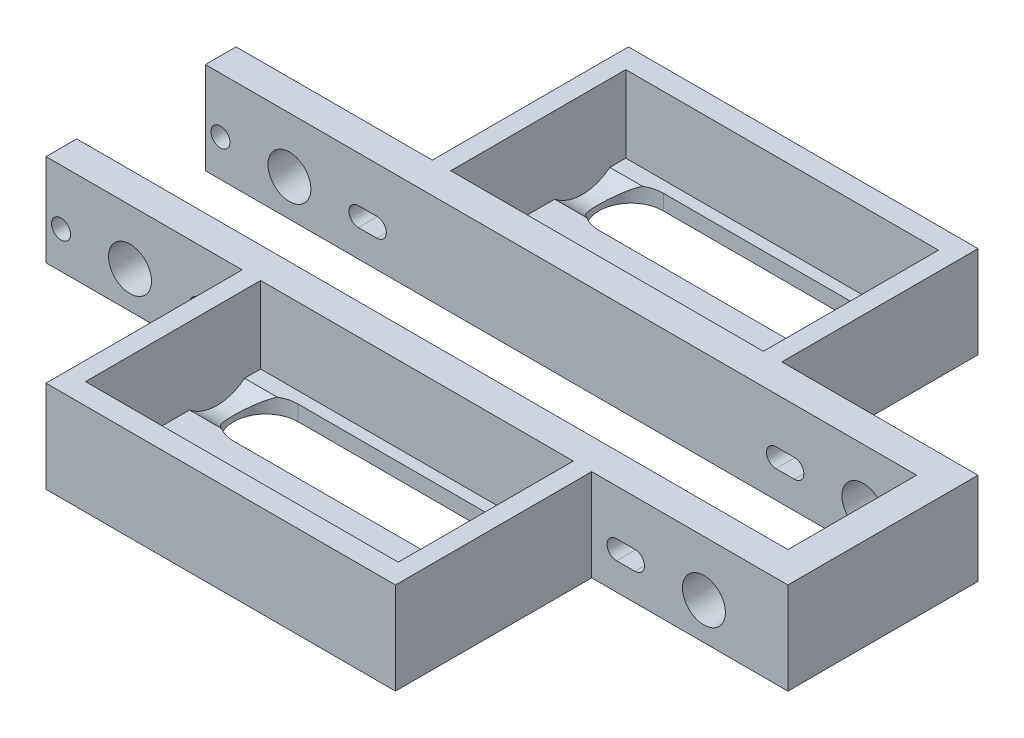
ISO-10303-21;
HEADER;
FILE_DESCRIPTION(('STEP AP214'),'2;1');
FILE_NAME('part.step','',(''),(''),'','','');
FILE_SCHEMA(('AUTOMOTIVE_DESIGN { 1 0 10303 214 1 1 1 1 }'));
ENDSEC;
DATA;
#1=APPLICATION_CONTEXT('core data for automotive mechanical design processes');
#2=APPLICATION_PROTOCOL_DEFINITION('international standard','automotive_design',2000,#1);
#3=PRODUCT_CONTEXT('',#1,'mechanical');
#4=PRODUCT('Part','Part','',(#3));
#5=PRODUCT_RELATED_PRODUCT_CATEGORY('part','',(#4));
#6=PRODUCT_DEFINITION_FORMATION('','',#4);
#7=PRODUCT_DEFINITION_CONTEXT('part definition',#1,'design');
#8=PRODUCT_DEFINITION('design','',#6,#7);
#9=PRODUCT_DEFINITION_SHAPE('','',#8);
#10=(LENGTH_UNIT() NAMED_UNIT(*) SI_UNIT(.MILLI.,.METRE.));
#11=(NAMED_UNIT(*) PLANE_ANGLE_UNIT() SI_UNIT($,.RADIAN.));
#12=(NAMED_UNIT(*) SI_UNIT($,.STERADIAN.) SOLID_ANGLE_UNIT());
#13=UNCERTAINTY_MEASURE_WITH_UNIT(LENGTH_MEASURE(1.E-05),#10,'distance_accuracy_value','');
#14=(GEOMETRIC_REPRESENTATION_CONTEXT(3) GLOBAL_UNCERTAINTY_ASSIGNED_CONTEXT((#13)) GLOBAL_UNIT_ASSIGNED_CONTEXT((#10,
#11,#12)) REPRESENTATION_CONTEXT('',''));
#15=CARTESIAN_POINT('',(0.,0.,0.));
#16=DIRECTION('',(0.,0.,1.));
#17=DIRECTION('',(1.,0.,0.));
#18=AXIS2_PLACEMENT_3D('',#15,#16,#17);
#19=CARTESIAN_POINT('',(78.,2.5,-84.42));
#20=DIRECTION('',(0.,-1.,0.));
#21=DIRECTION('',(0.,0.,-1.));
#22=AXIS2_PLACEMENT_3D('',#19,#20,#21);
#23=CYLINDRICAL_SURFACE('',#22,5.25);
#24=CARTESIAN_POINT('',(78.,2.5,-84.42));
#25=DIRECTION('',(0.,1.,0.));
#26=DIRECTION('',(0.,0.,1.));
#27=AXIS2_PLACEMENT_3D('',#24,#25,#26);
#28=CIRCLE('',#27,5.25);
#29=CARTESIAN_POINT('',(78.,2.5,-79.17));
#30=VERTEX_POINT('',#29);
#31=CARTESIAN_POINT('',(80.7856954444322,2.5,-79.9700111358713));
#32=VERTEX_POINT('',#31);
#33=EDGE_CURVE('E539',#30,#32,#28,.T.);
#34=ORIENTED_EDGE('',*,*,#33,.T.);
#35=CARTESIAN_POINT('',(80.7856954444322,2.5,-79.9700111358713));
#36=CARTESIAN_POINT('',(80.9173065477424,2.43268334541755,-80.0524389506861));
#37=CARTESIAN_POINT('',(81.0447908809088,2.36404051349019,-80.140335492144));
#38=CARTESIAN_POINT('',(81.2912709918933,2.22589258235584,-80.326832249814));
#39=CARTESIAN_POINT('',(81.4102634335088,2.15638715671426,-80.4254366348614));
#40=CARTESIAN_POINT('',(81.6407081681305,2.01758455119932,-80.6342162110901));
#41=CARTESIAN_POINT('',(81.7520607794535,1.94829847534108,-80.7445089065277));
#42=CARTESIAN_POINT('',(81.9651856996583,1.8124083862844,-80.9755116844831));
#43=CARTESIAN_POINT('',(82.0669588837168,1.74580412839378,-81.09622081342));
#44=CARTESIAN_POINT('',(82.2605972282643,1.61661230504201,-81.3483269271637));
#45=CARTESIAN_POINT('',(82.3524186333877,1.5540429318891,-81.4797669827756));
#46=CARTESIAN_POINT('',(82.5246669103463,1.43484640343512,-81.7524391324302));
#47=CARTESIAN_POINT('',(82.6050961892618,1.37821799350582,-81.8936691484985));
#48=CARTESIAN_POINT('',(82.7530763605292,1.27273306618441,-82.1845447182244));
#49=CARTESIAN_POINT('',(82.8206881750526,1.22383997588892,-82.3341458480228));
#50=CARTESIAN_POINT('',(82.9422719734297,1.13502129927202,-82.6413219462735));
#51=CARTESIAN_POINT('',(82.9962503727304,1.09509149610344,-82.7988931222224));
#52=CARTESIAN_POINT('',(83.0759255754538,1.03560752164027,-83.0740205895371));
#53=CARTESIAN_POINT('',(83.105287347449,1.01349984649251,-83.1899792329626));
#54=CARTESIAN_POINT('',(83.1561519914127,0.974910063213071,-83.4245179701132));
#55=CARTESIAN_POINT('',(83.1776565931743,0.958426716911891,-83.5430974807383));
#56=CARTESIAN_POINT('',(83.2125059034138,0.931409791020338,-83.7821341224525));
#57=CARTESIAN_POINT('',(83.2258498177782,0.92087679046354,-83.9025914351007));
#58=CARTESIAN_POINT('',(83.2441712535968,0.905976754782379,-84.1445285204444));
#59=CARTESIAN_POINT('',(83.249148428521,0.901609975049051,-84.2660083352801));
#60=CARTESIAN_POINT('',(83.2506514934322,0.8991285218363,-84.5091718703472));
#61=CARTESIAN_POINT('',(83.2471713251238,0.901018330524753,-84.630855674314));
#62=CARTESIAN_POINT('',(83.2317917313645,0.911009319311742,-84.8734735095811));
#63=CARTESIAN_POINT('',(83.2198892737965,0.919112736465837,-84.9944072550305));
#64=CARTESIAN_POINT('',(83.1878341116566,0.941348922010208,-85.2345830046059));
#65=CARTESIAN_POINT('',(83.1676836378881,0.955480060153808,-85.3538254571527));
#66=CARTESIAN_POINT('',(83.1194175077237,0.989462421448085,-85.5898736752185));
#67=CARTESIAN_POINT('',(83.0912987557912,1.00931586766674,-85.7066784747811));
#68=CARTESIAN_POINT('',(82.9958933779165,1.07661492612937,-86.0509169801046));
#69=CARTESIAN_POINT('',(82.9173321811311,1.13195928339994,-86.2738147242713));
#70=CARTESIAN_POINT('',(82.7334824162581,1.25981950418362,-86.7028237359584));
#71=CARTESIAN_POINT('',(82.6281822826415,1.33234279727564,-86.9089276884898));
#72=CARTESIAN_POINT('',(82.3786517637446,1.50065130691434,-87.3280953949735));
#73=CARTESIAN_POINT('',(82.2311095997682,1.59824629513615,-87.5384533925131));
#74=CARTESIAN_POINT('',(81.90994385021,1.80328758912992,-87.9327794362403));
#75=CARTESIAN_POINT('',(81.7363071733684,1.91073882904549,-88.1167341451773));
#76=CARTESIAN_POINT('',(81.4136996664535,2.10030713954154,-88.412977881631));
#77=CARTESIAN_POINT('',(81.270001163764,2.18177175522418,-88.5314837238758));
#78=CARTESIAN_POINT('',(81.0454618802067,2.30272214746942,-88.6974166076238));
#79=CARTESIAN_POINT('',(80.9692138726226,2.34278379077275,-88.7506996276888));
#80=CARTESIAN_POINT('',(80.8136840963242,2.42210372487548,-88.8533229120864));
#81=CARTESIAN_POINT('',(80.7344017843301,2.46136186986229,-88.9026624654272));
#82=CARTESIAN_POINT('',(80.6536203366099,2.50000000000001,-88.9499888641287));
#83=B_SPLINE_CURVE_WITH_KNOTS('',3,(#35,#36,#37,#38,#39,#40,#41,#42,#43,#44,#45,#46,#47,#48,#49,
#50,#51,#52,#53,#54,#55,#56,#57,#58,#59,#60,#61,#62,#63,#64,#65,#66,#67,#68,#69,#70,#71,#72,#73,
#74,#75,#76,#77,#78,#79,#80,#81,#82),.UNSPECIFIED.,.F.,.F.,(4,2,2,2,2,2,2,2,2,2,2,2,2,2,2,2,2,2,
2,2,2,2,2,4),(0.,0.507598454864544,1.01539524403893,1.52889455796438,2.04234691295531,
2.55797228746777,3.07348855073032,3.58648947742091,4.09924855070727,4.46380571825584,
4.82828257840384,5.19279490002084,5.55732231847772,5.92211093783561,6.28703095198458,
6.65185233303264,7.0168156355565,7.74181225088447,8.46712298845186,9.28868212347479,
10.1106548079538,10.7195722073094,11.023301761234,11.3270859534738),.UNSPECIFIED.);
#84=CARTESIAN_POINT('',(80.6536203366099,2.5,-88.9499888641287));
#85=VERTEX_POINT('',#84);
#86=EDGE_CURVE('E668',#32,#85,#83,.T.);
#87=ORIENTED_EDGE('',*,*,#86,.T.);
#88=CARTESIAN_POINT('',(78.,2.5,-89.67));
#89=VERTEX_POINT('',#88);
#90=EDGE_CURVE('E510',#85,#89,#28,.T.);
#91=ORIENTED_EDGE('',*,*,#90,.T.);
#92=DIRECTION('',(0.,-1.,0.));
#93=VECTOR('',#92,1.);
#94=CARTESIAN_POINT('',(78.,2.5,-89.67));
#95=LINE('',#94,#93);
#96=CARTESIAN_POINT('',(78.,0.,-89.67));
#97=VERTEX_POINT('',#96);
#98=EDGE_CURVE('E850',#89,#97,#95,.T.);
#99=ORIENTED_EDGE('',*,*,#98,.T.);
#100=CARTESIAN_POINT('',(78.,0.,-84.42));
#101=DIRECTION('',(0.,1.,0.));
#102=DIRECTION('',(0.,0.,1.));
#103=AXIS2_PLACEMENT_3D('',#100,#101,#102);
#104=CIRCLE('',#103,5.25);
#105=CARTESIAN_POINT('',(78.,0.,-79.17));
#106=VERTEX_POINT('',#105);
#107=EDGE_CURVE('E555',#106,#97,#104,.T.);
#108=ORIENTED_EDGE('',*,*,#107,.F.);
#109=DIRECTION('',(0.,-1.,0.));
#110=VECTOR('',#109,1.);
#111=CARTESIAN_POINT('',(78.,2.5,-79.17));
#112=LINE('',#111,#110);
#113=EDGE_CURVE('E836',#30,#106,#112,.T.);
#114=ORIENTED_EDGE('',*,*,#113,.F.);
#115=EDGE_LOOP('',(#34,#87,#91,#99,#108,#114));
#116=FACE_BOUND('',#115,.T.);
#117=ADVANCED_FACE('F43',(#116),#23,.F.);
#118=CARTESIAN_POINT('',(43.,2.5,-84.42));
#119=DIRECTION('',(0.,-1.,0.));
#120=DIRECTION('',(0.,0.,-1.));
#121=AXIS2_PLACEMENT_3D('',#118,#119,#120);
#122=CYLINDRICAL_SURFACE('',#121,5.25);
#123=CARTESIAN_POINT('',(43.,2.5,-84.42));
#124=DIRECTION('',(0.,1.,0.));
#125=DIRECTION('',(0.,0.,1.));
#126=AXIS2_PLACEMENT_3D('',#123,#124,#125);
#127=CIRCLE('',#126,5.25);
#128=CARTESIAN_POINT('',(43.,2.5,-89.67));
#129=VERTEX_POINT('',#128);
#130=CARTESIAN_POINT('',(40.3463796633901,2.5,-88.9499888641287));
#131=VERTEX_POINT('',#130);
#132=EDGE_CURVE('E528',#129,#131,#127,.T.);
#133=ORIENTED_EDGE('',*,*,#132,.T.);
#134=CARTESIAN_POINT('',(40.3463796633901,2.5,-88.9499888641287));
#135=CARTESIAN_POINT('',(40.2115856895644,2.43548150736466,-88.8709892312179));
#136=CARTESIAN_POINT('',(40.0809129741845,2.36928478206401,-88.7863970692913));
#137=CARTESIAN_POINT('',(39.82804050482,2.23541425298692,-88.6063307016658));
#138=CARTESIAN_POINT('',(39.7058427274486,2.16774010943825,-88.5108539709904));
#139=CARTESIAN_POINT('',(39.4689887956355,2.0321246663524,-88.3083112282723));
#140=CARTESIAN_POINT('',(39.3544242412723,1.96418790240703,-88.201135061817));
#141=CARTESIAN_POINT('',(39.1347415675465,1.83047664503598,-87.9762602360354));
#142=CARTESIAN_POINT('',(39.0296229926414,1.76470204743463,-87.8585620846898));
#143=CARTESIAN_POINT('',(38.8291773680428,1.63673850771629,-87.6124912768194));
#144=CARTESIAN_POINT('',(38.7338846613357,1.57456245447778,-87.48408384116));
#145=CARTESIAN_POINT('',(38.5544253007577,1.45566602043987,-87.2173542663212));
#146=CARTESIAN_POINT('',(38.4702564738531,1.39894457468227,-87.0790340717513));
#147=CARTESIAN_POINT('',(38.3144672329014,1.29278135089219,-86.7937269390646));
#148=CARTESIAN_POINT('',(38.2427918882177,1.24330786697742,-86.646781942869));
#149=CARTESIAN_POINT('',(38.1127405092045,1.15288451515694,-86.3446328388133));
#150=CARTESIAN_POINT('',(38.054358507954,1.11193082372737,-86.1894324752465));
#151=CARTESIAN_POINT('',(37.9665645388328,1.05014620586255,-85.9171010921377));
#152=CARTESIAN_POINT('',(37.9336308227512,1.02690123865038,-85.8016386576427));
#153=CARTESIAN_POINT('',(37.8755939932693,0.985954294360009,-85.5678081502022));
#154=CARTESIAN_POINT('',(37.8504891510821,0.968251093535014,-85.4494407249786));
#155=CARTESIAN_POINT('',(37.8084427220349,0.938754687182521,-85.2105345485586));
#156=CARTESIAN_POINT('',(37.7915011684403,0.926961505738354,-85.0899957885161));
#157=CARTESIAN_POINT('',(37.7660219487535,0.909545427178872,-84.8475817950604));
#158=CARTESIAN_POINT('',(37.7574846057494,0.903922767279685,-84.7257065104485));
#159=CARTESIAN_POINT('',(37.7489340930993,0.898979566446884,-84.4813786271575));
#160=CARTESIAN_POINT('',(37.7489313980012,0.899666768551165,-84.3589255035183));
#161=CARTESIAN_POINT('',(37.757470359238,0.907357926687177,-84.1144740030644));
#162=CARTESIAN_POINT('',(37.7660151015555,0.91436416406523,-83.9924758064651));
#163=CARTESIAN_POINT('',(37.7915113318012,0.934549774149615,-83.7499150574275));
#164=CARTESIAN_POINT('',(37.8084605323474,0.947727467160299,-83.6293521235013));
#165=CARTESIAN_POINT('',(37.8505159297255,0.979990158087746,-83.3904192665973));
#166=CARTESIAN_POINT('',(37.8756252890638,0.999077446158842,-83.2720502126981));
#167=CARTESIAN_POINT('',(37.9331816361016,1.04242786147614,-83.0401864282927));
#168=CARTESIAN_POINT('',(37.9655029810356,1.06660200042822,-82.9266437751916));
#169=CARTESIAN_POINT('',(38.0373119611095,1.11986642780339,-82.7030149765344));
#170=CARTESIAN_POINT('',(38.0768021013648,1.14895843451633,-82.5929300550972));
#171=CARTESIAN_POINT('',(38.2053936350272,1.24288642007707,-82.2686635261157));
#172=CARTESIAN_POINT('',(38.3046493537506,1.31439974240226,-82.0603388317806));
#173=CARTESIAN_POINT('',(38.5405807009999,1.48065498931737,-81.6375779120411));
#174=CARTESIAN_POINT('',(38.6803779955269,1.57718098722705,-81.4256148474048));
#175=CARTESIAN_POINT('',(38.9858635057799,1.78109635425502,-81.0270172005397));
#176=CARTESIAN_POINT('',(39.1515686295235,1.88849280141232,-80.8403993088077));
#177=CARTESIAN_POINT('',(39.4636682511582,2.08142474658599,-80.5350990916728));
#178=CARTESIAN_POINT('',(39.6052196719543,2.16605382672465,-80.4108375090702));
#179=CARTESIAN_POINT('',(39.8268279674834,2.29241091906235,-80.2364273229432));
#180=CARTESIAN_POINT('',(39.9021376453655,2.33437660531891,-80.1803544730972));
#181=CARTESIAN_POINT('',(40.0558840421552,2.41772989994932,-80.072183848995));
#182=CARTESIAN_POINT('',(40.134321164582,2.45911743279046,-80.0200865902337));
#183=CARTESIAN_POINT('',(40.2143045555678,2.5,-79.9700111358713));
#184=B_SPLINE_CURVE_WITH_KNOTS('',3,(#134,#135,#136,#137,#138,#139,#140,#141,#142,#143,#144,
#145,#146,#147,#148,#149,#150,#151,#152,#153,#154,#155,#156,#157,#158,#159,#160,#161,#162,#163,
#164,#165,#166,#167,#168,#169,#170,#171,#172,#173,#174,#175,#176,#177,#178,#179,#180,#181,#182,
#183),.UNSPECIFIED.,.F.,.F.,(4,2,2,2,2,2,2,2,2,2,2,2,2,2,2,2,2,2,2,2,2,2,2,2,4),(0.,
0.506911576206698,1.01394098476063,1.52624099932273,2.03851629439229,2.55252535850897,
3.06643386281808,3.57802249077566,4.0893810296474,4.45589814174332,4.82233426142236,
5.18877187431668,5.55522357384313,5.92212501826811,6.28915897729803,6.65609309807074,
7.02316959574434,7.38429119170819,7.74553922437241,8.46762614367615,9.2796911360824,
10.0922883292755,10.7107687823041,11.019187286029,11.3276457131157),.UNSPECIFIED.);
#185=CARTESIAN_POINT('',(40.2143045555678,2.5,-79.9700111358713));
#186=VERTEX_POINT('',#185);
#187=EDGE_CURVE('E762',#131,#186,#184,.T.);
#188=ORIENTED_EDGE('',*,*,#187,.T.);
#189=CARTESIAN_POINT('',(43.,2.5,-79.17));
#190=VERTEX_POINT('',#189);
#191=EDGE_CURVE('E533',#186,#190,#127,.T.);
#192=ORIENTED_EDGE('',*,*,#191,.T.);
#193=DIRECTION('',(0.,-1.,0.));
#194=VECTOR('',#193,1.);
#195=CARTESIAN_POINT('',(43.,2.5,-79.17));
#196=LINE('',#195,#194);
#197=CARTESIAN_POINT('',(43.,0.,-79.17));
#198=VERTEX_POINT('',#197);
#199=EDGE_CURVE('E841',#190,#198,#196,.T.);
#200=ORIENTED_EDGE('',*,*,#199,.T.);
#201=CARTESIAN_POINT('',(43.,0.,-84.42));
#202=DIRECTION('',(0.,1.,0.));
#203=DIRECTION('',(0.,0.,1.));
#204=AXIS2_PLACEMENT_3D('',#201,#202,#203);
#205=CIRCLE('',#204,5.25);
#206=CARTESIAN_POINT('',(43.,0.,-89.67));
#207=VERTEX_POINT('',#206);
#208=EDGE_CURVE('E1101',#207,#198,#205,.T.);
#209=ORIENTED_EDGE('',*,*,#208,.F.);
#210=DIRECTION('',(0.,-1.,0.));
#211=VECTOR('',#210,1.);
#212=CARTESIAN_POINT('',(43.,2.5,-89.67));
#213=LINE('',#212,#211);
#214=EDGE_CURVE('E846',#129,#207,#213,.T.);
#215=ORIENTED_EDGE('',*,*,#214,.F.);
#216=EDGE_LOOP('',(#133,#188,#192,#200,#209,#215));
#217=FACE_BOUND('',#216,.T.);
#218=ADVANCED_FACE('F817',(#217),#122,.F.);
#219=CARTESIAN_POINT('',(0.,2.5,0.));
#220=DIRECTION('',(0.,1.,0.));
#221=DIRECTION('',(0.,0.,1.));
#222=AXIS2_PLACEMENT_3D('',#219,#220,#221);
#223=PLANE('',#222);
#224=DIRECTION('',(0.,0.,1.));
#225=VECTOR('',#224,1.);
#226=CARTESIAN_POINT('',(86.,2.5,0.));
#227=LINE('',#226,#225);
#228=CARTESIAN_POINT('',(86.,2.5,-79.9700111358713));
#229=VERTEX_POINT('',#228);
#230=CARTESIAN_POINT('',(86.,2.5,-74.5899888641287));
#231=VERTEX_POINT('',#230);
#232=EDGE_CURVE('E517',#229,#231,#227,.T.);
#233=ORIENTED_EDGE('',*,*,#232,.F.);
#234=DIRECTION('',(1.,0.,0.));
#235=VECTOR('',#234,1.);
#236=CARTESIAN_POINT('',(25.8785965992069,2.5,-79.9700111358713));
#237=LINE('',#236,#235);
#238=EDGE_CURVE('E11',#229,#32,#237,.F.);
#239=ORIENTED_EDGE('',*,*,#238,.T.);
#240=ORIENTED_EDGE('',*,*,#33,.F.);
#241=DIRECTION('',(1.,0.,0.));
#242=VECTOR('',#241,1.);
#243=CARTESIAN_POINT('',(0.,2.5,-79.17));
#244=LINE('',#243,#242);
#245=EDGE_CURVE('E536',#190,#30,#244,.T.);
#246=ORIENTED_EDGE('',*,*,#245,.F.);
#247=ORIENTED_EDGE('',*,*,#191,.F.);
#248=DIRECTION('',(1.,0.,0.));
#249=VECTOR('',#248,1.);
#250=CARTESIAN_POINT('',(25.8785965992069,2.5,-79.9700111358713));
#251=LINE('',#250,#249);
#252=CARTESIAN_POINT('',(35.,2.5,-79.9700111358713));
#253=VERTEX_POINT('',#252);
#254=EDGE_CURVE('E1129',#253,#186,#251,.T.);
#255=ORIENTED_EDGE('',*,*,#254,.F.);
#256=DIRECTION('',(0.,0.,1.));
#257=VECTOR('',#256,1.);
#258=CARTESIAN_POINT('',(35.,2.5,0.));
#259=LINE('',#258,#257);
#260=CARTESIAN_POINT('',(35.,2.5,-74.5899888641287));
#261=VERTEX_POINT('',#260);
#262=EDGE_CURVE('E1085',#253,#261,#259,.T.);
#263=ORIENTED_EDGE('',*,*,#262,.T.);
#264=DIRECTION('',(1.,0.,0.));
#265=VECTOR('',#264,1.);
#266=CARTESIAN_POINT('',(25.8785965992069,2.5,-74.5899888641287));
#267=LINE('',#266,#265);
#268=CARTESIAN_POINT('',(40.2143045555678,2.5,-74.5899888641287));
#269=VERTEX_POINT('',#268);
#270=EDGE_CURVE('E1131',#261,#269,#267,.T.);
#271=ORIENTED_EDGE('',*,*,#270,.T.);
#272=CARTESIAN_POINT('',(43.,2.5,-70.14));
#273=DIRECTION('',(0.,1.,0.));
#274=DIRECTION('',(0.,0.,1.));
#275=AXIS2_PLACEMENT_3D('',#272,#273,#274);
#276=CIRCLE('',#275,5.25);
#277=CARTESIAN_POINT('',(43.,2.5,-75.39));
#278=VERTEX_POINT('',#277);
#279=EDGE_CURVE('E1094',#269,#278,#276,.F.);
#280=ORIENTED_EDGE('',*,*,#279,.T.);
#281=DIRECTION('',(1.,0.,0.));
#282=VECTOR('',#281,1.);
#283=CARTESIAN_POINT('',(0.,2.5,-75.39));
#284=LINE('',#283,#282);
#285=CARTESIAN_POINT('',(78.,2.5,-75.39));
#286=VERTEX_POINT('',#285);
#287=EDGE_CURVE('E1079',#278,#286,#284,.T.);
#288=ORIENTED_EDGE('',*,*,#287,.T.);
#289=CARTESIAN_POINT('',(78.,2.5,-70.14));
#290=DIRECTION('',(0.,1.,0.));
#291=DIRECTION('',(0.,0.,1.));
#292=AXIS2_PLACEMENT_3D('',#289,#290,#291);
#293=CIRCLE('',#292,5.25);
#294=CARTESIAN_POINT('',(80.7856954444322,2.5,-74.5899888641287));
#295=VERTEX_POINT('',#294);
#296=EDGE_CURVE('E1088',#286,#295,#293,.F.);
#297=ORIENTED_EDGE('',*,*,#296,.T.);
#298=DIRECTION('',(1.,0.,0.));
#299=VECTOR('',#298,1.);
#300=CARTESIAN_POINT('',(25.8785965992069,2.5,-74.5899888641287));
#301=LINE('',#300,#299);
#302=EDGE_CURVE('E1062',#231,#295,#301,.F.);
#303=ORIENTED_EDGE('',*,*,#302,.F.);
#304=EDGE_LOOP('',(#233,#239,#240,#246,#247,#255,#263,#271,#280,#288,#297,#303));
#305=FACE_BOUND('',#304,.T.);
#306=ADVANCED_FACE('F820',(#305),#223,.T.);
#307=CARTESIAN_POINT('',(35.,2.5,-91.56));
#308=VERTEX_POINT('',#307);
#309=CARTESIAN_POINT('',(35.,2.5,-88.9499888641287));
#310=VERTEX_POINT('',#309);
#311=EDGE_CURVE('E1080',#308,#310,#259,.T.);
#312=ORIENTED_EDGE('',*,*,#311,.T.);
#313=DIRECTION('',(1.,0.,0.));
#314=VECTOR('',#313,1.);
#315=CARTESIAN_POINT('',(25.8785965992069,2.5,-88.9499888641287));
#316=LINE('',#315,#314);
#317=EDGE_CURVE('E500',#310,#131,#316,.T.);
#318=ORIENTED_EDGE('',*,*,#317,.T.);
#319=ORIENTED_EDGE('',*,*,#132,.F.);
#320=DIRECTION('',(1.,0.,0.));
#321=VECTOR('',#320,1.);
#322=CARTESIAN_POINT('',(0.,2.5,-89.67));
#323=LINE('',#322,#321);
#324=EDGE_CURVE('E523',#129,#89,#323,.T.);
#325=ORIENTED_EDGE('',*,*,#324,.T.);
#326=ORIENTED_EDGE('',*,*,#90,.F.);
#327=DIRECTION('',(1.,0.,0.));
#328=VECTOR('',#327,1.);
#329=CARTESIAN_POINT('',(25.8785965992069,2.5,-88.9499888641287));
#330=LINE('',#329,#328);
#331=CARTESIAN_POINT('',(86.,2.5,-88.9499888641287));
#332=VERTEX_POINT('',#331);
#333=EDGE_CURVE('E51',#85,#332,#330,.T.);
#334=ORIENTED_EDGE('',*,*,#333,.T.);
#335=CARTESIAN_POINT('',(86.,2.5,-91.56));
#336=VERTEX_POINT('',#335);
#337=EDGE_CURVE('E508',#336,#332,#227,.T.);
#338=ORIENTED_EDGE('',*,*,#337,.F.);
#339=DIRECTION('',(1.,0.,0.));
#340=VECTOR('',#339,1.);
#341=CARTESIAN_POINT('',(0.,2.5,-91.56));
#342=LINE('',#341,#340);
#343=EDGE_CURVE('E516',#308,#336,#342,.T.);
#344=ORIENTED_EDGE('',*,*,#343,.F.);
#345=EDGE_LOOP('',(#312,#318,#319,#325,#326,#334,#338,#344));
#346=FACE_BOUND('',#345,.T.);
#347=ADVANCED_FACE('F506',(#346),#223,.T.);
#348=DIRECTION('',(1.,0.,0.));
#349=VECTOR('',#348,1.);
#350=CARTESIAN_POINT('',(25.8785965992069,2.5,-65.6100111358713));
#351=LINE('',#350,#349);
#352=CARTESIAN_POINT('',(35.,2.5,-65.6100111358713));
#353=VERTEX_POINT('',#352);
#354=CARTESIAN_POINT('',(40.3463796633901,2.5,-65.6100111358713));
#355=VERTEX_POINT('',#354);
#356=EDGE_CURVE('E1069',#353,#355,#351,.T.);
#357=ORIENTED_EDGE('',*,*,#356,.F.);
#358=CARTESIAN_POINT('',(35.,2.5,-63.));
#359=VERTEX_POINT('',#358);
#360=EDGE_CURVE('E520',#353,#359,#259,.T.);
#361=ORIENTED_EDGE('',*,*,#360,.T.);
#362=DIRECTION('',(1.,0.,0.));
#363=VECTOR('',#362,1.);
#364=CARTESIAN_POINT('',(0.,2.5,-63.));
#365=LINE('',#364,#363);
#366=CARTESIAN_POINT('',(86.,2.5,-63.));
#367=VERTEX_POINT('',#366);
#368=EDGE_CURVE('E1076',#359,#367,#365,.T.);
#369=ORIENTED_EDGE('',*,*,#368,.T.);
#370=CARTESIAN_POINT('',(86.,2.5,-65.6100111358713));
#371=VERTEX_POINT('',#370);
#372=EDGE_CURVE('E519',#371,#367,#227,.T.);
#373=ORIENTED_EDGE('',*,*,#372,.F.);
#374=DIRECTION('',(1.,0.,0.));
#375=VECTOR('',#374,1.);
#376=CARTESIAN_POINT('',(25.8785965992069,2.5,-65.6100111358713));
#377=LINE('',#376,#375);
#378=CARTESIAN_POINT('',(80.6536203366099,2.5,-65.6100111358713));
#379=VERTEX_POINT('',#378);
#380=EDGE_CURVE('E511',#379,#371,#377,.T.);
#381=ORIENTED_EDGE('',*,*,#380,.F.);
#382=CARTESIAN_POINT('',(78.,2.5,-64.89));
#383=VERTEX_POINT('',#382);
#384=EDGE_CURVE('E1083',#379,#383,#293,.F.);
#385=ORIENTED_EDGE('',*,*,#384,.T.);
#386=DIRECTION('',(1.,0.,0.));
#387=VECTOR('',#386,1.);
#388=CARTESIAN_POINT('',(0.,2.5,-64.89));
#389=LINE('',#388,#387);
#390=CARTESIAN_POINT('',(43.,2.5,-64.89));
#391=VERTEX_POINT('',#390);
#392=EDGE_CURVE('E1091',#391,#383,#389,.T.);
#393=ORIENTED_EDGE('',*,*,#392,.F.);
#394=EDGE_CURVE('E1095',#391,#355,#276,.F.);
#395=ORIENTED_EDGE('',*,*,#394,.T.);
#396=EDGE_LOOP('',(#357,#361,#369,#373,#381,#385,#393,#395));
#397=FACE_BOUND('',#396,.T.);
#398=ADVANCED_FACE('F1074',(#397),#223,.T.);
#399=CARTESIAN_POINT('',(78.,2.5,-24.86));
#400=DIRECTION('',(0.,-1.,0.));
#401=DIRECTION('',(0.,0.,-1.));
#402=AXIS2_PLACEMENT_3D('',#399,#400,#401);
#403=CYLINDRICAL_SURFACE('',#402,5.25);
#404=CARTESIAN_POINT('',(78.,2.5,-24.86));
#405=DIRECTION('',(0.,1.,0.));
#406=DIRECTION('',(0.,0.,1.));
#407=AXIS2_PLACEMENT_3D('',#404,#405,#406);
#408=CIRCLE('',#407,5.25);
#409=CARTESIAN_POINT('',(78.,2.5,-19.61));
#410=VERTEX_POINT('',#409);
#411=CARTESIAN_POINT('',(80.7856954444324,2.5,-20.4100111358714));
#412=VERTEX_POINT('',#411);
#413=EDGE_CURVE('E626',#410,#412,#408,.T.);
#414=ORIENTED_EDGE('',*,*,#413,.T.);
#415=CARTESIAN_POINT('',(80.7856954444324,2.5,-20.4100111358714));
#416=CARTESIAN_POINT('',(80.9173065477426,2.43268334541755,-20.4924389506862));
#417=CARTESIAN_POINT('',(81.0447908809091,2.36404051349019,-20.5803354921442));
#418=CARTESIAN_POINT('',(81.2912709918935,2.22589258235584,-20.7668322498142));
#419=CARTESIAN_POINT('',(81.410263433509,2.15638715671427,-20.8654366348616));
#420=CARTESIAN_POINT('',(81.6407081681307,2.01758455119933,-21.0742162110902));
#421=CARTESIAN_POINT('',(81.7520607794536,1.9482984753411,-21.1845089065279));
#422=CARTESIAN_POINT('',(81.9651856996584,1.81240838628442,-21.4155116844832));
#423=CARTESIAN_POINT('',(82.066958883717,1.74580412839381,-21.5362208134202));
#424=CARTESIAN_POINT('',(82.2605972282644,1.61661230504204,-21.7883269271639));
#425=CARTESIAN_POINT('',(82.3524186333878,1.55404293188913,-21.9197669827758));
#426=CARTESIAN_POINT('',(82.5246669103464,1.43484640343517,-22.1924391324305));
#427=CARTESIAN_POINT('',(82.6050961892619,1.37821799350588,-22.3336691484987));
#428=CARTESIAN_POINT('',(82.7530763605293,1.27273306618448,-22.6245447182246));
#429=CARTESIAN_POINT('',(82.8206881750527,1.22383997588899,-22.774145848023));
#430=CARTESIAN_POINT('',(82.9422719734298,1.1350212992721,-23.0813219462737));
#431=CARTESIAN_POINT('',(82.9962503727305,1.09509149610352,-23.2388931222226));
#432=CARTESIAN_POINT('',(83.0759255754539,1.03560752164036,-23.5140205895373));
#433=CARTESIAN_POINT('',(83.105287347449,1.01349984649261,-23.6299792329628));
#434=CARTESIAN_POINT('',(83.1561519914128,0.974910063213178,-23.8645179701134));
#435=CARTESIAN_POINT('',(83.1776565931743,0.958426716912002,-23.9830974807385));
#436=CARTESIAN_POINT('',(83.2125059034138,0.931409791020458,-24.2221341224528));
#437=CARTESIAN_POINT('',(83.2258498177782,0.920876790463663,-24.3425914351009));
#438=CARTESIAN_POINT('',(83.2441712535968,0.905976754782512,-24.5845285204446));
#439=CARTESIAN_POINT('',(83.249148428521,0.901609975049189,-24.7060083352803));
#440=CARTESIAN_POINT('',(83.2506514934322,0.899128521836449,-24.9491718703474));
#441=CARTESIAN_POINT('',(83.2471713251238,0.901018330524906,-25.0708556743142));
#442=CARTESIAN_POINT('',(83.2317917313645,0.911009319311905,-25.3134735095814));
#443=CARTESIAN_POINT('',(83.2198892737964,0.919112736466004,-25.4344072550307));
#444=CARTESIAN_POINT('',(83.1878341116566,0.941348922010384,-25.6745830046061));
#445=CARTESIAN_POINT('',(83.1676836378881,0.955480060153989,-25.7938254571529));
#446=CARTESIAN_POINT('',(83.1194175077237,0.989462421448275,-26.0298736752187));
#447=CARTESIAN_POINT('',(83.0912987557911,1.00931586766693,-26.1466784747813));
#448=CARTESIAN_POINT('',(82.9958933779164,1.07661492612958,-26.4909169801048));
#449=CARTESIAN_POINT('',(82.917332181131,1.13195928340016,-26.7138147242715));
#450=CARTESIAN_POINT('',(82.733482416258,1.25981950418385,-27.1428237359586));
#451=CARTESIAN_POINT('',(82.6281822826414,1.33234279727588,-27.34892768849));
#452=CARTESIAN_POINT('',(82.3786517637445,1.50065130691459,-27.7680953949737));
#453=CARTESIAN_POINT('',(82.2311095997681,1.59824629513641,-27.9784533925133));
#454=CARTESIAN_POINT('',(81.9099438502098,1.80328758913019,-28.3727794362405));
#455=CARTESIAN_POINT('',(81.7363071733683,1.91073882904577,-28.5567341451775));
#456=CARTESIAN_POINT('',(81.4136996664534,2.10030713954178,-28.8529778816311));
#457=CARTESIAN_POINT('',(81.270001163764,2.18177175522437,-28.9714837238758));
#458=CARTESIAN_POINT('',(81.0454618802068,2.30272214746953,-29.1374166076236));
#459=CARTESIAN_POINT('',(80.9692138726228,2.34278379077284,-29.1906996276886));
#460=CARTESIAN_POINT('',(80.8136840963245,2.42210372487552,-29.2933229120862));
#461=CARTESIAN_POINT('',(80.7344017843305,2.46136186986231,-29.342662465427));
#462=CARTESIAN_POINT('',(80.6536203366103,2.5,-29.3899888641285));
#463=B_SPLINE_CURVE_WITH_KNOTS('',3,(#415,#416,#417,#418,#419,#420,#421,#422,#423,#424,#425,
#426,#427,#428,#429,#430,#431,#432,#433,#434,#435,#436,#437,#438,#439,#440,#441,#442,#443,#444,
#445,#446,#447,#448,#449,#450,#451,#452,#453,#454,#455,#456,#457,#458,#459,#460,#461,#462),
.UNSPECIFIED.,.F.,.F.,(4,2,2,2,2,2,2,2,2,2,2,2,2,2,2,2,2,2,2,2,2,2,2,4),(0.,0.507598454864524,
1.0153952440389,1.52889455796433,2.04234691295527,2.55797228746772,3.07348855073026,
3.58648947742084,4.09924855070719,4.46380571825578,4.82828257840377,5.19279490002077,
5.55732231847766,5.92211093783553,6.2870309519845,6.65185233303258,7.01681563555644,
7.74181225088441,8.4671229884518,9.28868212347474,10.1106548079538,10.719572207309,
11.0233017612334,11.327085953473),.UNSPECIFIED.);
#464=CARTESIAN_POINT('',(80.6536203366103,2.5,-29.3899888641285));
#465=VERTEX_POINT('',#464);
#466=EDGE_CURVE('E1289',#412,#465,#463,.T.);
#467=ORIENTED_EDGE('',*,*,#466,.T.);
#468=CARTESIAN_POINT('',(78.,2.5,-30.11));
#469=VERTEX_POINT('',#468);
#470=EDGE_CURVE('E564',#465,#469,#408,.T.);
#471=ORIENTED_EDGE('',*,*,#470,.T.);
#472=DIRECTION('',(0.,-1.,0.));
#473=VECTOR('',#472,1.);
#474=CARTESIAN_POINT('',(78.,2.5,-30.11));
#475=LINE('',#474,#473);
#476=CARTESIAN_POINT('',(78.,0.,-30.11));
#477=VERTEX_POINT('',#476);
#478=EDGE_CURVE('E549',#469,#477,#475,.T.);
#479=ORIENTED_EDGE('',*,*,#478,.T.);
#480=CARTESIAN_POINT('',(78.,0.,-24.86));
#481=DIRECTION('',(0.,1.,0.));
#482=DIRECTION('',(0.,0.,1.));
#483=AXIS2_PLACEMENT_3D('',#480,#481,#482);
#484=CIRCLE('',#483,5.25);
#485=CARTESIAN_POINT('',(78.,0.,-19.61));
#486=VERTEX_POINT('',#485);
#487=EDGE_CURVE('E583',#486,#477,#484,.T.);
#488=ORIENTED_EDGE('',*,*,#487,.F.);
#489=DIRECTION('',(0.,-1.,0.));
#490=VECTOR('',#489,1.);
#491=CARTESIAN_POINT('',(78.,2.5,-19.61));
#492=LINE('',#491,#490);
#493=EDGE_CURVE('E542',#410,#486,#492,.T.);
#494=ORIENTED_EDGE('',*,*,#493,.F.);
#495=EDGE_LOOP('',(#414,#467,#471,#479,#488,#494));
#496=FACE_BOUND('',#495,.T.);
#497=ADVANCED_FACE('F1245',(#496),#403,.F.);
#498=CARTESIAN_POINT('',(43.,2.5,-24.86));
#499=DIRECTION('',(0.,-1.,0.));
#500=DIRECTION('',(0.,0.,-1.));
#501=AXIS2_PLACEMENT_3D('',#498,#499,#500);
#502=CYLINDRICAL_SURFACE('',#501,5.25);
#503=CARTESIAN_POINT('',(43.,2.5,-24.86));
#504=DIRECTION('',(0.,1.,0.));
#505=DIRECTION('',(0.,0.,1.));
#506=AXIS2_PLACEMENT_3D('',#503,#504,#505);
#507=CIRCLE('',#506,5.25);
#508=CARTESIAN_POINT('',(43.,2.5,-30.11));
#509=VERTEX_POINT('',#508);
#510=CARTESIAN_POINT('',(40.3463796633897,2.5,-29.3899888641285));
#511=VERTEX_POINT('',#510);
#512=EDGE_CURVE('E619',#509,#511,#507,.T.);
#513=ORIENTED_EDGE('',*,*,#512,.T.);
#514=CARTESIAN_POINT('',(40.3463796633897,2.5,-29.3899888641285));
#515=CARTESIAN_POINT('',(40.211585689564,2.43548150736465,-29.3109892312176));
#516=CARTESIAN_POINT('',(40.0809129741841,2.369284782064,-29.2263970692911));
#517=CARTESIAN_POINT('',(39.8280405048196,2.2354142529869,-29.0463307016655));
#518=CARTESIAN_POINT('',(39.7058427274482,2.16774010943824,-28.9508539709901));
#519=CARTESIAN_POINT('',(39.4689887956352,2.03212466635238,-28.748311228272));
#520=CARTESIAN_POINT('',(39.354424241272,1.96418790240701,-28.6411350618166));
#521=CARTESIAN_POINT('',(39.1347415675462,1.83047664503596,-28.4162602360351));
#522=CARTESIAN_POINT('',(39.0296229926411,1.76470204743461,-28.2985620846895));
#523=CARTESIAN_POINT('',(38.8291773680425,1.63673850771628,-28.0524912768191));
#524=CARTESIAN_POINT('',(38.7338846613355,1.57456245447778,-27.9240838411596));
#525=CARTESIAN_POINT('',(38.5544253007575,1.45566602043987,-27.6573542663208));
#526=CARTESIAN_POINT('',(38.4702564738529,1.39894457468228,-27.5190340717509));
#527=CARTESIAN_POINT('',(38.3144672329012,1.29278135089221,-27.2337269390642));
#528=CARTESIAN_POINT('',(38.2427918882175,1.24330786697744,-27.0867819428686));
#529=CARTESIAN_POINT('',(38.1127405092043,1.15288451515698,-26.7846328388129));
#530=CARTESIAN_POINT('',(38.0543585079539,1.11193082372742,-26.6294324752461));
#531=CARTESIAN_POINT('',(37.9665645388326,1.05014620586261,-26.3571010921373));
#532=CARTESIAN_POINT('',(37.9336308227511,1.02690123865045,-26.2416386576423));
#533=CARTESIAN_POINT('',(37.8755939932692,0.98595429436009,-26.0078081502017));
#534=CARTESIAN_POINT('',(37.850489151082,0.968251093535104,-25.8894407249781));
#535=CARTESIAN_POINT('',(37.8084427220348,0.938754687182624,-25.6505345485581));
#536=CARTESIAN_POINT('',(37.7915011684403,0.926961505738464,-25.5299957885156));
#537=CARTESIAN_POINT('',(37.7660219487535,0.909545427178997,-25.28758179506));
#538=CARTESIAN_POINT('',(37.7574846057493,0.903922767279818,-25.1657065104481));
#539=CARTESIAN_POINT('',(37.7489340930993,0.898979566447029,-24.9213786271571));
#540=CARTESIAN_POINT('',(37.7489313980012,0.899666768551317,-24.7989255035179));
#541=CARTESIAN_POINT('',(37.757470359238,0.907357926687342,-24.554474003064));
#542=CARTESIAN_POINT('',(37.7660151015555,0.914364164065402,-24.4324758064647));
#543=CARTESIAN_POINT('',(37.7915113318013,0.9345497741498,-24.1899150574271));
#544=CARTESIAN_POINT('',(37.8084605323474,0.947727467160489,-24.0693521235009));
#545=CARTESIAN_POINT('',(37.8505159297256,0.979990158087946,-23.8304192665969));
#546=CARTESIAN_POINT('',(37.8756252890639,0.999077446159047,-23.7120502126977));
#547=CARTESIAN_POINT('',(37.9331816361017,1.04242786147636,-23.4801864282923));
#548=CARTESIAN_POINT('',(37.9655029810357,1.06660200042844,-23.3666437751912));
#549=CARTESIAN_POINT('',(38.0373119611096,1.11986642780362,-23.1430149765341));
#550=CARTESIAN_POINT('',(38.0768021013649,1.14895843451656,-23.0329300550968));
#551=CARTESIAN_POINT('',(38.2053936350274,1.24288642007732,-22.7086635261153));
#552=CARTESIAN_POINT('',(38.3046493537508,1.31439974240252,-22.5003388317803));
#553=CARTESIAN_POINT('',(38.5405807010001,1.48065498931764,-22.0775779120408));
#554=CARTESIAN_POINT('',(38.6803779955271,1.57718098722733,-21.8656148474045));
#555=CARTESIAN_POINT('',(38.9858635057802,1.78109635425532,-21.4670172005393));
#556=CARTESIAN_POINT('',(39.1515686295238,1.88849280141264,-21.2803993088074));
#557=CARTESIAN_POINT('',(39.4636682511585,2.08142474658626,-20.9750990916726));
#558=CARTESIAN_POINT('',(39.6052196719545,2.16605382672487,-20.8508375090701));
#559=CARTESIAN_POINT('',(39.8268279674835,2.29241091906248,-20.6764273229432));
#560=CARTESIAN_POINT('',(39.9021376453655,2.33437660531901,-20.6203544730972));
#561=CARTESIAN_POINT('',(40.0558840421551,2.41772989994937,-20.5121838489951));
#562=CARTESIAN_POINT('',(40.1343211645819,2.45911743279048,-20.4600865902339));
#563=CARTESIAN_POINT('',(40.2143045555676,2.5,-20.4100111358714));
#564=B_SPLINE_CURVE_WITH_KNOTS('',3,(#514,#515,#516,#517,#518,#519,#520,#521,#522,#523,#524,
#525,#526,#527,#528,#529,#530,#531,#532,#533,#534,#535,#536,#537,#538,#539,#540,#541,#542,#543,
#544,#545,#546,#547,#548,#549,#550,#551,#552,#553,#554,#555,#556,#557,#558,#559,#560,#561,#562,
#563),.UNSPECIFIED.,.F.,.F.,(4,2,2,2,2,2,2,2,2,2,2,2,2,2,2,2,2,2,2,2,2,2,2,2,4),(0.,
0.506911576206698,1.01394098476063,1.52624099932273,2.03851629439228,2.55252535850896,
3.06643386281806,3.57802249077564,4.08938102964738,4.45589814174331,4.82233426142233,
5.18877187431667,5.55522357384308,5.92212501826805,6.28915897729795,6.65609309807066,
7.02316959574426,7.38429119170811,7.74553922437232,8.46762614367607,9.27969113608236,
10.0922883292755,10.7107687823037,11.0191872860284,11.3276457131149),.UNSPECIFIED.);
#565=CARTESIAN_POINT('',(40.2143045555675,2.5,-20.4100111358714));
#566=VERTEX_POINT('',#565);
#567=EDGE_CURVE('E1287',#511,#566,#564,.T.);
#568=ORIENTED_EDGE('',*,*,#567,.T.);
#569=CARTESIAN_POINT('',(43.,2.5,-19.61));
#570=VERTEX_POINT('',#569);
#571=EDGE_CURVE('E622',#566,#570,#507,.T.);
#572=ORIENTED_EDGE('',*,*,#571,.T.);
#573=DIRECTION('',(0.,-1.,0.));
#574=VECTOR('',#573,1.);
#575=CARTESIAN_POINT('',(43.,2.5,-19.61));
#576=LINE('',#575,#574);
#577=CARTESIAN_POINT('',(43.,0.,-19.61));
#578=VERTEX_POINT('',#577);
#579=EDGE_CURVE('E545',#570,#578,#576,.T.);
#580=ORIENTED_EDGE('',*,*,#579,.T.);
#581=CARTESIAN_POINT('',(43.,0.,-24.86));
#582=DIRECTION('',(0.,1.,0.));
#583=DIRECTION('',(0.,0.,1.));
#584=AXIS2_PLACEMENT_3D('',#581,#582,#583);
#585=CIRCLE('',#584,5.25);
#586=CARTESIAN_POINT('',(43.,0.,-30.11));
#587=VERTEX_POINT('',#586);
#588=EDGE_CURVE('E577',#587,#578,#585,.T.);
#589=ORIENTED_EDGE('',*,*,#588,.F.);
#590=DIRECTION('',(0.,-1.,0.));
#591=VECTOR('',#590,1.);
#592=CARTESIAN_POINT('',(43.,2.5,-30.11));
#593=LINE('',#592,#591);
#594=EDGE_CURVE('E547',#509,#587,#593,.T.);
#595=ORIENTED_EDGE('',*,*,#594,.F.);
#596=EDGE_LOOP('',(#513,#568,#572,#580,#589,#595));
#597=FACE_BOUND('',#596,.T.);
#598=ADVANCED_FACE('F1237',(#597),#502,.F.);
#599=CARTESIAN_POINT('',(0.,2.5,0.));
#600=DIRECTION('',(0.,1.,0.));
#601=DIRECTION('',(0.,0.,1.));
#602=AXIS2_PLACEMENT_3D('',#599,#600,#601);
#603=PLANE('',#602);
#604=DIRECTION('',(0.,0.,-1.));
#605=VECTOR('',#604,1.);
#606=CARTESIAN_POINT('',(86.,2.5,0.));
#607=LINE('',#606,#605);
#608=CARTESIAN_POINT('',(86.,2.5,-15.0299888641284));
#609=VERTEX_POINT('',#608);
#610=CARTESIAN_POINT('',(86.,2.5,-20.4100111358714));
#611=VERTEX_POINT('',#610);
#612=EDGE_CURVE('E606',#609,#611,#607,.T.);
#613=ORIENTED_EDGE('',*,*,#612,.T.);
#614=DIRECTION('',(1.,0.,0.));
#615=VECTOR('',#614,1.);
#616=CARTESIAN_POINT('',(25.8785965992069,2.5,-20.4100111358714));
#617=LINE('',#616,#615);
#618=EDGE_CURVE('E1059',#611,#412,#617,.F.);
#619=ORIENTED_EDGE('',*,*,#618,.T.);
#620=ORIENTED_EDGE('',*,*,#413,.F.);
#621=DIRECTION('',(1.,0.,0.));
#622=VECTOR('',#621,1.);
#623=CARTESIAN_POINT('',(0.,2.5,-19.61));
#624=LINE('',#623,#622);
#625=EDGE_CURVE('E623',#570,#410,#624,.T.);
#626=ORIENTED_EDGE('',*,*,#625,.F.);
#627=ORIENTED_EDGE('',*,*,#571,.F.);
#628=DIRECTION('',(1.,0.,0.));
#629=VECTOR('',#628,1.);
#630=CARTESIAN_POINT('',(25.8785965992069,2.5,-20.4100111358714));
#631=LINE('',#630,#629);
#632=CARTESIAN_POINT('',(35.,2.5,-20.4100111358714));
#633=VERTEX_POINT('',#632);
#634=EDGE_CURVE('E1145',#633,#566,#631,.T.);
#635=ORIENTED_EDGE('',*,*,#634,.F.);
#636=DIRECTION('',(0.,0.,-1.));
#637=VECTOR('',#636,1.);
#638=CARTESIAN_POINT('',(35.,2.5,0.));
#639=LINE('',#638,#637);
#640=CARTESIAN_POINT('',(35.,2.5,-15.0299888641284));
#641=VERTEX_POINT('',#640);
#642=EDGE_CURVE('E614',#641,#633,#639,.T.);
#643=ORIENTED_EDGE('',*,*,#642,.F.);
#644=DIRECTION('',(1.,0.,0.));
#645=VECTOR('',#644,1.);
#646=CARTESIAN_POINT('',(25.8785965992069,2.5,-15.0299888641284));
#647=LINE('',#646,#645);
#648=CARTESIAN_POINT('',(40.2143045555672,2.5,-15.0299888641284));
#649=VERTEX_POINT('',#648);
#650=EDGE_CURVE('E1147',#641,#649,#647,.T.);
#651=ORIENTED_EDGE('',*,*,#650,.T.);
#652=CARTESIAN_POINT('',(43.,2.5,-10.58));
#653=DIRECTION('',(0.,1.,0.));
#654=DIRECTION('',(0.,0.,1.));
#655=AXIS2_PLACEMENT_3D('',#652,#653,#654);
#656=CIRCLE('',#655,5.25);
#657=CARTESIAN_POINT('',(43.,2.5,-15.83));
#658=VERTEX_POINT('',#657);
#659=EDGE_CURVE('E589',#649,#658,#656,.F.);
#660=ORIENTED_EDGE('',*,*,#659,.T.);
#661=DIRECTION('',(1.,0.,0.));
#662=VECTOR('',#661,1.);
#663=CARTESIAN_POINT('',(0.,2.5,-15.83));
#664=LINE('',#663,#662);
#665=CARTESIAN_POINT('',(78.,2.5,-15.83));
#666=VERTEX_POINT('',#665);
#667=EDGE_CURVE('E597',#658,#666,#664,.T.);
#668=ORIENTED_EDGE('',*,*,#667,.T.);
#669=CARTESIAN_POINT('',(78.,2.5,-10.58));
#670=DIRECTION('',(0.,1.,0.));
#671=DIRECTION('',(0.,0.,1.));
#672=AXIS2_PLACEMENT_3D('',#669,#670,#671);
#673=CIRCLE('',#672,5.25);
#674=CARTESIAN_POINT('',(80.7856954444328,2.5,-15.0299888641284));
#675=VERTEX_POINT('',#674);
#676=EDGE_CURVE('E593',#666,#675,#673,.F.);
#677=ORIENTED_EDGE('',*,*,#676,.T.);
#678=DIRECTION('',(1.,0.,0.));
#679=VECTOR('',#678,1.);
#680=CARTESIAN_POINT('',(25.8785965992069,2.5,-15.0299888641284));
#681=LINE('',#680,#679);
#682=EDGE_CURVE('E1048',#609,#675,#681,.F.);
#683=ORIENTED_EDGE('',*,*,#682,.F.);
#684=EDGE_LOOP('',(#613,#619,#620,#626,#627,#635,#643,#651,#660,#668,#677,#683));
#685=FACE_BOUND('',#684,.T.);
#686=ADVANCED_FACE('F1234',(#685),#603,.T.);
#687=CARTESIAN_POINT('',(35.,2.5,-29.3899888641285));
#688=VERTEX_POINT('',#687);
#689=CARTESIAN_POINT('',(35.,2.5,-32.));
#690=VERTEX_POINT('',#689);
#691=EDGE_CURVE('E615',#688,#690,#639,.T.);
#692=ORIENTED_EDGE('',*,*,#691,.F.);
#693=DIRECTION('',(1.,0.,0.));
#694=VECTOR('',#693,1.);
#695=CARTESIAN_POINT('',(25.8785965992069,2.5,-29.3899888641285));
#696=LINE('',#695,#694);
#697=EDGE_CURVE('E1141',#688,#511,#696,.T.);
#698=ORIENTED_EDGE('',*,*,#697,.T.);
#699=ORIENTED_EDGE('',*,*,#512,.F.);
#700=DIRECTION('',(1.,0.,0.));
#701=VECTOR('',#700,1.);
#702=CARTESIAN_POINT('',(0.,2.5,-30.11));
#703=LINE('',#702,#701);
#704=EDGE_CURVE('E616',#509,#469,#703,.T.);
#705=ORIENTED_EDGE('',*,*,#704,.T.);
#706=ORIENTED_EDGE('',*,*,#470,.F.);
#707=DIRECTION('',(1.,0.,0.));
#708=VECTOR('',#707,1.);
#709=CARTESIAN_POINT('',(25.8785965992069,2.5,-29.3899888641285));
#710=LINE('',#709,#708);
#711=CARTESIAN_POINT('',(86.,2.5,-29.3899888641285));
#712=VERTEX_POINT('',#711);
#713=EDGE_CURVE('E1056',#465,#712,#710,.T.);
#714=ORIENTED_EDGE('',*,*,#713,.T.);
#715=CARTESIAN_POINT('',(86.,2.5,-32.));
#716=VERTEX_POINT('',#715);
#717=EDGE_CURVE('E607',#712,#716,#607,.T.);
#718=ORIENTED_EDGE('',*,*,#717,.T.);
#719=DIRECTION('',(1.,0.,0.));
#720=VECTOR('',#719,1.);
#721=CARTESIAN_POINT('',(0.,2.5,-32.));
#722=LINE('',#721,#720);
#723=EDGE_CURVE('E600',#690,#716,#722,.T.);
#724=ORIENTED_EDGE('',*,*,#723,.F.);
#725=EDGE_LOOP('',(#692,#698,#699,#705,#706,#714,#718,#724));
#726=FACE_BOUND('',#725,.T.);
#727=ADVANCED_FACE('F1236',(#726),#603,.T.);
#728=DIRECTION('',(1.,0.,0.));
#729=VECTOR('',#728,1.);
#730=CARTESIAN_POINT('',(25.8785965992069,2.5,-6.05001113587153));
#731=LINE('',#730,#729);
#732=CARTESIAN_POINT('',(35.,2.5,-6.05001113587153));
#733=VERTEX_POINT('',#732);
#734=CARTESIAN_POINT('',(40.3463796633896,2.5,-6.05001113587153));
#735=VERTEX_POINT('',#734);
#736=EDGE_CURVE('E1150',#733,#735,#731,.T.);
#737=ORIENTED_EDGE('',*,*,#736,.F.);
#738=CARTESIAN_POINT('',(35.,2.5,-3.44));
#739=VERTEX_POINT('',#738);
#740=EDGE_CURVE('E611',#739,#733,#639,.T.);
#741=ORIENTED_EDGE('',*,*,#740,.F.);
#742=DIRECTION('',(1.,0.,0.));
#743=VECTOR('',#742,1.);
#744=CARTESIAN_POINT('',(0.,2.5,-3.44));
#745=LINE('',#744,#743);
#746=CARTESIAN_POINT('',(86.,2.5,-3.44));
#747=VERTEX_POINT('',#746);
#748=EDGE_CURVE('E608',#739,#747,#745,.T.);
#749=ORIENTED_EDGE('',*,*,#748,.T.);
#750=CARTESIAN_POINT('',(86.,2.5,-6.05001113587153));
#751=VERTEX_POINT('',#750);
#752=EDGE_CURVE('E603',#747,#751,#607,.T.);
#753=ORIENTED_EDGE('',*,*,#752,.T.);
#754=DIRECTION('',(1.,0.,0.));
#755=VECTOR('',#754,1.);
#756=CARTESIAN_POINT('',(25.8785965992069,2.5,-6.05001113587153));
#757=LINE('',#756,#755);
#758=CARTESIAN_POINT('',(80.6536203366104,2.5,-6.05001113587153));
#759=VERTEX_POINT('',#758);
#760=EDGE_CURVE('E1054',#759,#751,#757,.T.);
#761=ORIENTED_EDGE('',*,*,#760,.F.);
#762=CARTESIAN_POINT('',(78.,2.5,-5.33));
#763=VERTEX_POINT('',#762);
#764=EDGE_CURVE('E596',#759,#763,#673,.F.);
#765=ORIENTED_EDGE('',*,*,#764,.T.);
#766=DIRECTION('',(1.,0.,0.));
#767=VECTOR('',#766,1.);
#768=CARTESIAN_POINT('',(0.,2.5,-5.33));
#769=LINE('',#768,#767);
#770=CARTESIAN_POINT('',(43.,2.5,-5.33));
#771=VERTEX_POINT('',#770);
#772=EDGE_CURVE('E590',#771,#763,#769,.T.);
#773=ORIENTED_EDGE('',*,*,#772,.F.);
#774=EDGE_CURVE('E551',#771,#735,#656,.F.);
#775=ORIENTED_EDGE('',*,*,#774,.T.);
#776=EDGE_LOOP('',(#737,#741,#749,#753,#761,#765,#773,#775));
#777=FACE_BOUND('',#776,.T.);
#778=ADVANCED_FACE('F1239',(#777),#603,.T.);
#779=CARTESIAN_POINT('',(0.,15.,-37.));
#780=DIRECTION('',(0.,0.,-1.));
#781=DIRECTION('',(-1.,0.,0.));
#782=AXIS2_PLACEMENT_3D('',#779,#780,#781);
#783=PLANE('',#782);
#784=DIRECTION('',(1.,0.,0.));
#785=VECTOR('',#784,1.);
#786=CARTESIAN_POINT('',(0.,0.,-37.));
#787=LINE('',#786,#785);
#788=CARTESIAN_POINT('',(0.,0.,-37.));
#789=VERTEX_POINT('',#788);
#790=CARTESIAN_POINT('',(116.,0.,-37.));
#791=VERTEX_POINT('',#790);
#792=EDGE_CURVE('E922',#789,#791,#787,.T.);
#793=ORIENTED_EDGE('',*,*,#792,.F.);
#794=DIRECTION('',(0.,-1.,0.));
#795=VECTOR('',#794,1.);
#796=CARTESIAN_POINT('',(0.,15.,-37.));
#797=LINE('',#796,#795);
#798=CARTESIAN_POINT('',(0.,15.,-37.));
#799=VERTEX_POINT('',#798);
#800=EDGE_CURVE('E1004',#799,#789,#797,.T.);
#801=ORIENTED_EDGE('',*,*,#800,.F.);
#802=DIRECTION('',(1.,0.,0.));
#803=VECTOR('',#802,1.);
#804=CARTESIAN_POINT('',(0.,15.,-37.));
#805=LINE('',#804,#803);
#806=CARTESIAN_POINT('',(116.,15.,-37.));
#807=VERTEX_POINT('',#806);
#808=EDGE_CURVE('E877',#799,#807,#805,.T.);
#809=ORIENTED_EDGE('',*,*,#808,.T.);
#810=DIRECTION('',(0.,-1.,0.));
#811=VECTOR('',#810,1.);
#812=CARTESIAN_POINT('',(116.,15.,-37.));
#813=LINE('',#812,#811);
#814=EDGE_CURVE('E968',#807,#791,#813,.T.);
#815=ORIENTED_EDGE('',*,*,#814,.T.);
#816=EDGE_LOOP('',(#793,#801,#809,#815));
#817=FACE_BOUND('',#816,.T.);
#818=CARTESIAN_POINT('',(107.3,6.00000000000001,-37.));
#819=DIRECTION('',(0.,0.,-1.));
#820=DIRECTION('',(-1.,0.,0.));
#821=AXIS2_PLACEMENT_3D('',#818,#819,#820);
#822=CIRCLE('',#821,3.49999999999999);
#823=CARTESIAN_POINT('',(103.8,6.00000000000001,-37.));
#824=VERTEX_POINT('',#823);
#825=EDGE_CURVE('E657',#824,#824,#822,.F.);
#826=ORIENTED_EDGE('',*,*,#825,.T.);
#827=EDGE_LOOP('',(#826));
#828=FACE_BOUND('',#827,.T.);
#829=DIRECTION('',(1.,0.,0.));
#830=VECTOR('',#829,1.);
#831=CARTESIAN_POINT('',(0.,7.54999999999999,-37.));
#832=LINE('',#831,#830);
#833=CARTESIAN_POINT('',(93.05,7.54999999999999,-37.));
#834=VERTEX_POINT('',#833);
#835=CARTESIAN_POINT('',(96.05,7.54999999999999,-37.));
#836=VERTEX_POINT('',#835);
#837=EDGE_CURVE('E649',#834,#836,#832,.T.);
#838=ORIENTED_EDGE('',*,*,#837,.F.);
#839=CARTESIAN_POINT('',(93.05,6.,-37.));
#840=DIRECTION('',(0.,0.,-1.));
#841=DIRECTION('',(-1.,0.,0.));
#842=AXIS2_PLACEMENT_3D('',#839,#840,#841);
#843=CIRCLE('',#842,1.54999999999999);
#844=CARTESIAN_POINT('',(93.05,4.45000000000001,-37.));
#845=VERTEX_POINT('',#844);
#846=EDGE_CURVE('E646',#834,#845,#843,.F.);
#847=ORIENTED_EDGE('',*,*,#846,.T.);
#848=DIRECTION('',(1.,0.,0.));
#849=VECTOR('',#848,1.);
#850=CARTESIAN_POINT('',(0.,4.44999999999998,-37.));
#851=LINE('',#850,#849);
#852=CARTESIAN_POINT('',(96.05,4.45000000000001,-37.));
#853=VERTEX_POINT('',#852);
#854=EDGE_CURVE('E654',#845,#853,#851,.T.);
#855=ORIENTED_EDGE('',*,*,#854,.T.);
#856=CARTESIAN_POINT('',(96.05,6.,-37.));
#857=DIRECTION('',(0.,0.,-1.));
#858=DIRECTION('',(-1.,0.,0.));
#859=AXIS2_PLACEMENT_3D('',#856,#857,#858);
#860=CIRCLE('',#859,1.54999999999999);
#861=EDGE_CURVE('E651',#853,#836,#860,.F.);
#862=ORIENTED_EDGE('',*,*,#861,.T.);
#863=EDGE_LOOP('',(#838,#847,#855,#862));
#864=FACE_BOUND('',#863,.T.);
#865=CARTESIAN_POINT('',(27.95,6.,-37.));
#866=DIRECTION('',(0.,0.,-1.));
#867=DIRECTION('',(-1.,0.,0.));
#868=AXIS2_PLACEMENT_3D('',#865,#866,#867);
#869=CIRCLE('',#868,1.54999999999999);
#870=CARTESIAN_POINT('',(27.95,7.54999999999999,-37.));
#871=VERTEX_POINT('',#870);
#872=CARTESIAN_POINT('',(27.95,4.45000000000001,-37.));
#873=VERTEX_POINT('',#872);
#874=EDGE_CURVE('E636',#871,#873,#869,.T.);
#875=ORIENTED_EDGE('',*,*,#874,.F.);
#876=DIRECTION('',(-1.,0.,0.));
#877=VECTOR('',#876,1.);
#878=CARTESIAN_POINT('',(0.,7.54999999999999,-37.));
#879=LINE('',#878,#877);
#880=CARTESIAN_POINT('',(24.95,7.54999999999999,-37.));
#881=VERTEX_POINT('',#880);
#882=EDGE_CURVE('E639',#871,#881,#879,.T.);
#883=ORIENTED_EDGE('',*,*,#882,.T.);
#884=CARTESIAN_POINT('',(24.95,6.,-37.));
#885=DIRECTION('',(0.,0.,-1.));
#886=DIRECTION('',(-1.,0.,0.));
#887=AXIS2_PLACEMENT_3D('',#884,#885,#886);
#888=CIRCLE('',#887,1.54999999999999);
#889=CARTESIAN_POINT('',(24.95,4.45000000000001,-37.));
#890=VERTEX_POINT('',#889);
#891=EDGE_CURVE('E642',#890,#881,#888,.T.);
#892=ORIENTED_EDGE('',*,*,#891,.F.);
#893=DIRECTION('',(-1.,0.,0.));
#894=VECTOR('',#893,1.);
#895=CARTESIAN_POINT('',(0.,4.45000000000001,-37.));
#896=LINE('',#895,#894);
#897=EDGE_CURVE('E644',#873,#890,#896,.T.);
#898=ORIENTED_EDGE('',*,*,#897,.F.);
#899=EDGE_LOOP('',(#875,#883,#892,#898));
#900=FACE_BOUND('',#899,.T.);
#901=CARTESIAN_POINT('',(13.7,6.,-37.));
#902=DIRECTION('',(0.,0.,-1.));
#903=DIRECTION('',(-1.,0.,0.));
#904=AXIS2_PLACEMENT_3D('',#901,#902,#903);
#905=CIRCLE('',#904,3.5);
#906=CARTESIAN_POINT('',(10.2,6.,-37.));
#907=VERTEX_POINT('',#906);
#908=EDGE_CURVE('E632',#907,#907,#905,.T.);
#909=ORIENTED_EDGE('',*,*,#908,.F.);
#910=EDGE_LOOP('',(#909));
#911=FACE_BOUND('',#910,.T.);
#912=CARTESIAN_POINT('',(2.45,6.,-37.));
#913=DIRECTION('',(0.,0.,-1.));
#914=DIRECTION('',(-1.,0.,0.));
#915=AXIS2_PLACEMENT_3D('',#912,#913,#914);
#916=CIRCLE('',#915,1.55);
#917=CARTESIAN_POINT('',(0.900000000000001,6.,-37.));
#918=VERTEX_POINT('',#917);
#919=EDGE_CURVE('E586',#918,#918,#916,.T.);
#920=ORIENTED_EDGE('',*,*,#919,.F.);
#921=EDGE_LOOP('',(#920));
#922=FACE_BOUND('',#921,.T.);
#923=ADVANCED_FACE('F1250',(#817,#828,#864,#900,#911,#922),#783,.T.);
#924=CARTESIAN_POINT('',(0.,15.,-58.));
#925=DIRECTION('',(0.,0.,1.));
#926=DIRECTION('',(1.,0.,0.));
#927=AXIS2_PLACEMENT_3D('',#924,#925,#926);
#928=PLANE('',#927);
#929=DIRECTION('',(-1.,0.,0.));
#930=VECTOR('',#929,1.);
#931=CARTESIAN_POINT('',(0.,0.,-58.));
#932=LINE('',#931,#930);
#933=CARTESIAN_POINT('',(116.,0.,-58.));
#934=VERTEX_POINT('',#933);
#935=CARTESIAN_POINT('',(0.,0.,-58.));
#936=VERTEX_POINT('',#935);
#937=EDGE_CURVE('E963',#934,#936,#932,.T.);
#938=ORIENTED_EDGE('',*,*,#937,.F.);
#939=DIRECTION('',(0.,-1.,0.));
#940=VECTOR('',#939,1.);
#941=CARTESIAN_POINT('',(116.,15.,-58.));
#942=LINE('',#941,#940);
#943=CARTESIAN_POINT('',(116.,15.,-58.));
#944=VERTEX_POINT('',#943);
#945=EDGE_CURVE('E970',#944,#934,#942,.T.);
#946=ORIENTED_EDGE('',*,*,#945,.F.);
#947=DIRECTION('',(-1.,0.,0.));
#948=VECTOR('',#947,1.);
#949=CARTESIAN_POINT('',(0.,15.,-58.));
#950=LINE('',#949,#948);
#951=CARTESIAN_POINT('',(0.,15.,-58.));
#952=VERTEX_POINT('',#951);
#953=EDGE_CURVE('E916',#944,#952,#950,.T.);
#954=ORIENTED_EDGE('',*,*,#953,.T.);
#955=DIRECTION('',(0.,-1.,0.));
#956=VECTOR('',#955,1.);
#957=CARTESIAN_POINT('',(0.,15.,-58.));
#958=LINE('',#957,#956);
#959=EDGE_CURVE('E973',#952,#936,#958,.T.);
#960=ORIENTED_EDGE('',*,*,#959,.T.);
#961=EDGE_LOOP('',(#938,#946,#954,#960));
#962=FACE_BOUND('',#961,.T.);
#963=CARTESIAN_POINT('',(107.3,6.00000000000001,-58.));
#964=DIRECTION('',(0.,0.,1.));
#965=DIRECTION('',(1.,0.,0.));
#966=AXIS2_PLACEMENT_3D('',#963,#964,#965);
#967=CIRCLE('',#966,3.49999999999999);
#968=CARTESIAN_POINT('',(110.8,6.00000000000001,-58.));
#969=VERTEX_POINT('',#968);
#970=EDGE_CURVE('E660',#969,#969,#967,.F.);
#971=ORIENTED_EDGE('',*,*,#970,.T.);
#972=EDGE_LOOP('',(#971));
#973=FACE_BOUND('',#972,.T.);
#974=DIRECTION('',(-1.,0.,0.));
#975=VECTOR('',#974,1.);
#976=CARTESIAN_POINT('',(0.,4.44999999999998,-58.));
#977=LINE('',#976,#975);
#978=CARTESIAN_POINT('',(96.05,4.45000000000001,-58.));
#979=VERTEX_POINT('',#978);
#980=CARTESIAN_POINT('',(93.05,4.45000000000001,-58.));
#981=VERTEX_POINT('',#980);
#982=EDGE_CURVE('E1006',#979,#981,#977,.T.);
#983=ORIENTED_EDGE('',*,*,#982,.T.);
#984=CARTESIAN_POINT('',(93.05,6.,-58.));
#985=DIRECTION('',(0.,0.,1.));
#986=DIRECTION('',(1.,0.,0.));
#987=AXIS2_PLACEMENT_3D('',#984,#985,#986);
#988=CIRCLE('',#987,1.54999999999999);
#989=CARTESIAN_POINT('',(93.05,7.54999999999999,-58.));
#990=VERTEX_POINT('',#989);
#991=EDGE_CURVE('E1035',#981,#990,#988,.F.);
#992=ORIENTED_EDGE('',*,*,#991,.T.);
#993=DIRECTION('',(-1.,0.,0.));
#994=VECTOR('',#993,1.);
#995=CARTESIAN_POINT('',(0.,7.54999999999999,-58.));
#996=LINE('',#995,#994);
#997=CARTESIAN_POINT('',(96.05,7.54999999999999,-58.));
#998=VERTEX_POINT('',#997);
#999=EDGE_CURVE('E1033',#998,#990,#996,.T.);
#1000=ORIENTED_EDGE('',*,*,#999,.F.);
#1001=CARTESIAN_POINT('',(96.05,6.,-58.));
#1002=DIRECTION('',(0.,0.,1.));
#1003=DIRECTION('',(1.,0.,0.));
#1004=AXIS2_PLACEMENT_3D('',#1001,#1002,#1003);
#1005=CIRCLE('',#1004,1.54999999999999);
#1006=EDGE_CURVE('E1030',#998,#979,#1005,.F.);
#1007=ORIENTED_EDGE('',*,*,#1006,.T.);
#1008=EDGE_LOOP('',(#983,#992,#1000,#1007));
#1009=FACE_BOUND('',#1008,.T.);
#1010=CARTESIAN_POINT('',(27.95,6.,-58.));
#1011=DIRECTION('',(0.,0.,1.));
#1012=DIRECTION('',(1.,0.,0.));
#1013=AXIS2_PLACEMENT_3D('',#1010,#1011,#1012);
#1014=CIRCLE('',#1013,1.54999999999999);
#1015=CARTESIAN_POINT('',(27.95,4.45,-58.));
#1016=VERTEX_POINT('',#1015);
#1017=CARTESIAN_POINT('',(27.95,7.54999999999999,-58.));
#1018=VERTEX_POINT('',#1017);
#1019=EDGE_CURVE('E1046',#1016,#1018,#1014,.T.);
#1020=ORIENTED_EDGE('',*,*,#1019,.F.);
#1021=DIRECTION('',(1.,0.,0.));
#1022=VECTOR('',#1021,1.);
#1023=CARTESIAN_POINT('',(0.,4.45000000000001,-58.));
#1024=LINE('',#1023,#1022);
#1025=CARTESIAN_POINT('',(24.95,4.45000000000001,-58.));
#1026=VERTEX_POINT('',#1025);
#1027=EDGE_CURVE('E1038',#1026,#1016,#1024,.T.);
#1028=ORIENTED_EDGE('',*,*,#1027,.F.);
#1029=CARTESIAN_POINT('',(24.95,6.,-58.));
#1030=DIRECTION('',(0.,0.,1.));
#1031=DIRECTION('',(1.,0.,0.));
#1032=AXIS2_PLACEMENT_3D('',#1029,#1030,#1031);
#1033=CIRCLE('',#1032,1.54999999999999);
#1034=CARTESIAN_POINT('',(24.95,7.54999999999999,-58.));
#1035=VERTEX_POINT('',#1034);
#1036=EDGE_CURVE('E1040',#1035,#1026,#1033,.T.);
#1037=ORIENTED_EDGE('',*,*,#1036,.F.);
#1038=DIRECTION('',(1.,0.,0.));
#1039=VECTOR('',#1038,1.);
#1040=CARTESIAN_POINT('',(0.,7.54999999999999,-58.));
#1041=LINE('',#1040,#1039);
#1042=EDGE_CURVE('E1043',#1035,#1018,#1041,.T.);
#1043=ORIENTED_EDGE('',*,*,#1042,.T.);
#1044=EDGE_LOOP('',(#1020,#1028,#1037,#1043));
#1045=FACE_BOUND('',#1044,.T.);
#1046=CARTESIAN_POINT('',(13.7,6.,-58.));
#1047=DIRECTION('',(0.,0.,1.));
#1048=DIRECTION('',(1.,0.,0.));
#1049=AXIS2_PLACEMENT_3D('',#1046,#1047,#1048);
#1050=CIRCLE('',#1049,3.5);
#1051=CARTESIAN_POINT('',(17.2,6.,-58.));
#1052=VERTEX_POINT('',#1051);
#1053=EDGE_CURVE('E635',#1052,#1052,#1050,.T.);
#1054=ORIENTED_EDGE('',*,*,#1053,.F.);
#1055=EDGE_LOOP('',(#1054));
#1056=FACE_BOUND('',#1055,.T.);
#1057=CARTESIAN_POINT('',(2.45,6.,-58.));
#1058=DIRECTION('',(0.,0.,1.));
#1059=DIRECTION('',(1.,0.,0.));
#1060=AXIS2_PLACEMENT_3D('',#1057,#1058,#1059);
#1061=CIRCLE('',#1060,1.55);
#1062=CARTESIAN_POINT('',(4.,6.,-58.));
#1063=VERTEX_POINT('',#1062);
#1064=EDGE_CURVE('E631',#1063,#1063,#1061,.T.);
#1065=ORIENTED_EDGE('',*,*,#1064,.F.);
#1066=EDGE_LOOP('',(#1065));
#1067=FACE_BOUND('',#1066,.T.);
#1068=ADVANCED_FACE('F1256',(#962,#973,#1009,#1045,#1056,#1067),#928,.T.);
#1069=CARTESIAN_POINT('',(0.,15.,0.));
#1070=DIRECTION('',(-1.,0.,0.));
#1071=DIRECTION('',(0.,0.,1.));
#1072=AXIS2_PLACEMENT_3D('',#1069,#1070,#1071);
#1073=PLANE('',#1072);
#1074=DIRECTION('',(0.,0.,-1.));
#1075=VECTOR('',#1074,1.);
#1076=CARTESIAN_POINT('',(0.,0.,0.));
#1077=LINE('',#1076,#1075);
#1078=CARTESIAN_POINT('',(0.,0.,-32.));
#1079=VERTEX_POINT('',#1078);
#1080=EDGE_CURVE('E925',#1079,#789,#1077,.T.);
#1081=ORIENTED_EDGE('',*,*,#1080,.F.);
#1082=DIRECTION('',(0.,-1.,0.));
#1083=VECTOR('',#1082,1.);
#1084=CARTESIAN_POINT('',(0.,15.,-32.));
#1085=LINE('',#1084,#1083);
#1086=CARTESIAN_POINT('',(0.,15.,-32.));
#1087=VERTEX_POINT('',#1086);
#1088=EDGE_CURVE('E1002',#1087,#1079,#1085,.T.);
#1089=ORIENTED_EDGE('',*,*,#1088,.F.);
#1090=DIRECTION('',(0.,0.,-1.));
#1091=VECTOR('',#1090,1.);
#1092=CARTESIAN_POINT('',(0.,15.,0.));
#1093=LINE('',#1092,#1091);
#1094=EDGE_CURVE('E880',#1087,#799,#1093,.T.);
#1095=ORIENTED_EDGE('',*,*,#1094,.T.);
#1096=ORIENTED_EDGE('',*,*,#800,.T.);
#1097=EDGE_LOOP('',(#1081,#1089,#1095,#1096));
#1098=FACE_BOUND('',#1097,.T.);
#1099=ADVANCED_FACE('F1458',(#1098),#1073,.T.);
#1100=CARTESIAN_POINT('',(0.,15.,-32.));
#1101=DIRECTION('',(0.,0.,-1.));
#1102=DIRECTION('',(-1.,0.,0.));
#1103=AXIS2_PLACEMENT_3D('',#1100,#1101,#1102);
#1104=PLANE('',#1103);
#1105=CARTESIAN_POINT('',(2.45,6.,-32.));
#1106=DIRECTION('',(0.,0.,1.));
#1107=DIRECTION('',(1.,0.,0.));
#1108=AXIS2_PLACEMENT_3D('',#1105,#1106,#1107);
#1109=CIRCLE('',#1108,1.55);
#1110=CARTESIAN_POINT('',(4.,6.,-32.));
#1111=VERTEX_POINT('',#1110);
#1112=EDGE_CURVE('E747',#1111,#1111,#1109,.T.);
#1113=ORIENTED_EDGE('',*,*,#1112,.F.);
#1114=EDGE_LOOP('',(#1113));
#1115=FACE_BOUND('',#1114,.T.);
#1116=CARTESIAN_POINT('',(13.7,6.,-32.));
#1117=DIRECTION('',(0.,0.,1.));
#1118=DIRECTION('',(1.,0.,0.));
#1119=AXIS2_PLACEMENT_3D('',#1116,#1117,#1118);
#1120=CIRCLE('',#1119,3.5);
#1121=CARTESIAN_POINT('',(17.2,6.,-32.));
#1122=VERTEX_POINT('',#1121);
#1123=EDGE_CURVE('E710',#1122,#1122,#1120,.T.);
#1124=ORIENTED_EDGE('',*,*,#1123,.F.);
#1125=EDGE_LOOP('',(#1124));
#1126=FACE_BOUND('',#1125,.T.);
#1127=DIRECTION('',(1.,0.,0.));
#1128=VECTOR('',#1127,1.);
#1129=CARTESIAN_POINT('',(0.,7.54999999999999,-32.));
#1130=LINE('',#1129,#1128);
#1131=CARTESIAN_POINT('',(24.95,7.54999999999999,-32.));
#1132=VERTEX_POINT('',#1131);
#1133=CARTESIAN_POINT('',(27.95,7.54999999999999,-32.));
#1134=VERTEX_POINT('',#1133);
#1135=EDGE_CURVE('E720',#1132,#1134,#1130,.T.);
#1136=ORIENTED_EDGE('',*,*,#1135,.T.);
#1137=CARTESIAN_POINT('',(27.95,6.,-32.));
#1138=DIRECTION('',(0.,0.,1.));
#1139=DIRECTION('',(1.,0.,0.));
#1140=AXIS2_PLACEMENT_3D('',#1137,#1138,#1139);
#1141=CIRCLE('',#1140,1.54999999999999);
#1142=CARTESIAN_POINT('',(27.95,4.45,-32.));
#1143=VERTEX_POINT('',#1142);
#1144=EDGE_CURVE('E738',#1143,#1134,#1141,.T.);
#1145=ORIENTED_EDGE('',*,*,#1144,.F.);
#1146=DIRECTION('',(1.,0.,0.));
#1147=VECTOR('',#1146,1.);
#1148=CARTESIAN_POINT('',(0.,4.45000000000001,-32.));
#1149=LINE('',#1148,#1147);
#1150=CARTESIAN_POINT('',(24.95,4.45000000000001,-32.));
#1151=VERTEX_POINT('',#1150);
#1152=EDGE_CURVE('E726',#1151,#1143,#1149,.T.);
#1153=ORIENTED_EDGE('',*,*,#1152,.F.);
#1154=CARTESIAN_POINT('',(24.95,6.,-32.));
#1155=DIRECTION('',(0.,0.,1.));
#1156=DIRECTION('',(1.,0.,0.));
#1157=AXIS2_PLACEMENT_3D('',#1154,#1155,#1156);
#1158=CIRCLE('',#1157,1.54999999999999);
#1159=EDGE_CURVE('E735',#1132,#1151,#1158,.T.);
#1160=ORIENTED_EDGE('',*,*,#1159,.F.);
#1161=EDGE_LOOP('',(#1136,#1145,#1153,#1160));
#1162=FACE_BOUND('',#1161,.T.);
#1163=DIRECTION('',(1.,0.,0.));
#1164=VECTOR('',#1163,1.);
#1165=CARTESIAN_POINT('',(0.,0.,-32.));
#1166=LINE('',#1165,#1164);
#1167=CARTESIAN_POINT('',(32.,0.,-32.));
#1168=VERTEX_POINT('',#1167);
#1169=EDGE_CURVE('E929',#1079,#1168,#1166,.T.);
#1170=ORIENTED_EDGE('',*,*,#1169,.T.);
#1171=DIRECTION('',(0.,-1.,0.));
#1172=VECTOR('',#1171,1.);
#1173=CARTESIAN_POINT('',(32.,15.,-32.));
#1174=LINE('',#1173,#1172);
#1175=CARTESIAN_POINT('',(32.,15.,-32.));
#1176=VERTEX_POINT('',#1175);
#1177=EDGE_CURVE('E999',#1176,#1168,#1174,.T.);
#1178=ORIENTED_EDGE('',*,*,#1177,.F.);
#1179=DIRECTION('',(1.,0.,0.));
#1180=VECTOR('',#1179,1.);
#1181=CARTESIAN_POINT('',(0.,15.,-32.));
#1182=LINE('',#1181,#1180);
#1183=EDGE_CURVE('E883',#1087,#1176,#1182,.T.);
#1184=ORIENTED_EDGE('',*,*,#1183,.F.);
#1185=ORIENTED_EDGE('',*,*,#1088,.T.);
#1186=EDGE_LOOP('',(#1170,#1178,#1184,#1185));
#1187=FACE_BOUND('',#1186,.T.);
#1188=ADVANCED_FACE('F1787',(#1115,#1126,#1162,#1187),#1104,.F.);
#1189=CARTESIAN_POINT('',(32.,15.,0.));
#1190=DIRECTION('',(1.,0.,0.));
#1191=DIRECTION('',(0.,0.,-1.));
#1192=AXIS2_PLACEMENT_3D('',#1189,#1190,#1191);
#1193=PLANE('',#1192);
#1194=DIRECTION('',(0.,0.,1.));
#1195=VECTOR('',#1194,1.);
#1196=CARTESIAN_POINT('',(32.,0.,0.));
#1197=LINE('',#1196,#1195);
#1198=CARTESIAN_POINT('',(32.,0.,0.));
#1199=VERTEX_POINT('',#1198);
#1200=EDGE_CURVE('E933',#1168,#1199,#1197,.T.);
#1201=ORIENTED_EDGE('',*,*,#1200,.T.);
#1202=DIRECTION('',(0.,-1.,0.));
#1203=VECTOR('',#1202,1.);
#1204=CARTESIAN_POINT('',(32.,15.,0.));
#1205=LINE('',#1204,#1203);
#1206=CARTESIAN_POINT('',(32.,15.,0.));
#1207=VERTEX_POINT('',#1206);
#1208=EDGE_CURVE('E996',#1207,#1199,#1205,.T.);
#1209=ORIENTED_EDGE('',*,*,#1208,.F.);
#1210=DIRECTION('',(0.,0.,1.));
#1211=VECTOR('',#1210,1.);
#1212=CARTESIAN_POINT('',(32.,15.,0.));
#1213=LINE('',#1212,#1211);
#1214=EDGE_CURVE('E887',#1176,#1207,#1213,.T.);
#1215=ORIENTED_EDGE('',*,*,#1214,.F.);
#1216=ORIENTED_EDGE('',*,*,#1177,.T.);
#1217=EDGE_LOOP('',(#1201,#1209,#1215,#1216));
#1218=FACE_BOUND('',#1217,.T.);
#1219=ADVANCED_FACE('F1783',(#1218),#1193,.F.);
#1220=CARTESIAN_POINT('',(0.,15.,0.));
#1221=DIRECTION('',(0.,0.,-1.));
#1222=DIRECTION('',(-1.,0.,0.));
#1223=AXIS2_PLACEMENT_3D('',#1220,#1221,#1222);
#1224=PLANE('',#1223);
#1225=DIRECTION('',(1.,0.,0.));
#1226=VECTOR('',#1225,1.);
#1227=CARTESIAN_POINT('',(0.,0.,0.));
#1228=LINE('',#1227,#1226);
#1229=CARTESIAN_POINT('',(89.,0.,0.));
#1230=VERTEX_POINT('',#1229);
#1231=EDGE_CURVE('E936',#1199,#1230,#1228,.T.);
#1232=ORIENTED_EDGE('',*,*,#1231,.T.);
#1233=DIRECTION('',(0.,-1.,0.));
#1234=VECTOR('',#1233,1.);
#1235=CARTESIAN_POINT('',(89.,15.,0.));
#1236=LINE('',#1235,#1234);
#1237=CARTESIAN_POINT('',(89.,15.,0.));
#1238=VERTEX_POINT('',#1237);
#1239=EDGE_CURVE('E993',#1238,#1230,#1236,.T.);
#1240=ORIENTED_EDGE('',*,*,#1239,.F.);
#1241=DIRECTION('',(1.,0.,0.));
#1242=VECTOR('',#1241,1.);
#1243=CARTESIAN_POINT('',(0.,15.,0.));
#1244=LINE('',#1243,#1242);
#1245=EDGE_CURVE('E890',#1207,#1238,#1244,.T.);
#1246=ORIENTED_EDGE('',*,*,#1245,.F.);
#1247=ORIENTED_EDGE('',*,*,#1208,.T.);
#1248=EDGE_LOOP('',(#1232,#1240,#1246,#1247));
#1249=FACE_BOUND('',#1248,.T.);
#1250=ADVANCED_FACE('F1779',(#1249),#1224,.F.);
#1251=CARTESIAN_POINT('',(89.,15.,0.));
#1252=DIRECTION('',(-1.,0.,0.));
#1253=DIRECTION('',(0.,0.,1.));
#1254=AXIS2_PLACEMENT_3D('',#1251,#1252,#1253);
#1255=PLANE('',#1254);
#1256=DIRECTION('',(0.,0.,-1.));
#1257=VECTOR('',#1256,1.);
#1258=CARTESIAN_POINT('',(89.,0.,0.));
#1259=LINE('',#1258,#1257);
#1260=CARTESIAN_POINT('',(89.,0.,-32.));
#1261=VERTEX_POINT('',#1260);
#1262=EDGE_CURVE('E939',#1230,#1261,#1259,.T.);
#1263=ORIENTED_EDGE('',*,*,#1262,.T.);
#1264=DIRECTION('',(0.,-1.,0.));
#1265=VECTOR('',#1264,1.);
#1266=CARTESIAN_POINT('',(89.,15.,-32.));
#1267=LINE('',#1266,#1265);
#1268=CARTESIAN_POINT('',(89.,15.,-32.));
#1269=VERTEX_POINT('',#1268);
#1270=EDGE_CURVE('E990',#1269,#1261,#1267,.T.);
#1271=ORIENTED_EDGE('',*,*,#1270,.F.);
#1272=DIRECTION('',(0.,0.,-1.));
#1273=VECTOR('',#1272,1.);
#1274=CARTESIAN_POINT('',(89.,15.,0.));
#1275=LINE('',#1274,#1273);
#1276=EDGE_CURVE('E893',#1238,#1269,#1275,.T.);
#1277=ORIENTED_EDGE('',*,*,#1276,.F.);
#1278=ORIENTED_EDGE('',*,*,#1239,.T.);
#1279=EDGE_LOOP('',(#1263,#1271,#1277,#1278));
#1280=FACE_BOUND('',#1279,.T.);
#1281=ADVANCED_FACE('F1775',(#1280),#1255,.F.);
#1282=CARTESIAN_POINT('',(0.,15.,-32.));
#1283=DIRECTION('',(0.,0.,-1.));
#1284=DIRECTION('',(-1.,0.,0.));
#1285=AXIS2_PLACEMENT_3D('',#1282,#1283,#1284);
#1286=PLANE('',#1285);
#1287=CARTESIAN_POINT('',(93.05,6.,-32.));
#1288=DIRECTION('',(0.,0.,1.));
#1289=DIRECTION('',(1.,0.,0.));
#1290=AXIS2_PLACEMENT_3D('',#1287,#1288,#1289);
#1291=CIRCLE('',#1290,1.54999999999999);
#1292=CARTESIAN_POINT('',(93.05,4.45000000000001,-32.));
#1293=VERTEX_POINT('',#1292);
#1294=CARTESIAN_POINT('',(93.05,7.54999999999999,-32.));
#1295=VERTEX_POINT('',#1294);
#1296=EDGE_CURVE('E671',#1293,#1295,#1291,.F.);
#1297=ORIENTED_EDGE('',*,*,#1296,.T.);
#1298=DIRECTION('',(-1.,0.,0.));
#1299=VECTOR('',#1298,1.);
#1300=CARTESIAN_POINT('',(0.,7.54999999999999,-32.));
#1301=LINE('',#1300,#1299);
#1302=CARTESIAN_POINT('',(96.05,7.54999999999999,-32.));
#1303=VERTEX_POINT('',#1302);
#1304=EDGE_CURVE('E690',#1303,#1295,#1301,.T.);
#1305=ORIENTED_EDGE('',*,*,#1304,.F.);
#1306=CARTESIAN_POINT('',(96.05,6.,-32.));
#1307=DIRECTION('',(0.,0.,1.));
#1308=DIRECTION('',(1.,0.,0.));
#1309=AXIS2_PLACEMENT_3D('',#1306,#1307,#1308);
#1310=CIRCLE('',#1309,1.54999999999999);
#1311=CARTESIAN_POINT('',(96.05,4.45000000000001,-32.));
#1312=VERTEX_POINT('',#1311);
#1313=EDGE_CURVE('E680',#1303,#1312,#1310,.F.);
#1314=ORIENTED_EDGE('',*,*,#1313,.T.);
#1315=DIRECTION('',(-1.,0.,0.));
#1316=VECTOR('',#1315,1.);
#1317=CARTESIAN_POINT('',(0.,4.44999999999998,-32.));
#1318=LINE('',#1317,#1316);
#1319=EDGE_CURVE('E675',#1312,#1293,#1318,.T.);
#1320=ORIENTED_EDGE('',*,*,#1319,.T.);
#1321=EDGE_LOOP('',(#1297,#1305,#1314,#1320));
#1322=FACE_BOUND('',#1321,.T.);
#1323=CARTESIAN_POINT('',(107.3,6.00000000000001,-32.));
#1324=DIRECTION('',(0.,0.,1.));
#1325=DIRECTION('',(1.,0.,0.));
#1326=AXIS2_PLACEMENT_3D('',#1323,#1324,#1325);
#1327=CIRCLE('',#1326,3.49999999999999);
#1328=CARTESIAN_POINT('',(110.8,6.00000000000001,-32.));
#1329=VERTEX_POINT('',#1328);
#1330=EDGE_CURVE('E665',#1329,#1329,#1327,.F.);
#1331=ORIENTED_EDGE('',*,*,#1330,.T.);
#1332=EDGE_LOOP('',(#1331));
#1333=FACE_BOUND('',#1332,.T.);
#1334=DIRECTION('',(1.,0.,0.));
#1335=VECTOR('',#1334,1.);
#1336=CARTESIAN_POINT('',(0.,0.,-32.));
#1337=LINE('',#1336,#1335);
#1338=CARTESIAN_POINT('',(121.,0.,-32.));
#1339=VERTEX_POINT('',#1338);
#1340=EDGE_CURVE('E942',#1261,#1339,#1337,.T.);
#1341=ORIENTED_EDGE('',*,*,#1340,.T.);
#1342=DIRECTION('',(0.,-1.,0.));
#1343=VECTOR('',#1342,1.);
#1344=CARTESIAN_POINT('',(121.,15.,-32.));
#1345=LINE('',#1344,#1343);
#1346=CARTESIAN_POINT('',(121.,15.,-32.));
#1347=VERTEX_POINT('',#1346);
#1348=EDGE_CURVE('E987',#1347,#1339,#1345,.T.);
#1349=ORIENTED_EDGE('',*,*,#1348,.F.);
#1350=DIRECTION('',(1.,0.,0.));
#1351=VECTOR('',#1350,1.);
#1352=CARTESIAN_POINT('',(0.,15.,-32.));
#1353=LINE('',#1352,#1351);
#1354=EDGE_CURVE('E896',#1269,#1347,#1353,.T.);
#1355=ORIENTED_EDGE('',*,*,#1354,.F.);
#1356=ORIENTED_EDGE('',*,*,#1270,.T.);
#1357=EDGE_LOOP('',(#1341,#1349,#1355,#1356));
#1358=FACE_BOUND('',#1357,.T.);
#1359=ADVANCED_FACE('F1771',(#1322,#1333,#1358),#1286,.F.);
#1360=CARTESIAN_POINT('',(121.,15.,0.));
#1361=DIRECTION('',(-1.,0.,0.));
#1362=DIRECTION('',(0.,0.,1.));
#1363=AXIS2_PLACEMENT_3D('',#1360,#1361,#1362);
#1364=PLANE('',#1363);
#1365=DIRECTION('',(0.,0.,-1.));
#1366=VECTOR('',#1365,1.);
#1367=CARTESIAN_POINT('',(121.,0.,0.));
#1368=LINE('',#1367,#1366);
#1369=CARTESIAN_POINT('',(121.,0.,-63.));
#1370=VERTEX_POINT('',#1369);
#1371=EDGE_CURVE('E945',#1339,#1370,#1368,.T.);
#1372=ORIENTED_EDGE('',*,*,#1371,.T.);
#1373=DIRECTION('',(0.,-1.,0.));
#1374=VECTOR('',#1373,1.);
#1375=CARTESIAN_POINT('',(121.,15.,-63.));
#1376=LINE('',#1375,#1374);
#1377=CARTESIAN_POINT('',(121.,15.,-63.));
#1378=VERTEX_POINT('',#1377);
#1379=EDGE_CURVE('E985',#1378,#1370,#1376,.T.);
#1380=ORIENTED_EDGE('',*,*,#1379,.F.);
#1381=DIRECTION('',(0.,0.,-1.));
#1382=VECTOR('',#1381,1.);
#1383=CARTESIAN_POINT('',(121.,15.,0.));
#1384=LINE('',#1383,#1382);
#1385=EDGE_CURVE('E899',#1347,#1378,#1384,.T.);
#1386=ORIENTED_EDGE('',*,*,#1385,.F.);
#1387=ORIENTED_EDGE('',*,*,#1348,.T.);
#1388=EDGE_LOOP('',(#1372,#1380,#1386,#1387));
#1389=FACE_BOUND('',#1388,.T.);
#1390=ADVANCED_FACE('F1767',(#1389),#1364,.F.);
#1391=CARTESIAN_POINT('',(0.,15.,-63.));
#1392=DIRECTION('',(0.,0.,-1.));
#1393=DIRECTION('',(-1.,0.,0.));
#1394=AXIS2_PLACEMENT_3D('',#1391,#1392,#1393);
#1395=PLANE('',#1394);
#1396=DIRECTION('',(-1.,0.,0.));
#1397=VECTOR('',#1396,1.);
#1398=CARTESIAN_POINT('',(0.,7.54999999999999,-63.));
#1399=LINE('',#1398,#1397);
#1400=CARTESIAN_POINT('',(96.05,7.54999999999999,-63.));
#1401=VERTEX_POINT('',#1400);
#1402=CARTESIAN_POINT('',(93.05,7.54999999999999,-63.));
#1403=VERTEX_POINT('',#1402);
#1404=EDGE_CURVE('E694',#1401,#1403,#1399,.T.);
#1405=ORIENTED_EDGE('',*,*,#1404,.T.);
#1406=CARTESIAN_POINT('',(93.05,6.,-63.));
#1407=DIRECTION('',(0.,0.,-1.));
#1408=DIRECTION('',(-1.,0.,0.));
#1409=AXIS2_PLACEMENT_3D('',#1406,#1407,#1408);
#1410=CIRCLE('',#1409,1.54999999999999);
#1411=CARTESIAN_POINT('',(93.05,4.45000000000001,-63.));
#1412=VERTEX_POINT('',#1411);
#1413=EDGE_CURVE('E689',#1412,#1403,#1410,.T.);
#1414=ORIENTED_EDGE('',*,*,#1413,.F.);
#1415=DIRECTION('',(-1.,0.,0.));
#1416=VECTOR('',#1415,1.);
#1417=CARTESIAN_POINT('',(0.,4.44999999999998,-63.));
#1418=LINE('',#1417,#1416);
#1419=CARTESIAN_POINT('',(96.05,4.45000000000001,-63.));
#1420=VERTEX_POINT('',#1419);
#1421=EDGE_CURVE('E686',#1420,#1412,#1418,.T.);
#1422=ORIENTED_EDGE('',*,*,#1421,.F.);
#1423=CARTESIAN_POINT('',(96.05,6.,-63.));
#1424=DIRECTION('',(0.,0.,-1.));
#1425=DIRECTION('',(-1.,0.,0.));
#1426=AXIS2_PLACEMENT_3D('',#1423,#1424,#1425);
#1427=CIRCLE('',#1426,1.54999999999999);
#1428=EDGE_CURVE('E693',#1401,#1420,#1427,.T.);
#1429=ORIENTED_EDGE('',*,*,#1428,.F.);
#1430=EDGE_LOOP('',(#1405,#1414,#1422,#1429));
#1431=FACE_BOUND('',#1430,.T.);
#1432=CARTESIAN_POINT('',(107.3,6.00000000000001,-63.));
#1433=DIRECTION('',(0.,0.,-1.));
#1434=DIRECTION('',(-1.,0.,0.));
#1435=AXIS2_PLACEMENT_3D('',#1432,#1433,#1434);
#1436=CIRCLE('',#1435,3.49999999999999);
#1437=CARTESIAN_POINT('',(103.8,6.00000000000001,-63.));
#1438=VERTEX_POINT('',#1437);
#1439=EDGE_CURVE('E661',#1438,#1438,#1436,.T.);
#1440=ORIENTED_EDGE('',*,*,#1439,.F.);
#1441=EDGE_LOOP('',(#1440));
#1442=FACE_BOUND('',#1441,.T.);
#1443=DIRECTION('',(1.,0.,0.));
#1444=VECTOR('',#1443,1.);
#1445=CARTESIAN_POINT('',(0.,0.,-63.));
#1446=LINE('',#1445,#1444);
#1447=CARTESIAN_POINT('',(89.,0.,-63.));
#1448=VERTEX_POINT('',#1447);
#1449=EDGE_CURVE('E948',#1448,#1370,#1446,.T.);
#1450=ORIENTED_EDGE('',*,*,#1449,.F.);
#1451=DIRECTION('',(0.,-1.,0.));
#1452=VECTOR('',#1451,1.);
#1453=CARTESIAN_POINT('',(89.,15.,-63.));
#1454=LINE('',#1453,#1452);
#1455=CARTESIAN_POINT('',(89.,15.,-63.));
#1456=VERTEX_POINT('',#1455);
#1457=EDGE_CURVE('E983',#1456,#1448,#1454,.T.);
#1458=ORIENTED_EDGE('',*,*,#1457,.F.);
#1459=DIRECTION('',(1.,0.,0.));
#1460=VECTOR('',#1459,1.);
#1461=CARTESIAN_POINT('',(0.,15.,-63.));
#1462=LINE('',#1461,#1460);
#1463=EDGE_CURVE('E901',#1456,#1378,#1462,.T.);
#1464=ORIENTED_EDGE('',*,*,#1463,.T.);
#1465=ORIENTED_EDGE('',*,*,#1379,.T.);
#1466=EDGE_LOOP('',(#1450,#1458,#1464,#1465));
#1467=FACE_BOUND('',#1466,.T.);
#1468=ADVANCED_FACE('F1763',(#1431,#1442,#1467),#1395,.T.);
#1469=CARTESIAN_POINT('',(89.,15.,0.));
#1470=DIRECTION('',(1.,0.,0.));
#1471=DIRECTION('',(0.,0.,-1.));
#1472=AXIS2_PLACEMENT_3D('',#1469,#1470,#1471);
#1473=PLANE('',#1472);
#1474=DIRECTION('',(0.,0.,1.));
#1475=VECTOR('',#1474,1.);
#1476=CARTESIAN_POINT('',(89.,0.,0.));
#1477=LINE('',#1476,#1475);
#1478=CARTESIAN_POINT('',(89.,0.,-95.));
#1479=VERTEX_POINT('',#1478);
#1480=EDGE_CURVE('E951',#1479,#1448,#1477,.T.);
#1481=ORIENTED_EDGE('',*,*,#1480,.F.);
#1482=DIRECTION('',(0.,-1.,0.));
#1483=VECTOR('',#1482,1.);
#1484=CARTESIAN_POINT('',(89.,15.,-95.));
#1485=LINE('',#1484,#1483);
#1486=CARTESIAN_POINT('',(89.,15.,-95.));
#1487=VERTEX_POINT('',#1486);
#1488=EDGE_CURVE('E981',#1487,#1479,#1485,.T.);
#1489=ORIENTED_EDGE('',*,*,#1488,.F.);
#1490=DIRECTION('',(0.,0.,1.));
#1491=VECTOR('',#1490,1.);
#1492=CARTESIAN_POINT('',(89.,15.,0.));
#1493=LINE('',#1492,#1491);
#1494=EDGE_CURVE('E904',#1487,#1456,#1493,.T.);
#1495=ORIENTED_EDGE('',*,*,#1494,.T.);
#1496=ORIENTED_EDGE('',*,*,#1457,.T.);
#1497=EDGE_LOOP('',(#1481,#1489,#1495,#1496));
#1498=FACE_BOUND('',#1497,.T.);
#1499=ADVANCED_FACE('F1759',(#1498),#1473,.T.);
#1500=CARTESIAN_POINT('',(0.,15.,-95.));
#1501=DIRECTION('',(0.,0.,-1.));
#1502=DIRECTION('',(-1.,0.,0.));
#1503=AXIS2_PLACEMENT_3D('',#1500,#1501,#1502);
#1504=PLANE('',#1503);
#1505=DIRECTION('',(1.,0.,0.));
#1506=VECTOR('',#1505,1.);
#1507=CARTESIAN_POINT('',(0.,0.,-95.));
#1508=LINE('',#1507,#1506);
#1509=CARTESIAN_POINT('',(32.,0.,-95.));
#1510=VERTEX_POINT('',#1509);
#1511=EDGE_CURVE('E954',#1510,#1479,#1508,.T.);
#1512=ORIENTED_EDGE('',*,*,#1511,.F.);
#1513=DIRECTION('',(0.,-1.,0.));
#1514=VECTOR('',#1513,1.);
#1515=CARTESIAN_POINT('',(32.,15.,-95.));
#1516=LINE('',#1515,#1514);
#1517=CARTESIAN_POINT('',(32.,15.,-95.));
#1518=VERTEX_POINT('',#1517);
#1519=EDGE_CURVE('E979',#1518,#1510,#1516,.T.);
#1520=ORIENTED_EDGE('',*,*,#1519,.F.);
#1521=DIRECTION('',(1.,0.,0.));
#1522=VECTOR('',#1521,1.);
#1523=CARTESIAN_POINT('',(0.,15.,-95.));
#1524=LINE('',#1523,#1522);
#1525=EDGE_CURVE('E907',#1518,#1487,#1524,.T.);
#1526=ORIENTED_EDGE('',*,*,#1525,.T.);
#1527=ORIENTED_EDGE('',*,*,#1488,.T.);
#1528=EDGE_LOOP('',(#1512,#1520,#1526,#1527));
#1529=FACE_BOUND('',#1528,.T.);
#1530=ADVANCED_FACE('F1755',(#1529),#1504,.T.);
#1531=CARTESIAN_POINT('',(32.,15.,0.));
#1532=DIRECTION('',(-1.,0.,0.));
#1533=DIRECTION('',(0.,0.,1.));
#1534=AXIS2_PLACEMENT_3D('',#1531,#1532,#1533);
#1535=PLANE('',#1534);
#1536=DIRECTION('',(0.,0.,-1.));
#1537=VECTOR('',#1536,1.);
#1538=CARTESIAN_POINT('',(32.,0.,0.));
#1539=LINE('',#1538,#1537);
#1540=CARTESIAN_POINT('',(32.,0.,-63.));
#1541=VERTEX_POINT('',#1540);
#1542=EDGE_CURVE('E957',#1541,#1510,#1539,.T.);
#1543=ORIENTED_EDGE('',*,*,#1542,.F.);
#1544=DIRECTION('',(0.,-1.,0.));
#1545=VECTOR('',#1544,1.);
#1546=CARTESIAN_POINT('',(32.,15.,-63.));
#1547=LINE('',#1546,#1545);
#1548=CARTESIAN_POINT('',(32.,15.,-63.));
#1549=VERTEX_POINT('',#1548);
#1550=EDGE_CURVE('E977',#1549,#1541,#1547,.T.);
#1551=ORIENTED_EDGE('',*,*,#1550,.F.);
#1552=DIRECTION('',(0.,0.,-1.));
#1553=VECTOR('',#1552,1.);
#1554=CARTESIAN_POINT('',(32.,15.,0.));
#1555=LINE('',#1554,#1553);
#1556=EDGE_CURVE('E910',#1549,#1518,#1555,.T.);
#1557=ORIENTED_EDGE('',*,*,#1556,.T.);
#1558=ORIENTED_EDGE('',*,*,#1519,.T.);
#1559=EDGE_LOOP('',(#1543,#1551,#1557,#1558));
#1560=FACE_BOUND('',#1559,.T.);
#1561=ADVANCED_FACE('F1751',(#1560),#1535,.T.);
#1562=CARTESIAN_POINT('',(0.,15.,-63.));
#1563=DIRECTION('',(0.,0.,-1.));
#1564=DIRECTION('',(-1.,0.,0.));
#1565=AXIS2_PLACEMENT_3D('',#1562,#1563,#1564);
#1566=PLANE('',#1565);
#1567=CARTESIAN_POINT('',(2.45,6.,-63.));
#1568=DIRECTION('',(0.,0.,-1.));
#1569=DIRECTION('',(-1.,0.,0.));
#1570=AXIS2_PLACEMENT_3D('',#1567,#1568,#1569);
#1571=CIRCLE('',#1570,1.55);
#1572=CARTESIAN_POINT('',(0.900000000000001,6.,-63.));
#1573=VERTEX_POINT('',#1572);
#1574=EDGE_CURVE('E750',#1573,#1573,#1571,.F.);
#1575=ORIENTED_EDGE('',*,*,#1574,.T.);
#1576=EDGE_LOOP('',(#1575));
#1577=FACE_BOUND('',#1576,.T.);
#1578=CARTESIAN_POINT('',(13.7,6.,-63.));
#1579=DIRECTION('',(0.,0.,-1.));
#1580=DIRECTION('',(-1.,0.,0.));
#1581=AXIS2_PLACEMENT_3D('',#1578,#1579,#1580);
#1582=CIRCLE('',#1581,3.5);
#1583=CARTESIAN_POINT('',(10.2,6.,-63.));
#1584=VERTEX_POINT('',#1583);
#1585=EDGE_CURVE('E744',#1584,#1584,#1582,.F.);
#1586=ORIENTED_EDGE('',*,*,#1585,.T.);
#1587=EDGE_LOOP('',(#1586));
#1588=FACE_BOUND('',#1587,.T.);
#1589=CARTESIAN_POINT('',(27.95,6.,-63.));
#1590=DIRECTION('',(0.,0.,-1.));
#1591=DIRECTION('',(-1.,0.,0.));
#1592=AXIS2_PLACEMENT_3D('',#1589,#1590,#1591);
#1593=CIRCLE('',#1592,1.54999999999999);
#1594=CARTESIAN_POINT('',(27.95,4.45000000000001,-63.));
#1595=VERTEX_POINT('',#1594);
#1596=CARTESIAN_POINT('',(27.95,7.54999999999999,-63.));
#1597=VERTEX_POINT('',#1596);
#1598=EDGE_CURVE('E732',#1595,#1597,#1593,.F.);
#1599=ORIENTED_EDGE('',*,*,#1598,.T.);
#1600=DIRECTION('',(1.,0.,0.));
#1601=VECTOR('',#1600,1.);
#1602=CARTESIAN_POINT('',(0.,7.54999999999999,-63.));
#1603=LINE('',#1602,#1601);
#1604=CARTESIAN_POINT('',(24.95,7.54999999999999,-63.));
#1605=VERTEX_POINT('',#1604);
#1606=EDGE_CURVE('E698',#1605,#1597,#1603,.T.);
#1607=ORIENTED_EDGE('',*,*,#1606,.F.);
#1608=CARTESIAN_POINT('',(24.95,6.,-63.));
#1609=DIRECTION('',(0.,0.,-1.));
#1610=DIRECTION('',(-1.,0.,0.));
#1611=AXIS2_PLACEMENT_3D('',#1608,#1609,#1610);
#1612=CIRCLE('',#1611,1.54999999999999);
#1613=CARTESIAN_POINT('',(24.95,4.45000000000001,-63.));
#1614=VERTEX_POINT('',#1613);
#1615=EDGE_CURVE('E727',#1605,#1614,#1612,.F.);
#1616=ORIENTED_EDGE('',*,*,#1615,.T.);
#1617=DIRECTION('',(1.,0.,0.));
#1618=VECTOR('',#1617,1.);
#1619=CARTESIAN_POINT('',(0.,4.45000000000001,-63.));
#1620=LINE('',#1619,#1618);
#1621=EDGE_CURVE('E723',#1614,#1595,#1620,.T.);
#1622=ORIENTED_EDGE('',*,*,#1621,.T.);
#1623=EDGE_LOOP('',(#1599,#1607,#1616,#1622));
#1624=FACE_BOUND('',#1623,.T.);
#1625=DIRECTION('',(1.,0.,0.));
#1626=VECTOR('',#1625,1.);
#1627=CARTESIAN_POINT('',(0.,0.,-63.));
#1628=LINE('',#1627,#1626);
#1629=CARTESIAN_POINT('',(0.,0.,-63.));
#1630=VERTEX_POINT('',#1629);
#1631=EDGE_CURVE('E960',#1630,#1541,#1628,.T.);
#1632=ORIENTED_EDGE('',*,*,#1631,.F.);
#1633=DIRECTION('',(0.,-1.,0.));
#1634=VECTOR('',#1633,1.);
#1635=CARTESIAN_POINT('',(0.,15.,-63.));
#1636=LINE('',#1635,#1634);
#1637=CARTESIAN_POINT('',(0.,15.,-63.));
#1638=VERTEX_POINT('',#1637);
#1639=EDGE_CURVE('E975',#1638,#1630,#1636,.T.);
#1640=ORIENTED_EDGE('',*,*,#1639,.F.);
#1641=DIRECTION('',(1.,0.,0.));
#1642=VECTOR('',#1641,1.);
#1643=CARTESIAN_POINT('',(0.,15.,-63.));
#1644=LINE('',#1643,#1642);
#1645=EDGE_CURVE('E913',#1638,#1549,#1644,.T.);
#1646=ORIENTED_EDGE('',*,*,#1645,.T.);
#1647=ORIENTED_EDGE('',*,*,#1550,.T.);
#1648=EDGE_LOOP('',(#1632,#1640,#1646,#1647));
#1649=FACE_BOUND('',#1648,.T.);
#1650=ADVANCED_FACE('F1748',(#1577,#1588,#1624,#1649),#1566,.T.);
#1651=EDGE_CURVE('E930',#936,#1630,#1077,.T.);
#1652=ORIENTED_EDGE('',*,*,#1651,.F.);
#1653=ORIENTED_EDGE('',*,*,#959,.F.);
#1654=EDGE_CURVE('E884',#952,#1638,#1093,.T.);
#1655=ORIENTED_EDGE('',*,*,#1654,.T.);
#1656=ORIENTED_EDGE('',*,*,#1639,.T.);
#1657=EDGE_LOOP('',(#1652,#1653,#1655,#1656));
#1658=FACE_BOUND('',#1657,.T.);
#1659=ADVANCED_FACE('F1357',(#1658),#1073,.T.);
#1660=CARTESIAN_POINT('',(0.,15.,-3.44));
#1661=DIRECTION('',(0.,0.,-1.));
#1662=DIRECTION('',(-1.,0.,0.));
#1663=AXIS2_PLACEMENT_3D('',#1660,#1661,#1662);
#1664=PLANE('',#1663);
#1665=ORIENTED_EDGE('',*,*,#748,.F.);
#1666=DIRECTION('',(0.,-1.,0.));
#1667=VECTOR('',#1666,1.);
#1668=CARTESIAN_POINT('',(35.,15.,-3.44));
#1669=LINE('',#1668,#1667);
#1670=CARTESIAN_POINT('',(35.,15.,-3.44));
#1671=VERTEX_POINT('',#1670);
#1672=EDGE_CURVE('E971',#1671,#739,#1669,.T.);
#1673=ORIENTED_EDGE('',*,*,#1672,.F.);
#1674=DIRECTION('',(1.,0.,0.));
#1675=VECTOR('',#1674,1.);
#1676=CARTESIAN_POINT('',(0.,15.,-3.44));
#1677=LINE('',#1676,#1675);
#1678=CARTESIAN_POINT('',(86.,15.,-3.44));
#1679=VERTEX_POINT('',#1678);
#1680=EDGE_CURVE('E866',#1671,#1679,#1677,.T.);
#1681=ORIENTED_EDGE('',*,*,#1680,.T.);
#1682=DIRECTION('',(0.,-1.,0.));
#1683=VECTOR('',#1682,1.);
#1684=CARTESIAN_POINT('',(86.,15.,-3.44));
#1685=LINE('',#1684,#1683);
#1686=EDGE_CURVE('E1007',#1679,#747,#1685,.T.);
#1687=ORIENTED_EDGE('',*,*,#1686,.T.);
#1688=EDGE_LOOP('',(#1665,#1673,#1681,#1687));
#1689=FACE_BOUND('',#1688,.T.);
#1690=ADVANCED_FACE('F1272',(#1689),#1664,.T.);
#1691=CARTESIAN_POINT('',(35.,15.,0.));
#1692=DIRECTION('',(-1.,0.,0.));
#1693=DIRECTION('',(0.,0.,1.));
#1694=AXIS2_PLACEMENT_3D('',#1691,#1692,#1693);
#1695=PLANE('',#1694);
#1696=ORIENTED_EDGE('',*,*,#1672,.T.);
#1697=ORIENTED_EDGE('',*,*,#740,.T.);
#1698=CARTESIAN_POINT('',(35.,8.00000000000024,-10.54));
#1699=DIRECTION('',(-1.,0.,0.));
#1700=DIRECTION('',(0.,0.,1.));
#1701=AXIS2_PLACEMENT_3D('',#1698,#1699,#1700);
#1702=CIRCLE('',#1701,7.09999999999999);
#1703=EDGE_CURVE('E1151',#733,#641,#1702,.F.);
#1704=ORIENTED_EDGE('',*,*,#1703,.T.);
#1705=ORIENTED_EDGE('',*,*,#642,.T.);
#1706=CARTESIAN_POINT('',(35.,8.00000000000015,-24.9));
#1707=DIRECTION('',(-1.,0.,0.));
#1708=DIRECTION('',(0.,0.,1.));
#1709=AXIS2_PLACEMENT_3D('',#1706,#1707,#1708);
#1710=CIRCLE('',#1709,7.09999999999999);
#1711=EDGE_CURVE('E1070',#688,#633,#1710,.T.);
#1712=ORIENTED_EDGE('',*,*,#1711,.F.);
#1713=ORIENTED_EDGE('',*,*,#691,.T.);
#1714=DIRECTION('',(0.,-1.,0.));
#1715=VECTOR('',#1714,1.);
#1716=CARTESIAN_POINT('',(35.,15.,-32.));
#1717=LINE('',#1716,#1715);
#1718=CARTESIAN_POINT('',(35.,15.,-32.));
#1719=VERTEX_POINT('',#1718);
#1720=EDGE_CURVE('E1013',#1719,#690,#1717,.T.);
#1721=ORIENTED_EDGE('',*,*,#1720,.F.);
#1722=DIRECTION('',(0.,0.,-1.));
#1723=VECTOR('',#1722,1.);
#1724=CARTESIAN_POINT('',(35.,15.,0.));
#1725=LINE('',#1724,#1723);
#1726=EDGE_CURVE('E869',#1671,#1719,#1725,.T.);
#1727=ORIENTED_EDGE('',*,*,#1726,.F.);
#1728=EDGE_LOOP('',(#1696,#1697,#1704,#1705,#1712,#1713,#1721,#1727));
#1729=FACE_BOUND('',#1728,.T.);
#1730=ADVANCED_FACE('F1265',(#1729),#1695,.F.);
#1731=CARTESIAN_POINT('',(0.,15.,-32.));
#1732=DIRECTION('',(0.,0.,-1.));
#1733=DIRECTION('',(-1.,0.,0.));
#1734=AXIS2_PLACEMENT_3D('',#1731,#1732,#1733);
#1735=PLANE('',#1734);
#1736=ORIENTED_EDGE('',*,*,#1720,.T.);
#1737=ORIENTED_EDGE('',*,*,#723,.T.);
#1738=DIRECTION('',(0.,-1.,0.));
#1739=VECTOR('',#1738,1.);
#1740=CARTESIAN_POINT('',(86.,15.,-32.));
#1741=LINE('',#1740,#1739);
#1742=CARTESIAN_POINT('',(86.,15.,-32.));
#1743=VERTEX_POINT('',#1742);
#1744=EDGE_CURVE('E1010',#1743,#716,#1741,.T.);
#1745=ORIENTED_EDGE('',*,*,#1744,.F.);
#1746=DIRECTION('',(1.,0.,0.));
#1747=VECTOR('',#1746,1.);
#1748=CARTESIAN_POINT('',(0.,15.,-32.));
#1749=LINE('',#1748,#1747);
#1750=EDGE_CURVE('E872',#1719,#1743,#1749,.T.);
#1751=ORIENTED_EDGE('',*,*,#1750,.F.);
#1752=EDGE_LOOP('',(#1736,#1737,#1745,#1751));
#1753=FACE_BOUND('',#1752,.T.);
#1754=ADVANCED_FACE('F1342',(#1753),#1735,.F.);
#1755=CARTESIAN_POINT('',(0.,15.,-91.56));
#1756=DIRECTION('',(0.,0.,-1.));
#1757=DIRECTION('',(-1.,0.,0.));
#1758=AXIS2_PLACEMENT_3D('',#1755,#1756,#1757);
#1759=PLANE('',#1758);
#1760=DIRECTION('',(0.,-1.,0.));
#1761=VECTOR('',#1760,1.);
#1762=CARTESIAN_POINT('',(35.,15.,-91.56));
#1763=LINE('',#1762,#1761);
#1764=CARTESIAN_POINT('',(35.,15.,-91.56));
#1765=VERTEX_POINT('',#1764);
#1766=EDGE_CURVE('E921',#1765,#308,#1763,.T.);
#1767=ORIENTED_EDGE('',*,*,#1766,.T.);
#1768=ORIENTED_EDGE('',*,*,#343,.T.);
#1769=DIRECTION('',(0.,-1.,0.));
#1770=VECTOR('',#1769,1.);
#1771=CARTESIAN_POINT('',(86.,15.,-91.56));
#1772=LINE('',#1771,#1770);
#1773=CARTESIAN_POINT('',(86.,15.,-91.56));
#1774=VERTEX_POINT('',#1773);
#1775=EDGE_CURVE('E515',#1774,#336,#1772,.T.);
#1776=ORIENTED_EDGE('',*,*,#1775,.F.);
#1777=DIRECTION('',(1.,0.,0.));
#1778=VECTOR('',#1777,1.);
#1779=CARTESIAN_POINT('',(0.,15.,-91.56));
#1780=LINE('',#1779,#1778);
#1781=EDGE_CURVE('E854',#1765,#1774,#1780,.T.);
#1782=ORIENTED_EDGE('',*,*,#1781,.F.);
#1783=EDGE_LOOP('',(#1767,#1768,#1776,#1782));
#1784=FACE_BOUND('',#1783,.T.);
#1785=ADVANCED_FACE('F45',(#1784),#1759,.F.);
#1786=CARTESIAN_POINT('',(86.,15.,0.));
#1787=DIRECTION('',(1.,0.,0.));
#1788=DIRECTION('',(0.,0.,-1.));
#1789=AXIS2_PLACEMENT_3D('',#1786,#1787,#1788);
#1790=PLANE('',#1789);
#1791=ORIENTED_EDGE('',*,*,#1775,.T.);
#1792=ORIENTED_EDGE('',*,*,#337,.T.);
#1793=CARTESIAN_POINT('',(86.,8.,-84.46));
#1794=DIRECTION('',(-1.,0.,0.));
#1795=DIRECTION('',(0.,0.,1.));
#1796=AXIS2_PLACEMENT_3D('',#1793,#1794,#1795);
#1797=CIRCLE('',#1796,7.09999999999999);
#1798=EDGE_CURVE('E492',#332,#229,#1797,.T.);
#1799=ORIENTED_EDGE('',*,*,#1798,.T.);
#1800=ORIENTED_EDGE('',*,*,#232,.T.);
#1801=CARTESIAN_POINT('',(86.,8.,-70.1));
#1802=DIRECTION('',(-1.,0.,0.));
#1803=DIRECTION('',(0.,0.,1.));
#1804=AXIS2_PLACEMENT_3D('',#1801,#1802,#1803);
#1805=CIRCLE('',#1804,7.09999999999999);
#1806=EDGE_CURVE('E1065',#371,#231,#1805,.F.);
#1807=ORIENTED_EDGE('',*,*,#1806,.F.);
#1808=ORIENTED_EDGE('',*,*,#372,.T.);
#1809=DIRECTION('',(0.,-1.,0.));
#1810=VECTOR('',#1809,1.);
#1811=CARTESIAN_POINT('',(86.,15.,-63.));
#1812=LINE('',#1811,#1810);
#1813=CARTESIAN_POINT('',(86.,15.,-63.));
#1814=VERTEX_POINT('',#1813);
#1815=EDGE_CURVE('E1023',#1814,#367,#1812,.T.);
#1816=ORIENTED_EDGE('',*,*,#1815,.F.);
#1817=DIRECTION('',(0.,0.,1.));
#1818=VECTOR('',#1817,1.);
#1819=CARTESIAN_POINT('',(86.,15.,0.));
#1820=LINE('',#1819,#1818);
#1821=EDGE_CURVE('E857',#1774,#1814,#1820,.T.);
#1822=ORIENTED_EDGE('',*,*,#1821,.F.);
#1823=EDGE_LOOP('',(#1791,#1792,#1799,#1800,#1807,#1808,#1816,#1822));
#1824=FACE_BOUND('',#1823,.T.);
#1825=ADVANCED_FACE('F513',(#1824),#1790,.F.);
#1826=CARTESIAN_POINT('',(0.,15.,-63.));
#1827=DIRECTION('',(0.,0.,-1.));
#1828=DIRECTION('',(-1.,0.,0.));
#1829=AXIS2_PLACEMENT_3D('',#1826,#1827,#1828);
#1830=PLANE('',#1829);
#1831=ORIENTED_EDGE('',*,*,#368,.F.);
#1832=DIRECTION('',(0.,-1.,0.));
#1833=VECTOR('',#1832,1.);
#1834=CARTESIAN_POINT('',(35.,15.,-63.));
#1835=LINE('',#1834,#1833);
#1836=CARTESIAN_POINT('',(35.,15.,-63.));
#1837=VERTEX_POINT('',#1836);
#1838=EDGE_CURVE('E1020',#1837,#359,#1835,.T.);
#1839=ORIENTED_EDGE('',*,*,#1838,.F.);
#1840=DIRECTION('',(1.,0.,0.));
#1841=VECTOR('',#1840,1.);
#1842=CARTESIAN_POINT('',(0.,15.,-63.));
#1843=LINE('',#1842,#1841);
#1844=EDGE_CURVE('E860',#1837,#1814,#1843,.T.);
#1845=ORIENTED_EDGE('',*,*,#1844,.T.);
#1846=ORIENTED_EDGE('',*,*,#1815,.T.);
#1847=EDGE_LOOP('',(#1831,#1839,#1845,#1846));
#1848=FACE_BOUND('',#1847,.T.);
#1849=ADVANCED_FACE('F1335',(#1848),#1830,.T.);
#1850=CARTESIAN_POINT('',(86.,15.,0.));
#1851=DIRECTION('',(-1.,0.,0.));
#1852=DIRECTION('',(0.,0.,1.));
#1853=AXIS2_PLACEMENT_3D('',#1850,#1851,#1852);
#1854=PLANE('',#1853);
#1855=ORIENTED_EDGE('',*,*,#752,.F.);
#1856=ORIENTED_EDGE('',*,*,#1686,.F.);
#1857=DIRECTION('',(0.,0.,-1.));
#1858=VECTOR('',#1857,1.);
#1859=CARTESIAN_POINT('',(86.,15.,0.));
#1860=LINE('',#1859,#1858);
#1861=EDGE_CURVE('E874',#1679,#1743,#1860,.T.);
#1862=ORIENTED_EDGE('',*,*,#1861,.T.);
#1863=ORIENTED_EDGE('',*,*,#1744,.T.);
#1864=ORIENTED_EDGE('',*,*,#717,.F.);
#1865=CARTESIAN_POINT('',(86.,8.00000000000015,-24.9));
#1866=DIRECTION('',(-1.,0.,0.));
#1867=DIRECTION('',(0.,0.,1.));
#1868=AXIS2_PLACEMENT_3D('',#1865,#1866,#1867);
#1869=CIRCLE('',#1868,7.09999999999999);
#1870=EDGE_CURVE('E1139',#712,#611,#1869,.T.);
#1871=ORIENTED_EDGE('',*,*,#1870,.T.);
#1872=ORIENTED_EDGE('',*,*,#612,.F.);
#1873=CARTESIAN_POINT('',(86.,8.00000000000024,-10.54));
#1874=DIRECTION('',(-1.,0.,0.));
#1875=DIRECTION('',(0.,0.,1.));
#1876=AXIS2_PLACEMENT_3D('',#1873,#1874,#1875);
#1877=CIRCLE('',#1876,7.09999999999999);
#1878=EDGE_CURVE('E1148',#751,#609,#1877,.F.);
#1879=ORIENTED_EDGE('',*,*,#1878,.F.);
#1880=EDGE_LOOP('',(#1855,#1856,#1862,#1863,#1864,#1871,#1872,#1879));
#1881=FACE_BOUND('',#1880,.T.);
#1882=ADVANCED_FACE('F1278',(#1881),#1854,.T.);
#1883=CARTESIAN_POINT('',(35.,15.,0.));
#1884=DIRECTION('',(1.,0.,0.));
#1885=DIRECTION('',(0.,0.,-1.));
#1886=AXIS2_PLACEMENT_3D('',#1883,#1884,#1885);
#1887=PLANE('',#1886);
#1888=ORIENTED_EDGE('',*,*,#311,.F.);
#1889=ORIENTED_EDGE('',*,*,#1766,.F.);
#1890=DIRECTION('',(0.,0.,1.));
#1891=VECTOR('',#1890,1.);
#1892=CARTESIAN_POINT('',(35.,15.,0.));
#1893=LINE('',#1892,#1891);
#1894=EDGE_CURVE('E863',#1765,#1837,#1893,.T.);
#1895=ORIENTED_EDGE('',*,*,#1894,.T.);
#1896=ORIENTED_EDGE('',*,*,#1838,.T.);
#1897=ORIENTED_EDGE('',*,*,#360,.F.);
#1898=CARTESIAN_POINT('',(35.,8.,-70.1));
#1899=DIRECTION('',(-1.,0.,0.));
#1900=DIRECTION('',(0.,0.,1.));
#1901=AXIS2_PLACEMENT_3D('',#1898,#1899,#1900);
#1902=CIRCLE('',#1901,7.09999999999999);
#1903=EDGE_CURVE('E1135',#353,#261,#1902,.F.);
#1904=ORIENTED_EDGE('',*,*,#1903,.T.);
#1905=ORIENTED_EDGE('',*,*,#262,.F.);
#1906=CARTESIAN_POINT('',(35.,8.,-84.46));
#1907=DIRECTION('',(-1.,0.,0.));
#1908=DIRECTION('',(0.,0.,1.));
#1909=AXIS2_PLACEMENT_3D('',#1906,#1907,#1908);
#1910=CIRCLE('',#1909,7.09999999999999);
#1911=EDGE_CURVE('E66',#310,#253,#1910,.T.);
#1912=ORIENTED_EDGE('',*,*,#1911,.F.);
#1913=EDGE_LOOP('',(#1888,#1889,#1895,#1896,#1897,#1904,#1905,#1912));
#1914=FACE_BOUND('',#1913,.T.);
#1915=ADVANCED_FACE('F1332',(#1914),#1887,.T.);
#1916=CARTESIAN_POINT('',(116.,15.,0.));
#1917=DIRECTION('',(1.,0.,0.));
#1918=DIRECTION('',(0.,0.,-1.));
#1919=AXIS2_PLACEMENT_3D('',#1916,#1917,#1918);
#1920=PLANE('',#1919);
#1921=DIRECTION('',(0.,0.,1.));
#1922=VECTOR('',#1921,1.);
#1923=CARTESIAN_POINT('',(116.,0.,0.));
#1924=LINE('',#1923,#1922);
#1925=EDGE_CURVE('E858',#934,#791,#1924,.T.);
#1926=ORIENTED_EDGE('',*,*,#1925,.T.);
#1927=ORIENTED_EDGE('',*,*,#814,.F.);
#1928=DIRECTION('',(0.,0.,1.));
#1929=VECTOR('',#1928,1.);
#1930=CARTESIAN_POINT('',(116.,15.,0.));
#1931=LINE('',#1930,#1929);
#1932=EDGE_CURVE('E919',#944,#807,#1931,.T.);
#1933=ORIENTED_EDGE('',*,*,#1932,.F.);
#1934=ORIENTED_EDGE('',*,*,#945,.T.);
#1935=EDGE_LOOP('',(#1926,#1927,#1933,#1934));
#1936=FACE_BOUND('',#1935,.T.);
#1937=ADVANCED_FACE('F1360',(#1936),#1920,.F.);
#1938=CARTESIAN_POINT('',(0.,15.,0.));
#1939=DIRECTION('',(0.,1.,0.));
#1940=DIRECTION('',(0.,0.,1.));
#1941=AXIS2_PLACEMENT_3D('',#1938,#1939,#1940);
#1942=PLANE('',#1941);
#1943=ORIENTED_EDGE('',*,*,#1781,.T.);
#1944=ORIENTED_EDGE('',*,*,#1821,.T.);
#1945=ORIENTED_EDGE('',*,*,#1844,.F.);
#1946=ORIENTED_EDGE('',*,*,#1894,.F.);
#1947=EDGE_LOOP('',(#1943,#1944,#1945,#1946));
#1948=FACE_BOUND('',#1947,.T.);
#1949=ORIENTED_EDGE('',*,*,#1680,.F.);
#1950=ORIENTED_EDGE('',*,*,#1726,.T.);
#1951=ORIENTED_EDGE('',*,*,#1750,.T.);
#1952=ORIENTED_EDGE('',*,*,#1861,.F.);
#1953=EDGE_LOOP('',(#1949,#1950,#1951,#1952));
#1954=FACE_BOUND('',#1953,.T.);
#1955=ORIENTED_EDGE('',*,*,#808,.F.);
#1956=ORIENTED_EDGE('',*,*,#1094,.F.);
#1957=ORIENTED_EDGE('',*,*,#1183,.T.);
#1958=ORIENTED_EDGE('',*,*,#1214,.T.);
#1959=ORIENTED_EDGE('',*,*,#1245,.T.);
#1960=ORIENTED_EDGE('',*,*,#1276,.T.);
#1961=ORIENTED_EDGE('',*,*,#1354,.T.);
#1962=ORIENTED_EDGE('',*,*,#1385,.T.);
#1963=ORIENTED_EDGE('',*,*,#1463,.F.);
#1964=ORIENTED_EDGE('',*,*,#1494,.F.);
#1965=ORIENTED_EDGE('',*,*,#1525,.F.);
#1966=ORIENTED_EDGE('',*,*,#1556,.F.);
#1967=ORIENTED_EDGE('',*,*,#1645,.F.);
#1968=ORIENTED_EDGE('',*,*,#1654,.F.);
#1969=ORIENTED_EDGE('',*,*,#953,.F.);
#1970=ORIENTED_EDGE('',*,*,#1932,.T.);
#1971=EDGE_LOOP('',(#1955,#1956,#1957,#1958,#1959,#1960,#1961,#1962,#1963,#1964,#1965,#1966,
#1967,#1968,#1969,#1970));
#1972=FACE_BOUND('',#1971,.T.);
#1973=ADVANCED_FACE('F1337',(#1948,#1954,#1972),#1942,.T.);
#1974=CARTESIAN_POINT('',(0.,0.,0.));
#1975=DIRECTION('',(0.,1.,0.));
#1976=DIRECTION('',(0.,0.,1.));
#1977=AXIS2_PLACEMENT_3D('',#1974,#1975,#1976);
#1978=PLANE('',#1977);
#1979=ORIENTED_EDGE('',*,*,#792,.T.);
#1980=ORIENTED_EDGE('',*,*,#1925,.F.);
#1981=ORIENTED_EDGE('',*,*,#937,.T.);
#1982=ORIENTED_EDGE('',*,*,#1651,.T.);
#1983=ORIENTED_EDGE('',*,*,#1631,.T.);
#1984=ORIENTED_EDGE('',*,*,#1542,.T.);
#1985=ORIENTED_EDGE('',*,*,#1511,.T.);
#1986=ORIENTED_EDGE('',*,*,#1480,.T.);
#1987=ORIENTED_EDGE('',*,*,#1449,.T.);
#1988=ORIENTED_EDGE('',*,*,#1371,.F.);
#1989=ORIENTED_EDGE('',*,*,#1340,.F.);
#1990=ORIENTED_EDGE('',*,*,#1262,.F.);
#1991=ORIENTED_EDGE('',*,*,#1231,.F.);
#1992=ORIENTED_EDGE('',*,*,#1200,.F.);
#1993=ORIENTED_EDGE('',*,*,#1169,.F.);
#1994=ORIENTED_EDGE('',*,*,#1080,.T.);
#1995=EDGE_LOOP('',(#1979,#1980,#1981,#1982,#1983,#1984,#1985,#1986,#1987,#1988,#1989,#1990,
#1991,#1992,#1993,#1994));
#1996=FACE_BOUND('',#1995,.T.);
#1997=ORIENTED_EDGE('',*,*,#107,.T.);
#1998=DIRECTION('',(1.,0.,0.));
#1999=VECTOR('',#1998,1.);
#2000=CARTESIAN_POINT('',(0.,0.,-89.67));
#2001=LINE('',#2000,#1999);
#2002=EDGE_CURVE('E1103',#207,#97,#2001,.T.);
#2003=ORIENTED_EDGE('',*,*,#2002,.F.);
#2004=ORIENTED_EDGE('',*,*,#208,.T.);
#2005=DIRECTION('',(1.,0.,0.));
#2006=VECTOR('',#2005,1.);
#2007=CARTESIAN_POINT('',(0.,0.,-79.17));
#2008=LINE('',#2007,#2006);
#2009=EDGE_CURVE('E843',#198,#106,#2008,.T.);
#2010=ORIENTED_EDGE('',*,*,#2009,.T.);
#2011=EDGE_LOOP('',(#1997,#2003,#2004,#2010));
#2012=FACE_BOUND('',#2011,.T.);
#2013=DIRECTION('',(1.,0.,0.));
#2014=VECTOR('',#2013,1.);
#2015=CARTESIAN_POINT('',(0.,0.,-75.39));
#2016=LINE('',#2015,#2014);
#2017=CARTESIAN_POINT('',(43.,0.,-75.39));
#2018=VERTEX_POINT('',#2017);
#2019=CARTESIAN_POINT('',(78.,0.,-75.39));
#2020=VERTEX_POINT('',#2019);
#2021=EDGE_CURVE('E1106',#2018,#2020,#2016,.T.);
#2022=ORIENTED_EDGE('',*,*,#2021,.F.);
#2023=CARTESIAN_POINT('',(43.,0.,-70.14));
#2024=DIRECTION('',(0.,1.,0.));
#2025=DIRECTION('',(0.,0.,1.));
#2026=AXIS2_PLACEMENT_3D('',#2023,#2024,#2025);
#2027=CIRCLE('',#2026,5.25);
#2028=CARTESIAN_POINT('',(43.,0.,-64.89));
#2029=VERTEX_POINT('',#2028);
#2030=EDGE_CURVE('E1115',#2029,#2018,#2027,.F.);
#2031=ORIENTED_EDGE('',*,*,#2030,.F.);
#2032=DIRECTION('',(1.,0.,0.));
#2033=VECTOR('',#2032,1.);
#2034=CARTESIAN_POINT('',(0.,0.,-64.89));
#2035=LINE('',#2034,#2033);
#2036=CARTESIAN_POINT('',(78.,0.,-64.89));
#2037=VERTEX_POINT('',#2036);
#2038=EDGE_CURVE('E1112',#2029,#2037,#2035,.T.);
#2039=ORIENTED_EDGE('',*,*,#2038,.T.);
#2040=CARTESIAN_POINT('',(78.,0.,-70.14));
#2041=DIRECTION('',(0.,1.,0.));
#2042=DIRECTION('',(0.,0.,1.));
#2043=AXIS2_PLACEMENT_3D('',#2040,#2041,#2042);
#2044=CIRCLE('',#2043,5.25);
#2045=EDGE_CURVE('E1109',#2020,#2037,#2044,.F.);
#2046=ORIENTED_EDGE('',*,*,#2045,.F.);
#2047=EDGE_LOOP('',(#2022,#2031,#2039,#2046));
#2048=FACE_BOUND('',#2047,.T.);
#2049=ORIENTED_EDGE('',*,*,#487,.T.);
#2050=DIRECTION('',(1.,0.,0.));
#2051=VECTOR('',#2050,1.);
#2052=CARTESIAN_POINT('',(0.,0.,-30.11));
#2053=LINE('',#2052,#2051);
#2054=EDGE_CURVE('E574',#587,#477,#2053,.T.);
#2055=ORIENTED_EDGE('',*,*,#2054,.F.);
#2056=ORIENTED_EDGE('',*,*,#588,.T.);
#2057=DIRECTION('',(1.,0.,0.));
#2058=VECTOR('',#2057,1.);
#2059=CARTESIAN_POINT('',(0.,0.,-19.61));
#2060=LINE('',#2059,#2058);
#2061=EDGE_CURVE('E580',#578,#486,#2060,.T.);
#2062=ORIENTED_EDGE('',*,*,#2061,.T.);
#2063=EDGE_LOOP('',(#2049,#2055,#2056,#2062));
#2064=FACE_BOUND('',#2063,.T.);
#2065=DIRECTION('',(1.,0.,0.));
#2066=VECTOR('',#2065,1.);
#2067=CARTESIAN_POINT('',(0.,0.,-15.83));
#2068=LINE('',#2067,#2066);
#2069=CARTESIAN_POINT('',(43.,0.,-15.83));
#2070=VERTEX_POINT('',#2069);
#2071=CARTESIAN_POINT('',(78.,0.,-15.83));
#2072=VERTEX_POINT('',#2071);
#2073=EDGE_CURVE('E571',#2070,#2072,#2068,.T.);
#2074=ORIENTED_EDGE('',*,*,#2073,.F.);
#2075=CARTESIAN_POINT('',(43.,0.,-10.58));
#2076=DIRECTION('',(0.,1.,0.));
#2077=DIRECTION('',(0.,0.,1.));
#2078=AXIS2_PLACEMENT_3D('',#2075,#2076,#2077);
#2079=CIRCLE('',#2078,5.25);
#2080=CARTESIAN_POINT('',(43.,0.,-5.33));
#2081=VERTEX_POINT('',#2080);
#2082=EDGE_CURVE('E562',#2081,#2070,#2079,.F.);
#2083=ORIENTED_EDGE('',*,*,#2082,.F.);
#2084=DIRECTION('',(1.,0.,0.));
#2085=VECTOR('',#2084,1.);
#2086=CARTESIAN_POINT('',(0.,0.,-5.33));
#2087=LINE('',#2086,#2085);
#2088=CARTESIAN_POINT('',(78.,0.,-5.33));
#2089=VERTEX_POINT('',#2088);
#2090=EDGE_CURVE('E565',#2081,#2089,#2087,.T.);
#2091=ORIENTED_EDGE('',*,*,#2090,.T.);
#2092=CARTESIAN_POINT('',(78.,0.,-10.58));
#2093=DIRECTION('',(0.,1.,0.));
#2094=DIRECTION('',(0.,0.,1.));
#2095=AXIS2_PLACEMENT_3D('',#2092,#2093,#2094);
#2096=CIRCLE('',#2095,5.25);
#2097=EDGE_CURVE('E568',#2072,#2089,#2096,.F.);
#2098=ORIENTED_EDGE('',*,*,#2097,.F.);
#2099=EDGE_LOOP('',(#2074,#2083,#2091,#2098));
#2100=FACE_BOUND('',#2099,.T.);
#2101=ADVANCED_FACE('F810',(#1996,#2012,#2048,#2064,#2100),#1978,.F.);
#2102=CARTESIAN_POINT('',(0.,2.5,-75.39));
#2103=DIRECTION('',(0.,0.,-1.));
#2104=DIRECTION('',(-1.,0.,0.));
#2105=AXIS2_PLACEMENT_3D('',#2102,#2103,#2104);
#2106=PLANE('',#2105);
#2107=ORIENTED_EDGE('',*,*,#2021,.T.);
#2108=DIRECTION('',(0.,-1.,0.));
#2109=VECTOR('',#2108,1.);
#2110=CARTESIAN_POINT('',(78.,2.5,-75.39));
#2111=LINE('',#2110,#2109);
#2112=EDGE_CURVE('E926',#286,#2020,#2111,.T.);
#2113=ORIENTED_EDGE('',*,*,#2112,.F.);
#2114=ORIENTED_EDGE('',*,*,#287,.F.);
#2115=DIRECTION('',(0.,-1.,0.));
#2116=VECTOR('',#2115,1.);
#2117=CARTESIAN_POINT('',(43.,2.5,-75.39));
#2118=LINE('',#2117,#2116);
#2119=EDGE_CURVE('E848',#278,#2018,#2118,.T.);
#2120=ORIENTED_EDGE('',*,*,#2119,.T.);
#2121=EDGE_LOOP('',(#2107,#2113,#2114,#2120));
#2122=FACE_BOUND('',#2121,.T.);
#2123=ADVANCED_FACE('F806',(#2122),#2106,.F.);
#2124=CARTESIAN_POINT('',(78.,2.5,-70.14));
#2125=DIRECTION('',(0.,-1.,0.));
#2126=DIRECTION('',(0.,0.,-1.));
#2127=AXIS2_PLACEMENT_3D('',#2124,#2125,#2126);
#2128=CYLINDRICAL_SURFACE('',#2127,5.25);
#2129=ORIENTED_EDGE('',*,*,#384,.F.);
#2130=CARTESIAN_POINT('',(78.,3.26440077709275,-75.39));
#2131=CARTESIAN_POINT('',(77.8771684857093,3.26440575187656,-75.390002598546));
#2132=CARTESIAN_POINT('',(77.7543576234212,3.25956212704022,-75.3856798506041));
#2133=CARTESIAN_POINT('',(77.5100170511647,3.24049720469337,-75.3685196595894));
#2134=CARTESIAN_POINT('',(77.3884879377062,3.22627172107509,-75.3556784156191));
#2135=CARTESIAN_POINT('',(77.1476549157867,3.18921554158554,-75.3217790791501));
#2136=CARTESIAN_POINT('',(77.0283565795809,3.16636570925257,-75.3007027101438));
#2137=CARTESIAN_POINT('',(76.7930552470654,3.11322246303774,-75.2507993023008));
#2138=CARTESIAN_POINT('',(76.6770543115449,3.08292450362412,-75.2219675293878));
#2139=CARTESIAN_POINT('',(76.3381846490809,2.98377872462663,-75.125526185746));
#2140=CARTESIAN_POINT('',(76.1208339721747,2.90605080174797,-75.0474349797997));
#2141=CARTESIAN_POINT('',(75.7031579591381,2.73628400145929,-74.8664093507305));
#2142=CARTESIAN_POINT('',(75.5028309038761,2.64424657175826,-74.7634774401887));
#2143=CARTESIAN_POINT('',(75.1955411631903,2.49130673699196,-74.5802225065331));
#2144=CARTESIAN_POINT('',(75.0830934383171,2.43255429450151,-74.5071532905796));
#2145=CARTESIAN_POINT('',(74.8645029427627,2.31389645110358,-74.3529638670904));
#2146=CARTESIAN_POINT('',(74.758361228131,2.25399085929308,-74.2718423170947));
#2147=CARTESIAN_POINT('',(74.4493193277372,2.07421728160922,-74.0164217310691));
#2148=CARTESIAN_POINT('',(74.2559735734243,1.9543811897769,-73.830169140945));
#2149=CARTESIAN_POINT('',(73.9692155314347,1.76966998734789,-73.5077222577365));
#2150=CARTESIAN_POINT('',(73.866664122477,1.70190865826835,-73.3811218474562));
#2151=CARTESIAN_POINT('',(73.6726742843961,1.57129020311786,-73.1171741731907));
#2152=CARTESIAN_POINT('',(73.5812383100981,1.50843416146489,-72.9798245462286));
#2153=CARTESIAN_POINT('',(73.4107960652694,1.38951116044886,-72.6952246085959));
#2154=CARTESIAN_POINT('',(73.3317672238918,1.3334319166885,-72.5479929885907));
#2155=CARTESIAN_POINT('',(73.1872229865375,1.22963444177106,-72.2442629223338));
#2156=CARTESIAN_POINT('',(73.121700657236,1.18191192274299,-72.0877692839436));
#2157=CARTESIAN_POINT('',(73.0227220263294,1.10910142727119,-71.8144049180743));
#2158=CARTESIAN_POINT('',(72.98551847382,1.08149779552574,-71.6995445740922));
#2159=CARTESIAN_POINT('',(72.9188866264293,1.03171433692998,-71.4664498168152));
#2160=CARTESIAN_POINT('',(72.8894566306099,1.0095333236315,-71.3482161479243));
#2161=CARTESIAN_POINT('',(72.8387821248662,0.971040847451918,-71.1091494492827));
#2162=CARTESIAN_POINT('',(72.8175320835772,0.954725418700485,-70.9883182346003));
#2163=CARTESIAN_POINT('',(72.7835026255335,0.928278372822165,-70.7447890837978));
#2164=CARTESIAN_POINT('',(72.770723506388,0.918146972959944,-70.6220910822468));
#2165=CARTESIAN_POINT('',(72.7538215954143,0.904266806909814,-70.3754357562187));
#2166=CARTESIAN_POINT('',(72.7497200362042,0.900533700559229,-70.2514760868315));
#2167=CARTESIAN_POINT('',(72.7503097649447,0.89957274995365,-70.0035074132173));
#2168=CARTESIAN_POINT('',(72.7550042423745,0.902347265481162,-69.8794984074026));
#2169=CARTESIAN_POINT('',(72.7731234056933,0.914331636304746,-69.6324589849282));
#2170=CARTESIAN_POINT('',(72.7865464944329,0.923540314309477,-69.5094283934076));
#2171=CARTESIAN_POINT('',(72.82192694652,0.948180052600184,-69.2651893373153));
#2172=CARTESIAN_POINT('',(72.8438875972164,0.963613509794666,-69.1439815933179));
#2173=CARTESIAN_POINT('',(72.8951151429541,0.999717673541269,-68.9084740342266));
#2174=CARTESIAN_POINT('',(72.9240983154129,1.02018538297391,-68.794081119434));
#2175=CARTESIAN_POINT('',(72.9893639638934,1.06620107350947,-68.5684273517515));
#2176=CARTESIAN_POINT('',(73.0256489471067,1.0917507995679,-68.4571675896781));
#2177=CARTESIAN_POINT('',(73.1448515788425,1.17533831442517,-68.1290013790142));
#2178=CARTESIAN_POINT('',(73.2381551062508,1.240341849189,-67.9175357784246));
#2179=CARTESIAN_POINT('',(73.4602486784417,1.39243511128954,-67.4910250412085));
#2180=CARTESIAN_POINT('',(73.5917591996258,1.48113943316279,-67.2779956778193));
#2181=CARTESIAN_POINT('',(73.8805521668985,1.67031037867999,-66.8759512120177));
#2182=CARTESIAN_POINT('',(74.0378574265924,1.77078739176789,-66.686957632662));
#2183=CARTESIAN_POINT('',(74.4077722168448,1.99735969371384,-66.3003274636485));
#2184=CARTESIAN_POINT('',(74.6252032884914,2.1246748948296,-66.1079728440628));
#2185=CARTESIAN_POINT('',(74.9734893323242,2.31320837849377,-65.8477105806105));
#2186=CARTESIAN_POINT('',(75.0933562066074,2.37568449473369,-65.7656257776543));
#2187=CARTESIAN_POINT('',(75.3403844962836,2.49815926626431,-65.6111861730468));
#2188=CARTESIAN_POINT('',(75.4675442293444,2.55815848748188,-65.5388291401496));
#2189=CARTESIAN_POINT('',(75.8080319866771,2.70875779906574,-65.3636590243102));
#2190=CARTESIAN_POINT('',(76.0270749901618,2.79598893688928,-65.2687974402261));
#2191=CARTESIAN_POINT('',(76.4823358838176,2.94963337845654,-65.108385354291));
#2192=CARTESIAN_POINT('',(76.7185138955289,3.01609322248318,-65.0427691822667));
#2193=CARTESIAN_POINT('',(77.160507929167,3.10839920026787,-64.9535800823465));
#2194=CARTESIAN_POINT('',(77.3641076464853,3.13941140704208,-64.9245555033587));
#2195=CARTESIAN_POINT('',(77.7755093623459,3.17564104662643,-64.8907542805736));
#2196=CARTESIAN_POINT('',(77.9833067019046,3.18088565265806,-64.8859520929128));
#2197=CARTESIAN_POINT('',(78.3968124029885,3.16473765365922,-64.9009306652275));
#2198=CARTESIAN_POINT('',(78.6025217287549,3.14335796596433,-64.9206995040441));
#2199=CARTESIAN_POINT('',(79.0066461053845,3.07742047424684,-64.9833388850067));
#2200=CARTESIAN_POINT('',(79.2050489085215,3.03282549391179,-65.0262464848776));
#2201=CARTESIAN_POINT('',(79.6656157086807,2.90560631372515,-65.1534936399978));
#2202=CARTESIAN_POINT('',(79.9229092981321,2.81495053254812,-65.2474254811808));
#2203=CARTESIAN_POINT('',(80.2909802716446,2.66521463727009,-65.414307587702));
#2204=CARTESIAN_POINT('',(80.4108446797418,2.61292931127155,-65.4743661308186));
#2205=CARTESIAN_POINT('',(80.6446012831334,2.50526982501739,-65.6027828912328));
#2206=CARTESIAN_POINT('',(80.7584940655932,2.44989596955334,-65.6711402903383));
#2207=CARTESIAN_POINT('',(81.0980870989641,2.27769463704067,-65.8927638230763));
#2208=CARTESIAN_POINT('',(81.3140266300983,2.1580767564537,-66.0590847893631));
#2209=CARTESIAN_POINT('',(81.7183506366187,1.92196204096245,-66.4237573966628));
#2210=CARTESIAN_POINT('',(81.9067552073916,1.80546298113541,-66.62208545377));
#2211=CARTESIAN_POINT('',(82.250307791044,1.58584495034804,-67.0463829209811));
#2212=CARTESIAN_POINT('',(82.4059511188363,1.48253767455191,-67.271844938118));
#2213=CARTESIAN_POINT('',(82.613488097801,1.34204443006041,-67.6305450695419));
#2214=CARTESIAN_POINT('',(82.6783717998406,1.29760596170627,-67.7535965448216));
#2215=CARTESIAN_POINT('',(82.7987748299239,1.21450441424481,-68.0060393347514));
#2216=CARTESIAN_POINT('',(82.8542987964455,1.17583847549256,-68.1354274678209));
#2217=CARTESIAN_POINT('',(82.9557301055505,1.10486062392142,-68.401133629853));
#2218=CARTESIAN_POINT('',(83.001539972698,1.07261329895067,-68.5375062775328));
#2219=CARTESIAN_POINT('',(83.082093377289,1.01582087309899,-68.8149796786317));
#2220=CARTESIAN_POINT('',(83.1168428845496,0.991271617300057,-68.9560778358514));
#2221=CARTESIAN_POINT('',(83.1746347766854,0.950589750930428,-69.2417387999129));
#2222=CARTESIAN_POINT('',(83.1976861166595,0.934450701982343,-69.3862988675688));
#2223=CARTESIAN_POINT('',(83.2316454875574,0.911074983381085,-69.6775423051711));
#2224=CARTESIAN_POINT('',(83.2425557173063,0.903836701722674,-69.8242252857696));
#2225=CARTESIAN_POINT('',(83.2512928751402,0.898907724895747,-70.095718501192));
#2226=CARTESIAN_POINT('',(83.2508609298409,0.899929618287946,-70.2204538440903));
#2227=CARTESIAN_POINT('',(83.2411389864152,0.908520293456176,-70.4693482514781));
#2228=CARTESIAN_POINT('',(83.2318494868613,0.916088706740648,-70.593507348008));
#2229=CARTESIAN_POINT('',(83.2045640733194,0.937614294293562,-70.840300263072));
#2230=CARTESIAN_POINT('',(83.1865685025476,0.951571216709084,-70.9629341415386));
#2231=CARTESIAN_POINT('',(83.1421656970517,0.985564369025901,-71.2057823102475));
#2232=CARTESIAN_POINT('',(83.1157582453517,1.00560075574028,-71.3259965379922));
#2233=CARTESIAN_POINT('',(83.0264091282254,1.07277802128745,-71.6741921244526));
#2234=CARTESIAN_POINT('',(82.9523828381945,1.12775431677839,-71.8979434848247));
#2235=CARTESIAN_POINT('',(82.7775097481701,1.25523859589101,-72.3291048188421));
#2236=CARTESIAN_POINT('',(82.6766586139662,1.3277494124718,-72.536512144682));
#2237=CARTESIAN_POINT('',(82.4370237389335,1.49619791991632,-72.9580490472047));
#2238=CARTESIAN_POINT('',(82.2950317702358,1.59394831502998,-73.1696208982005));
#2239=CARTESIAN_POINT('',(81.9850147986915,1.80011355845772,-73.5672226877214));
#2240=CARTESIAN_POINT('',(81.8169582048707,1.90854128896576,-73.7532211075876));
#2241=CARTESIAN_POINT('',(81.5298282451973,2.08499323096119,-74.0290932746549));
#2242=CARTESIAN_POINT('',(81.4181396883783,2.15178211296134,-74.1276021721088));
#2243=CARTESIAN_POINT('',(81.1867205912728,2.28526908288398,-74.3148619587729));
#2244=CARTESIAN_POINT('',(81.0669881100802,2.35196714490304,-74.4036104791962));
#2245=CARTESIAN_POINT('',(80.8197324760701,2.48353828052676,-74.571015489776));
#2246=CARTESIAN_POINT('',(80.6922103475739,2.54841159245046,-74.6496733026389));
#2247=CARTESIAN_POINT('',(80.4295233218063,2.67433570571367,-74.7964515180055));
#2248=CARTESIAN_POINT('',(80.294361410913,2.7353879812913,-74.8645759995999));
#2249=CARTESIAN_POINT('',(79.9564610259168,2.87645214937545,-75.0167179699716));
#2250=CARTESIAN_POINT('',(79.7496996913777,2.95329806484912,-75.0949350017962));
#2251=CARTESIAN_POINT('',(79.322116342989,3.08612197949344,-75.2256799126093));
#2252=CARTESIAN_POINT('',(79.1013369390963,3.14215997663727,-75.2782817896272));
#2253=CARTESIAN_POINT('',(78.7324340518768,3.20975485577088,-75.3406868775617));
#2254=CARTESIAN_POINT('',(78.5873459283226,3.23008722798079,-75.3591105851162));
#2255=CARTESIAN_POINT('',(78.294828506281,3.2574067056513,-75.3837651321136));
#2256=CARTESIAN_POINT('',(78.1473993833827,3.26439480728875,-75.3899968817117));
#2257=CARTESIAN_POINT('',(78.,3.26440077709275,-75.39));
#2258=B_SPLINE_CURVE_WITH_KNOTS('',3,(#2130,#2131,#2132,#2133,#2134,#2135,#2136,#2137,#2138,
#2139,#2140,#2141,#2142,#2143,#2144,#2145,#2146,#2147,#2148,#2149,#2150,#2151,#2152,#2153,#2154,
#2155,#2156,#2157,#2158,#2159,#2160,#2161,#2162,#2163,#2164,#2165,#2166,#2167,#2168,#2169,#2170,
#2171,#2172,#2173,#2174,#2175,#2176,#2177,#2178,#2179,#2180,#2181,#2182,#2183,#2184,#2185,#2186,
#2187,#2188,#2189,#2190,#2191,#2192,#2193,#2194,#2195,#2196,#2197,#2198,#2199,#2200,#2201,#2202,
#2203,#2204,#2205,#2206,#2207,#2208,#2209,#2210,#2211,#2212,#2213,#2214,#2215,#2216,#2217,#2218,
#2219,#2220,#2221,#2222,#2223,#2224,#2225,#2226,#2227,#2228,#2229,#2230,#2231,#2232,#2233,#2234,
#2235,#2236,#2237,#2238,#2239,#2240,#2241,#2242,#2243,#2244,#2245,#2246,#2247,#2248,#2249,#2250,
#2251,#2252,#2253,#2254,#2255,#2256,#2257),.UNSPECIFIED.,.T.,.F.,(4,2,2,2,2,2,2,2,2,2,2,2,2,2,2,
2,2,2,2,2,2,2,2,2,2,2,2,2,2,2,2,2,2,2,2,2,2,2,2,2,2,2,2,2,2,2,2,2,2,2,2,2,2,2,2,2,2,2,2,2,2,2,2,
4),(0.,0.368291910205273,0.736748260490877,1.10602702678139,1.47553172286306,2.20356390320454,
2.93152247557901,3.37040098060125,3.80935277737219,4.68790593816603,5.2166703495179,
5.7455513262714,6.27345873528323,6.80109447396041,7.17227759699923,7.54337943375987,
7.91422988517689,8.28509336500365,8.65686324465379,9.02876795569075,9.40060463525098,
9.77258463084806,10.1314989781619,10.4905367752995,11.208082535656,12.0020209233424,
12.7966653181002,13.7435624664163,14.2176022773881,14.6915331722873,15.4513013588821,
16.209354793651,16.8305532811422,17.4510965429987,18.0713388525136,18.6925774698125,
19.5530642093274,19.984494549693,20.4158823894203,21.3055597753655,22.1945845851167,
23.0690103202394,23.5066627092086,23.9440975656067,24.3857333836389,24.8271304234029,
25.2681890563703,25.709167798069,26.0829129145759,26.4566369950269,26.8303463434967,
27.2040653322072,27.9268855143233,28.6498225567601,29.4656069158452,30.2823878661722,
30.7716071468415,31.2609448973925,31.7502184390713,32.2393020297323,32.9391289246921,
33.6369219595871,34.0789099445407,34.5208649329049),.UNSPECIFIED.);
#2259=EDGE_CURVE('E794',#379,#295,#2258,.T.);
#2260=ORIENTED_EDGE('',*,*,#2259,.T.);
#2261=ORIENTED_EDGE('',*,*,#296,.F.);
#2262=ORIENTED_EDGE('',*,*,#2112,.T.);
#2263=ORIENTED_EDGE('',*,*,#2045,.T.);
#2264=DIRECTION('',(0.,-1.,0.));
#2265=VECTOR('',#2264,1.);
#2266=CARTESIAN_POINT('',(78.,2.5,-64.89));
#2267=LINE('',#2266,#2265);
#2268=EDGE_CURVE('E1121',#383,#2037,#2267,.T.);
#2269=ORIENTED_EDGE('',*,*,#2268,.F.);
#2270=EDGE_LOOP('',(#2129,#2260,#2261,#2262,#2263,#2269));
#2271=FACE_BOUND('',#2270,.T.);
#2272=ADVANCED_FACE('F800',(#2271),#2128,.F.);
#2273=CARTESIAN_POINT('',(0.,2.5,-64.89));
#2274=DIRECTION('',(0.,0.,-1.));
#2275=DIRECTION('',(-1.,0.,0.));
#2276=AXIS2_PLACEMENT_3D('',#2273,#2274,#2275);
#2277=PLANE('',#2276);
#2278=ORIENTED_EDGE('',*,*,#2038,.F.);
#2279=DIRECTION('',(0.,-1.,0.));
#2280=VECTOR('',#2279,1.);
#2281=CARTESIAN_POINT('',(43.,2.5,-64.89));
#2282=LINE('',#2281,#2280);
#2283=EDGE_CURVE('E1119',#391,#2029,#2282,.T.);
#2284=ORIENTED_EDGE('',*,*,#2283,.F.);
#2285=ORIENTED_EDGE('',*,*,#392,.T.);
#2286=ORIENTED_EDGE('',*,*,#2268,.T.);
#2287=EDGE_LOOP('',(#2278,#2284,#2285,#2286));
#2288=FACE_BOUND('',#2287,.T.);
#2289=ADVANCED_FACE('F805',(#2288),#2277,.T.);
#2290=CARTESIAN_POINT('',(0.,2.5,-79.17));
#2291=DIRECTION('',(0.,0.,-1.));
#2292=DIRECTION('',(-1.,0.,0.));
#2293=AXIS2_PLACEMENT_3D('',#2290,#2291,#2292);
#2294=PLANE('',#2293);
#2295=ORIENTED_EDGE('',*,*,#2009,.F.);
#2296=ORIENTED_EDGE('',*,*,#199,.F.);
#2297=ORIENTED_EDGE('',*,*,#245,.T.);
#2298=ORIENTED_EDGE('',*,*,#113,.T.);
#2299=EDGE_LOOP('',(#2295,#2296,#2297,#2298));
#2300=FACE_BOUND('',#2299,.T.);
#2301=ADVANCED_FACE('F815',(#2300),#2294,.T.);
#2302=CARTESIAN_POINT('',(0.,2.5,-89.67));
#2303=DIRECTION('',(0.,0.,-1.));
#2304=DIRECTION('',(-1.,0.,0.));
#2305=AXIS2_PLACEMENT_3D('',#2302,#2303,#2304);
#2306=PLANE('',#2305);
#2307=ORIENTED_EDGE('',*,*,#2002,.T.);
#2308=ORIENTED_EDGE('',*,*,#98,.F.);
#2309=ORIENTED_EDGE('',*,*,#324,.F.);
#2310=ORIENTED_EDGE('',*,*,#214,.T.);
#2311=EDGE_LOOP('',(#2307,#2308,#2309,#2310));
#2312=FACE_BOUND('',#2311,.T.);
#2313=ADVANCED_FACE('F812',(#2312),#2306,.F.);
#2314=CARTESIAN_POINT('',(43.,2.5,-70.14));
#2315=DIRECTION('',(0.,-1.,0.));
#2316=DIRECTION('',(0.,0.,-1.));
#2317=AXIS2_PLACEMENT_3D('',#2314,#2315,#2316);
#2318=CYLINDRICAL_SURFACE('',#2317,5.25);
#2319=ORIENTED_EDGE('',*,*,#279,.F.);
#2320=CARTESIAN_POINT('',(43.,3.26440077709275,-75.39));
#2321=CARTESIAN_POINT('',(42.8771684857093,3.26440575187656,-75.390002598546));
#2322=CARTESIAN_POINT('',(42.7543576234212,3.25956212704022,-75.3856798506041));
#2323=CARTESIAN_POINT('',(42.5100170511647,3.24049720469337,-75.3685196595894));
#2324=CARTESIAN_POINT('',(42.3884879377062,3.22627172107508,-75.3556784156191));
#2325=CARTESIAN_POINT('',(42.1476549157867,3.18921554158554,-75.3217790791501));
#2326=CARTESIAN_POINT('',(42.0283565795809,3.16636570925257,-75.3007027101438));
#2327=CARTESIAN_POINT('',(41.7930552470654,3.11322246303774,-75.2507993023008));
#2328=CARTESIAN_POINT('',(41.6770543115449,3.08292450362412,-75.2219675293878));
#2329=CARTESIAN_POINT('',(41.3381846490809,2.98377872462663,-75.125526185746));
#2330=CARTESIAN_POINT('',(41.1208339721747,2.90605080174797,-75.0474349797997));
#2331=CARTESIAN_POINT('',(40.7031579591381,2.73628400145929,-74.8664093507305));
#2332=CARTESIAN_POINT('',(40.5028309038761,2.64424657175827,-74.7634774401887));
#2333=CARTESIAN_POINT('',(40.1955411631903,2.49130673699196,-74.5802225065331));
#2334=CARTESIAN_POINT('',(40.0830934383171,2.43255429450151,-74.5071532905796));
#2335=CARTESIAN_POINT('',(39.8645029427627,2.31389645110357,-74.3529638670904));
#2336=CARTESIAN_POINT('',(39.758361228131,2.25399085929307,-74.2718423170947));
#2337=CARTESIAN_POINT('',(39.4493193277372,2.07421728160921,-74.0164217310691));
#2338=CARTESIAN_POINT('',(39.2559735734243,1.9543811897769,-73.830169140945));
#2339=CARTESIAN_POINT('',(38.9692155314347,1.76966998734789,-73.5077222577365));
#2340=CARTESIAN_POINT('',(38.866664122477,1.70190865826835,-73.3811218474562));
#2341=CARTESIAN_POINT('',(38.6726742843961,1.57129020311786,-73.1171741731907));
#2342=CARTESIAN_POINT('',(38.5812383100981,1.50843416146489,-72.9798245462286));
#2343=CARTESIAN_POINT('',(38.4107960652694,1.38951116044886,-72.6952246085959));
#2344=CARTESIAN_POINT('',(38.3317672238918,1.3334319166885,-72.5479929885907));
#2345=CARTESIAN_POINT('',(38.1872229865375,1.22963444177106,-72.2442629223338));
#2346=CARTESIAN_POINT('',(38.121700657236,1.18191192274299,-72.0877692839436));
#2347=CARTESIAN_POINT('',(38.0227220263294,1.10910142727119,-71.8144049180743));
#2348=CARTESIAN_POINT('',(37.98551847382,1.08149779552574,-71.6995445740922));
#2349=CARTESIAN_POINT('',(37.9188866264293,1.03171433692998,-71.4664498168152));
#2350=CARTESIAN_POINT('',(37.88945663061,1.0095333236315,-71.3482161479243));
#2351=CARTESIAN_POINT('',(37.8387821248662,0.971040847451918,-71.1091494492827));
#2352=CARTESIAN_POINT('',(37.8175320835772,0.954725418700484,-70.9883182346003));
#2353=CARTESIAN_POINT('',(37.7835026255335,0.928278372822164,-70.7447890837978));
#2354=CARTESIAN_POINT('',(37.770723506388,0.918146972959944,-70.6220910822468));
#2355=CARTESIAN_POINT('',(37.7538215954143,0.904266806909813,-70.3754357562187));
#2356=CARTESIAN_POINT('',(37.7497200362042,0.900533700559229,-70.2514760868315));
#2357=CARTESIAN_POINT('',(37.7503097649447,0.89957274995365,-70.0035074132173));
#2358=CARTESIAN_POINT('',(37.7550042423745,0.902347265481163,-69.8794984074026));
#2359=CARTESIAN_POINT('',(37.7731234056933,0.914331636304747,-69.6324589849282));
#2360=CARTESIAN_POINT('',(37.7865464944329,0.923540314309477,-69.5094283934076));
#2361=CARTESIAN_POINT('',(37.8219269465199,0.948180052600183,-69.2651893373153));
#2362=CARTESIAN_POINT('',(37.8438875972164,0.963613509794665,-69.1439815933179));
#2363=CARTESIAN_POINT('',(37.8951151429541,0.999717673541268,-68.9084740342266));
#2364=CARTESIAN_POINT('',(37.9240983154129,1.02018538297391,-68.794081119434));
#2365=CARTESIAN_POINT('',(37.9893639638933,1.06620107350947,-68.5684273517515));
#2366=CARTESIAN_POINT('',(38.0256489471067,1.0917507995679,-68.4571675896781));
#2367=CARTESIAN_POINT('',(38.1448515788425,1.17533831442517,-68.1290013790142));
#2368=CARTESIAN_POINT('',(38.2381551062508,1.240341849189,-67.9175357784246));
#2369=CARTESIAN_POINT('',(38.4602486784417,1.39243511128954,-67.4910250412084));
#2370=CARTESIAN_POINT('',(38.5917591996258,1.48113943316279,-67.2779956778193));
#2371=CARTESIAN_POINT('',(38.8805521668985,1.67031037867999,-66.8759512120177));
#2372=CARTESIAN_POINT('',(39.0378574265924,1.77078739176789,-66.686957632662));
#2373=CARTESIAN_POINT('',(39.4077722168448,1.99735969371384,-66.3003274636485));
#2374=CARTESIAN_POINT('',(39.6252032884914,2.12467489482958,-66.1079728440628));
#2375=CARTESIAN_POINT('',(39.9734893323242,2.31320837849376,-65.8477105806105));
#2376=CARTESIAN_POINT('',(40.0933562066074,2.37568449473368,-65.7656257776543));
#2377=CARTESIAN_POINT('',(40.3403844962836,2.4981592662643,-65.6111861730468));
#2378=CARTESIAN_POINT('',(40.4675442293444,2.55815848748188,-65.5388291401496));
#2379=CARTESIAN_POINT('',(40.8080319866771,2.70875779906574,-65.3636590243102));
#2380=CARTESIAN_POINT('',(41.0270749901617,2.79598893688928,-65.2687974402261));
#2381=CARTESIAN_POINT('',(41.4823358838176,2.94963337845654,-65.108385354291));
#2382=CARTESIAN_POINT('',(41.7185138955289,3.01609322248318,-65.0427691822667));
#2383=CARTESIAN_POINT('',(42.160507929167,3.10839920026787,-64.9535800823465));
#2384=CARTESIAN_POINT('',(42.3641076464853,3.13941140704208,-64.9245555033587));
#2385=CARTESIAN_POINT('',(42.7755093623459,3.17564104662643,-64.8907542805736));
#2386=CARTESIAN_POINT('',(42.9833067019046,3.18088565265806,-64.8859520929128));
#2387=CARTESIAN_POINT('',(43.3968124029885,3.16473765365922,-64.9009306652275));
#2388=CARTESIAN_POINT('',(43.6025217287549,3.14335796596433,-64.9206995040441));
#2389=CARTESIAN_POINT('',(44.0066461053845,3.07742047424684,-64.9833388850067));
#2390=CARTESIAN_POINT('',(44.2050489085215,3.03282549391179,-65.0262464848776));
#2391=CARTESIAN_POINT('',(44.6656157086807,2.90560631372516,-65.1534936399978));
#2392=CARTESIAN_POINT('',(44.9229092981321,2.81495053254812,-65.2474254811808));
#2393=CARTESIAN_POINT('',(45.2909802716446,2.6652146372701,-65.414307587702));
#2394=CARTESIAN_POINT('',(45.4108446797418,2.61292931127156,-65.4743661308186));
#2395=CARTESIAN_POINT('',(45.6446012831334,2.50526982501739,-65.6027828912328));
#2396=CARTESIAN_POINT('',(45.7584940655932,2.44989596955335,-65.6711402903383));
#2397=CARTESIAN_POINT('',(46.0980870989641,2.27769463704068,-65.8927638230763));
#2398=CARTESIAN_POINT('',(46.3140266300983,2.15807675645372,-66.0590847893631));
#2399=CARTESIAN_POINT('',(46.7183506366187,1.92196204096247,-66.4237573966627));
#2400=CARTESIAN_POINT('',(46.9067552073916,1.80546298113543,-66.62208545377));
#2401=CARTESIAN_POINT('',(47.250307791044,1.58584495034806,-67.0463829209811));
#2402=CARTESIAN_POINT('',(47.4059511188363,1.48253767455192,-67.271844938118));
#2403=CARTESIAN_POINT('',(47.613488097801,1.34204443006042,-67.6305450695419));
#2404=CARTESIAN_POINT('',(47.6783717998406,1.29760596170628,-67.7535965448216));
#2405=CARTESIAN_POINT('',(47.7987748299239,1.21450441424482,-68.0060393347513));
#2406=CARTESIAN_POINT('',(47.8542987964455,1.17583847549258,-68.1354274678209));
#2407=CARTESIAN_POINT('',(47.9557301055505,1.10486062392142,-68.4011336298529));
#2408=CARTESIAN_POINT('',(48.001539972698,1.07261329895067,-68.5375062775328));
#2409=CARTESIAN_POINT('',(48.082093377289,1.01582087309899,-68.8149796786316));
#2410=CARTESIAN_POINT('',(48.1168428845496,0.991271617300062,-68.9560778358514));
#2411=CARTESIAN_POINT('',(48.1746347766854,0.950589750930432,-69.2417387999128));
#2412=CARTESIAN_POINT('',(48.1976861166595,0.934450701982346,-69.3862988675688));
#2413=CARTESIAN_POINT('',(48.2316454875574,0.911074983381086,-69.6775423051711));
#2414=CARTESIAN_POINT('',(48.2425557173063,0.903836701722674,-69.8242252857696));
#2415=CARTESIAN_POINT('',(48.2512928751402,0.898907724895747,-70.095718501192));
#2416=CARTESIAN_POINT('',(48.2508609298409,0.899929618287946,-70.2204538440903));
#2417=CARTESIAN_POINT('',(48.2411389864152,0.908520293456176,-70.4693482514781));
#2418=CARTESIAN_POINT('',(48.2318494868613,0.916088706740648,-70.593507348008));
#2419=CARTESIAN_POINT('',(48.2045640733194,0.937614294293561,-70.8403002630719));
#2420=CARTESIAN_POINT('',(48.1865685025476,0.951571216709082,-70.9629341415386));
#2421=CARTESIAN_POINT('',(48.1421656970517,0.985564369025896,-71.2057823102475));
#2422=CARTESIAN_POINT('',(48.1157582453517,1.00560075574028,-71.3259965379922));
#2423=CARTESIAN_POINT('',(48.0264091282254,1.07277802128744,-71.6741921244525));
#2424=CARTESIAN_POINT('',(47.9523828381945,1.12775431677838,-71.8979434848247));
#2425=CARTESIAN_POINT('',(47.7775097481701,1.255238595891,-72.329104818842));
#2426=CARTESIAN_POINT('',(47.6766586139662,1.32774941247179,-72.536512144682));
#2427=CARTESIAN_POINT('',(47.4370237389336,1.4961979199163,-72.9580490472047));
#2428=CARTESIAN_POINT('',(47.2950317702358,1.59394831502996,-73.1696208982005));
#2429=CARTESIAN_POINT('',(46.9850147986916,1.8001135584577,-73.5672226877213));
#2430=CARTESIAN_POINT('',(46.8169582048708,1.90854128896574,-73.7532211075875));
#2431=CARTESIAN_POINT('',(46.5298282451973,2.08499323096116,-74.0290932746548));
#2432=CARTESIAN_POINT('',(46.4181396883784,2.15178211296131,-74.1276021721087));
#2433=CARTESIAN_POINT('',(46.1867205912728,2.28526908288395,-74.3148619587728));
#2434=CARTESIAN_POINT('',(46.0669881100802,2.35196714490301,-74.4036104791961));
#2435=CARTESIAN_POINT('',(45.8197324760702,2.48353828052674,-74.571015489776));
#2436=CARTESIAN_POINT('',(45.6922103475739,2.54841159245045,-74.6496733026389));
#2437=CARTESIAN_POINT('',(45.4295233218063,2.67433570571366,-74.7964515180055));
#2438=CARTESIAN_POINT('',(45.294361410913,2.73538798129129,-74.8645759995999));
#2439=CARTESIAN_POINT('',(44.9564610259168,2.87645214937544,-75.0167179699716));
#2440=CARTESIAN_POINT('',(44.7496996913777,2.95329806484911,-75.0949350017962));
#2441=CARTESIAN_POINT('',(44.322116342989,3.08612197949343,-75.2256799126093));
#2442=CARTESIAN_POINT('',(44.1013369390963,3.14215997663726,-75.2782817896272));
#2443=CARTESIAN_POINT('',(43.7324340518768,3.20975485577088,-75.3406868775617));
#2444=CARTESIAN_POINT('',(43.5873459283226,3.23008722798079,-75.3591105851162));
#2445=CARTESIAN_POINT('',(43.2948285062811,3.2574067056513,-75.3837651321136));
#2446=CARTESIAN_POINT('',(43.1473993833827,3.26439480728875,-75.3899968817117));
#2447=CARTESIAN_POINT('',(43.,3.26440077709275,-75.39));
#2448=B_SPLINE_CURVE_WITH_KNOTS('',3,(#2320,#2321,#2322,#2323,#2324,#2325,#2326,#2327,#2328,
#2329,#2330,#2331,#2332,#2333,#2334,#2335,#2336,#2337,#2338,#2339,#2340,#2341,#2342,#2343,#2344,
#2345,#2346,#2347,#2348,#2349,#2350,#2351,#2352,#2353,#2354,#2355,#2356,#2357,#2358,#2359,#2360,
#2361,#2362,#2363,#2364,#2365,#2366,#2367,#2368,#2369,#2370,#2371,#2372,#2373,#2374,#2375,#2376,
#2377,#2378,#2379,#2380,#2381,#2382,#2383,#2384,#2385,#2386,#2387,#2388,#2389,#2390,#2391,#2392,
#2393,#2394,#2395,#2396,#2397,#2398,#2399,#2400,#2401,#2402,#2403,#2404,#2405,#2406,#2407,#2408,
#2409,#2410,#2411,#2412,#2413,#2414,#2415,#2416,#2417,#2418,#2419,#2420,#2421,#2422,#2423,#2424,
#2425,#2426,#2427,#2428,#2429,#2430,#2431,#2432,#2433,#2434,#2435,#2436,#2437,#2438,#2439,#2440,
#2441,#2442,#2443,#2444,#2445,#2446,#2447),.UNSPECIFIED.,.T.,.F.,(4,2,2,2,2,2,2,2,2,2,2,2,2,2,2,
2,2,2,2,2,2,2,2,2,2,2,2,2,2,2,2,2,2,2,2,2,2,2,2,2,2,2,2,2,2,2,2,2,2,2,2,2,2,2,2,2,2,2,2,2,2,2,2,
4),(0.,0.368291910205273,0.736748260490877,1.10602702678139,1.47553172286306,2.20356390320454,
2.93152247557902,3.37040098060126,3.8093527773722,4.68790593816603,5.2166703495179,
5.7455513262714,6.27345873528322,6.8010944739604,7.17227759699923,7.54337943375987,
7.91422988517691,8.28509336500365,8.65686324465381,9.02876795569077,9.40060463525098,
9.77258463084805,10.1314989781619,10.4905367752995,11.208082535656,12.0020209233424,
12.7966653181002,13.7435624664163,14.2176022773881,14.6915331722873,15.4513013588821,
16.209354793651,16.8305532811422,17.4510965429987,18.0713388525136,18.6925774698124,
19.5530642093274,19.984494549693,20.4158823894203,21.3055597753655,22.1945845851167,
23.0690103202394,23.5066627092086,23.9440975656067,24.3857333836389,24.8271304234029,
25.2681890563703,25.7091677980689,26.0829129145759,26.4566369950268,26.8303463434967,
27.2040653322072,27.9268855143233,28.6498225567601,29.4656069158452,30.2823878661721,
30.7716071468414,31.2609448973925,31.7502184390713,32.2393020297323,32.9391289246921,
33.6369219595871,34.0789099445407,34.5208649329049),.UNSPECIFIED.);
#2449=EDGE_CURVE('E58',#269,#355,#2448,.T.);
#2450=ORIENTED_EDGE('',*,*,#2449,.T.);
#2451=ORIENTED_EDGE('',*,*,#394,.F.);
#2452=ORIENTED_EDGE('',*,*,#2283,.T.);
#2453=ORIENTED_EDGE('',*,*,#2030,.T.);
#2454=ORIENTED_EDGE('',*,*,#2119,.F.);
#2455=EDGE_LOOP('',(#2319,#2450,#2451,#2452,#2453,#2454));
#2456=FACE_BOUND('',#2455,.T.);
#2457=ADVANCED_FACE('F814',(#2456),#2318,.F.);
#2458=CARTESIAN_POINT('',(0.,2.5,-15.83));
#2459=DIRECTION('',(0.,0.,-1.));
#2460=DIRECTION('',(-1.,0.,0.));
#2461=AXIS2_PLACEMENT_3D('',#2458,#2459,#2460);
#2462=PLANE('',#2461);
#2463=ORIENTED_EDGE('',*,*,#2073,.T.);
#2464=DIRECTION('',(0.,-1.,0.));
#2465=VECTOR('',#2464,1.);
#2466=CARTESIAN_POINT('',(78.,2.5,-15.83));
#2467=LINE('',#2466,#2465);
#2468=EDGE_CURVE('E552',#666,#2072,#2467,.T.);
#2469=ORIENTED_EDGE('',*,*,#2468,.F.);
#2470=ORIENTED_EDGE('',*,*,#667,.F.);
#2471=DIRECTION('',(0.,-1.,0.));
#2472=VECTOR('',#2471,1.);
#2473=CARTESIAN_POINT('',(43.,2.5,-15.83));
#2474=LINE('',#2473,#2472);
#2475=EDGE_CURVE('E544',#658,#2070,#2474,.T.);
#2476=ORIENTED_EDGE('',*,*,#2475,.T.);
#2477=EDGE_LOOP('',(#2463,#2469,#2470,#2476));
#2478=FACE_BOUND('',#2477,.T.);
#2479=ADVANCED_FACE('F1317',(#2478),#2462,.F.);
#2480=CARTESIAN_POINT('',(78.,2.5,-10.58));
#2481=DIRECTION('',(0.,-1.,0.));
#2482=DIRECTION('',(0.,0.,-1.));
#2483=AXIS2_PLACEMENT_3D('',#2480,#2481,#2482);
#2484=CYLINDRICAL_SURFACE('',#2483,5.25);
#2485=ORIENTED_EDGE('',*,*,#764,.F.);
#2486=CARTESIAN_POINT('',(78.,3.26440077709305,-15.83));
#2487=CARTESIAN_POINT('',(77.8771684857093,3.26440575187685,-15.830002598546));
#2488=CARTESIAN_POINT('',(77.7543576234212,3.25956212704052,-15.8256798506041));
#2489=CARTESIAN_POINT('',(77.5100170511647,3.24049720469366,-15.8085196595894));
#2490=CARTESIAN_POINT('',(77.3884879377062,3.22627172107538,-15.7956784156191));
#2491=CARTESIAN_POINT('',(77.1476549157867,3.18921554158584,-15.7617790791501));
#2492=CARTESIAN_POINT('',(77.0283565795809,3.16636570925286,-15.7407027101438));
#2493=CARTESIAN_POINT('',(76.7930552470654,3.11322246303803,-15.6907993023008));
#2494=CARTESIAN_POINT('',(76.6770543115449,3.08292450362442,-15.6619675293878));
#2495=CARTESIAN_POINT('',(76.3381846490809,2.98377872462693,-15.565526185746));
#2496=CARTESIAN_POINT('',(76.1208339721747,2.90605080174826,-15.4874349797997));
#2497=CARTESIAN_POINT('',(75.7031579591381,2.73628400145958,-15.3064093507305));
#2498=CARTESIAN_POINT('',(75.5028309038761,2.64424657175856,-15.2034774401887));
#2499=CARTESIAN_POINT('',(75.1955411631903,2.49130673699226,-15.0202225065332));
#2500=CARTESIAN_POINT('',(75.0830934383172,2.4325542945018,-14.9471532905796));
#2501=CARTESIAN_POINT('',(74.8645029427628,2.31389645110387,-14.7929638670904));
#2502=CARTESIAN_POINT('',(74.758361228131,2.25399085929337,-14.7118423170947));
#2503=CARTESIAN_POINT('',(74.4493193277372,2.0742172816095,-14.4564217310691));
#2504=CARTESIAN_POINT('',(74.2559735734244,1.95438118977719,-14.270169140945));
#2505=CARTESIAN_POINT('',(73.9692155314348,1.76966998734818,-13.9477222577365));
#2506=CARTESIAN_POINT('',(73.8666641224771,1.70190865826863,-13.8211218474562));
#2507=CARTESIAN_POINT('',(73.6726742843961,1.57129020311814,-13.5571741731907));
#2508=CARTESIAN_POINT('',(73.5812383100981,1.50843416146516,-13.4198245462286));
#2509=CARTESIAN_POINT('',(73.4107960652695,1.38951116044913,-13.1352246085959));
#2510=CARTESIAN_POINT('',(73.3317672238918,1.33343191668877,-12.9879929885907));
#2511=CARTESIAN_POINT('',(73.1872229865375,1.22963444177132,-12.6842629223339));
#2512=CARTESIAN_POINT('',(73.121700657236,1.18191192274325,-12.5277692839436));
#2513=CARTESIAN_POINT('',(73.0227220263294,1.10910142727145,-12.2544049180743));
#2514=CARTESIAN_POINT('',(72.9855184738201,1.081497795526,-12.1395445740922));
#2515=CARTESIAN_POINT('',(72.9188866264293,1.03171433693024,-11.9064498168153));
#2516=CARTESIAN_POINT('',(72.88945663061,1.00953332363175,-11.7882161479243));
#2517=CARTESIAN_POINT('',(72.8387821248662,0.97104084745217,-11.5491494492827));
#2518=CARTESIAN_POINT('',(72.8175320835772,0.954725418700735,-11.4283182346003));
#2519=CARTESIAN_POINT('',(72.7835026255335,0.928278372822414,-11.1847890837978));
#2520=CARTESIAN_POINT('',(72.770723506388,0.918146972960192,-11.0620910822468));
#2521=CARTESIAN_POINT('',(72.7538215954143,0.90426680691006,-10.8154357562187));
#2522=CARTESIAN_POINT('',(72.7497200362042,0.900533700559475,-10.6914760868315));
#2523=CARTESIAN_POINT('',(72.7503097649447,0.899572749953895,-10.4435074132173));
#2524=CARTESIAN_POINT('',(72.7550042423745,0.902347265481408,-10.3194984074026));
#2525=CARTESIAN_POINT('',(72.7731234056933,0.914331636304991,-10.0724589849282));
#2526=CARTESIAN_POINT('',(72.786546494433,0.923540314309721,-9.94942839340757));
#2527=CARTESIAN_POINT('',(72.82192694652,0.948180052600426,-9.70518933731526));
#2528=CARTESIAN_POINT('',(72.8438875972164,0.963613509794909,-9.5839815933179));
#2529=CARTESIAN_POINT('',(72.8951151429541,0.999717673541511,-9.34847403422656));
#2530=CARTESIAN_POINT('',(72.9240983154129,1.02018538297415,-9.23408111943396));
#2531=CARTESIAN_POINT('',(72.9893639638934,1.06620107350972,-9.00842735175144));
#2532=CARTESIAN_POINT('',(73.0256489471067,1.09175079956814,-8.89716758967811));
#2533=CARTESIAN_POINT('',(73.1448515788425,1.17533831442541,-8.56900137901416));
#2534=CARTESIAN_POINT('',(73.2381551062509,1.24034184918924,-8.35753577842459));
#2535=CARTESIAN_POINT('',(73.4602486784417,1.39243511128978,-7.93102504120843));
#2536=CARTESIAN_POINT('',(73.5917591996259,1.48113943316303,-7.7179956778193));
#2537=CARTESIAN_POINT('',(73.8805521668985,1.67031037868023,-7.3159512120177));
#2538=CARTESIAN_POINT('',(74.0378574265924,1.77078739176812,-7.12695763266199));
#2539=CARTESIAN_POINT('',(74.4077722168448,1.99735969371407,-6.74032746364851));
#2540=CARTESIAN_POINT('',(74.6252032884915,2.12467489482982,-6.54797284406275));
#2541=CARTESIAN_POINT('',(74.9734893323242,2.31320837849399,-6.28771058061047));
#2542=CARTESIAN_POINT('',(75.0933562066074,2.37568449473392,-6.2056257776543));
#2543=CARTESIAN_POINT('',(75.3403844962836,2.49815926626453,-6.05118617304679));
#2544=CARTESIAN_POINT('',(75.4675442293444,2.55815848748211,-5.97882914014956));
#2545=CARTESIAN_POINT('',(75.8080319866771,2.70875779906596,-5.80365902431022));
#2546=CARTESIAN_POINT('',(76.0270749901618,2.7959889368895,-5.70879744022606));
#2547=CARTESIAN_POINT('',(76.4823358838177,2.94963337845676,-5.54838535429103));
#2548=CARTESIAN_POINT('',(76.718513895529,3.01609322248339,-5.48276918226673));
#2549=CARTESIAN_POINT('',(77.160507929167,3.10839920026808,-5.39358008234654));
#2550=CARTESIAN_POINT('',(77.3641076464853,3.13941140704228,-5.36455550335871));
#2551=CARTESIAN_POINT('',(77.7755093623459,3.17564104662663,-5.33075428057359));
#2552=CARTESIAN_POINT('',(77.9833067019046,3.18088565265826,-5.32595209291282));
#2553=CARTESIAN_POINT('',(78.3968124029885,3.16473765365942,-5.34093066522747));
#2554=CARTESIAN_POINT('',(78.602521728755,3.14335796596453,-5.36069950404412));
#2555=CARTESIAN_POINT('',(79.0066461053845,3.07742047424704,-5.42333888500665));
#2556=CARTESIAN_POINT('',(79.2050489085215,3.03282549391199,-5.46624648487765));
#2557=CARTESIAN_POINT('',(79.6656157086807,2.90560631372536,-5.59349363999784));
#2558=CARTESIAN_POINT('',(79.9229092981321,2.81495053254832,-5.68742548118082));
#2559=CARTESIAN_POINT('',(80.2909802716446,2.6652146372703,-5.85430758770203));
#2560=CARTESIAN_POINT('',(80.4108446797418,2.61292931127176,-5.91436613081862));
#2561=CARTESIAN_POINT('',(80.6446012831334,2.5052698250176,-6.04278289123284));
#2562=CARTESIAN_POINT('',(80.7584940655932,2.44989596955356,-6.11114029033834));
#2563=CARTESIAN_POINT('',(81.0980870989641,2.27769463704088,-6.33276382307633));
#2564=CARTESIAN_POINT('',(81.3140266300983,2.15807675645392,-6.49908478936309));
#2565=CARTESIAN_POINT('',(81.7183506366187,1.92196204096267,-6.86375739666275));
#2566=CARTESIAN_POINT('',(81.9067552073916,1.80546298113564,-7.06208545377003));
#2567=CARTESIAN_POINT('',(82.250307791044,1.58584495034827,-7.48638292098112));
#2568=CARTESIAN_POINT('',(82.4059511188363,1.48253767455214,-7.71184493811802));
#2569=CARTESIAN_POINT('',(82.613488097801,1.34204443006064,-8.07054506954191));
#2570=CARTESIAN_POINT('',(82.6783717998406,1.2976059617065,-8.19359654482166));
#2571=CARTESIAN_POINT('',(82.7987748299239,1.21450441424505,-8.44603933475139));
#2572=CARTESIAN_POINT('',(82.8542987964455,1.1758384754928,-8.57542746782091));
#2573=CARTESIAN_POINT('',(82.9557301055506,1.10486062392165,-8.84113362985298));
#2574=CARTESIAN_POINT('',(83.001539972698,1.0726132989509,-8.97750627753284));
#2575=CARTESIAN_POINT('',(83.082093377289,1.01582087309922,-9.25497967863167));
#2576=CARTESIAN_POINT('',(83.1168428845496,0.991271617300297,-9.39607783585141));
#2577=CARTESIAN_POINT('',(83.1746347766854,0.95058975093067,-9.68173879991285));
#2578=CARTESIAN_POINT('',(83.1976861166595,0.934450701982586,-9.8262988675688));
#2579=CARTESIAN_POINT('',(83.2316454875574,0.911074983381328,-10.1175423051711));
#2580=CARTESIAN_POINT('',(83.2425557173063,0.903836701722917,-10.2642252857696));
#2581=CARTESIAN_POINT('',(83.2512928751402,0.898907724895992,-10.535718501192));
#2582=CARTESIAN_POINT('',(83.2508609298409,0.899929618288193,-10.6604538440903));
#2583=CARTESIAN_POINT('',(83.2411389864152,0.908520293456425,-10.9093482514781));
#2584=CARTESIAN_POINT('',(83.2318494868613,0.916088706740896,-11.033507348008));
#2585=CARTESIAN_POINT('',(83.2045640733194,0.937614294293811,-11.2803002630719));
#2586=CARTESIAN_POINT('',(83.1865685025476,0.951571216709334,-11.4029341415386));
#2587=CARTESIAN_POINT('',(83.1421656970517,0.985564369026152,-11.6457823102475));
#2588=CARTESIAN_POINT('',(83.1157582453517,1.00560075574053,-11.7659965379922));
#2589=CARTESIAN_POINT('',(83.0264091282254,1.0727780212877,-12.1141921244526));
#2590=CARTESIAN_POINT('',(82.9523828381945,1.12775431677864,-12.3379434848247));
#2591=CARTESIAN_POINT('',(82.7775097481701,1.25523859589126,-12.769104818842));
#2592=CARTESIAN_POINT('',(82.6766586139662,1.32774941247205,-12.976512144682));
#2593=CARTESIAN_POINT('',(82.4370237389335,1.49619791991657,-13.3980490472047));
#2594=CARTESIAN_POINT('',(82.2950317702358,1.59394831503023,-13.6096208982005));
#2595=CARTESIAN_POINT('',(81.9850147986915,1.80011355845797,-14.0072226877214));
#2596=CARTESIAN_POINT('',(81.8169582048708,1.90854128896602,-14.1932211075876));
#2597=CARTESIAN_POINT('',(81.5298282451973,2.08499323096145,-14.4690932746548));
#2598=CARTESIAN_POINT('',(81.4181396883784,2.1517821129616,-14.5676021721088));
#2599=CARTESIAN_POINT('',(81.1867205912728,2.28526908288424,-14.7548619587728));
#2600=CARTESIAN_POINT('',(81.0669881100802,2.3519671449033,-14.8436104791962));
#2601=CARTESIAN_POINT('',(80.8197324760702,2.48353828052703,-15.011015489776));
#2602=CARTESIAN_POINT('',(80.6922103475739,2.54841159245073,-15.0896733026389));
#2603=CARTESIAN_POINT('',(80.4295233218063,2.67433570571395,-15.2364515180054));
#2604=CARTESIAN_POINT('',(80.294361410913,2.73538798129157,-15.3045759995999));
#2605=CARTESIAN_POINT('',(79.9564610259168,2.87645214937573,-15.4567179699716));
#2606=CARTESIAN_POINT('',(79.7496996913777,2.9532980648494,-15.5349350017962));
#2607=CARTESIAN_POINT('',(79.322116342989,3.08612197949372,-15.6656799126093));
#2608=CARTESIAN_POINT('',(79.1013369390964,3.14215997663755,-15.7182817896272));
#2609=CARTESIAN_POINT('',(78.7324340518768,3.20975485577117,-15.7806868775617));
#2610=CARTESIAN_POINT('',(78.5873459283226,3.23008722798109,-15.7991105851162));
#2611=CARTESIAN_POINT('',(78.2948285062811,3.25740670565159,-15.8237651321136));
#2612=CARTESIAN_POINT('',(78.1473993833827,3.26439480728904,-15.8299968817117));
#2613=CARTESIAN_POINT('',(78.,3.26440077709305,-15.83));
#2614=B_SPLINE_CURVE_WITH_KNOTS('',3,(#2486,#2487,#2488,#2489,#2490,#2491,#2492,#2493,#2494,
#2495,#2496,#2497,#2498,#2499,#2500,#2501,#2502,#2503,#2504,#2505,#2506,#2507,#2508,#2509,#2510,
#2511,#2512,#2513,#2514,#2515,#2516,#2517,#2518,#2519,#2520,#2521,#2522,#2523,#2524,#2525,#2526,
#2527,#2528,#2529,#2530,#2531,#2532,#2533,#2534,#2535,#2536,#2537,#2538,#2539,#2540,#2541,#2542,
#2543,#2544,#2545,#2546,#2547,#2548,#2549,#2550,#2551,#2552,#2553,#2554,#2555,#2556,#2557,#2558,
#2559,#2560,#2561,#2562,#2563,#2564,#2565,#2566,#2567,#2568,#2569,#2570,#2571,#2572,#2573,#2574,
#2575,#2576,#2577,#2578,#2579,#2580,#2581,#2582,#2583,#2584,#2585,#2586,#2587,#2588,#2589,#2590,
#2591,#2592,#2593,#2594,#2595,#2596,#2597,#2598,#2599,#2600,#2601,#2602,#2603,#2604,#2605,#2606,
#2607,#2608,#2609,#2610,#2611,#2612,#2613),.UNSPECIFIED.,.T.,.F.,(4,2,2,2,2,2,2,2,2,2,2,2,2,2,2,
2,2,2,2,2,2,2,2,2,2,2,2,2,2,2,2,2,2,2,2,2,2,2,2,2,2,2,2,2,2,2,2,2,2,2,2,2,2,2,2,2,2,2,2,2,2,2,2,
4),(0.,0.368291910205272,0.736748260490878,1.10602702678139,1.47553172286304,2.20356390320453,
2.93152247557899,3.37040098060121,3.80935277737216,4.68790593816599,5.21667034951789,
5.74555132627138,6.27345873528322,6.8010944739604,7.17227759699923,7.54337943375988,
7.9142298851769,8.28509336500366,8.65686324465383,9.02876795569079,9.40060463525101,
9.77258463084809,10.1314989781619,10.4905367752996,11.208082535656,12.0020209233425,
12.7966653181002,13.7435624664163,14.2176022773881,14.6915331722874,15.4513013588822,
16.2093547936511,16.8305532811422,17.4510965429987,18.0713388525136,18.6925774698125,
19.5530642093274,19.984494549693,20.4158823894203,21.3055597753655,22.1945845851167,
23.0690103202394,23.5066627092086,23.9440975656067,24.3857333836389,24.8271304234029,
25.2681890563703,25.7091677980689,26.0829129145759,26.4566369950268,26.8303463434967,
27.2040653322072,27.9268855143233,28.6498225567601,29.4656069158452,30.2823878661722,
30.7716071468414,31.2609448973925,31.7502184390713,32.2393020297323,32.9391289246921,
33.6369219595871,34.0789099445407,34.5208649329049),.UNSPECIFIED.);
#2615=EDGE_CURVE('E1163',#759,#675,#2614,.T.);
#2616=ORIENTED_EDGE('',*,*,#2615,.T.);
#2617=ORIENTED_EDGE('',*,*,#676,.F.);
#2618=ORIENTED_EDGE('',*,*,#2468,.T.);
#2619=ORIENTED_EDGE('',*,*,#2097,.T.);
#2620=DIRECTION('',(0.,-1.,0.));
#2621=VECTOR('',#2620,1.);
#2622=CARTESIAN_POINT('',(78.,2.5,-5.33));
#2623=LINE('',#2622,#2621);
#2624=EDGE_CURVE('E556',#763,#2089,#2623,.T.);
#2625=ORIENTED_EDGE('',*,*,#2624,.F.);
#2626=EDGE_LOOP('',(#2485,#2616,#2617,#2618,#2619,#2625));
#2627=FACE_BOUND('',#2626,.T.);
#2628=ADVANCED_FACE('F1285',(#2627),#2484,.F.);
#2629=CARTESIAN_POINT('',(0.,2.5,-5.33));
#2630=DIRECTION('',(0.,0.,-1.));
#2631=DIRECTION('',(-1.,0.,0.));
#2632=AXIS2_PLACEMENT_3D('',#2629,#2630,#2631);
#2633=PLANE('',#2632);
#2634=ORIENTED_EDGE('',*,*,#2090,.F.);
#2635=DIRECTION('',(0.,-1.,0.));
#2636=VECTOR('',#2635,1.);
#2637=CARTESIAN_POINT('',(43.,2.5,-5.33));
#2638=LINE('',#2637,#2636);
#2639=EDGE_CURVE('E558',#771,#2081,#2638,.T.);
#2640=ORIENTED_EDGE('',*,*,#2639,.F.);
#2641=ORIENTED_EDGE('',*,*,#772,.T.);
#2642=ORIENTED_EDGE('',*,*,#2624,.T.);
#2643=EDGE_LOOP('',(#2634,#2640,#2641,#2642));
#2644=FACE_BOUND('',#2643,.T.);
#2645=ADVANCED_FACE('F1308',(#2644),#2633,.T.);
#2646=CARTESIAN_POINT('',(0.,2.5,-19.61));
#2647=DIRECTION('',(0.,0.,-1.));
#2648=DIRECTION('',(-1.,0.,0.));
#2649=AXIS2_PLACEMENT_3D('',#2646,#2647,#2648);
#2650=PLANE('',#2649);
#2651=ORIENTED_EDGE('',*,*,#2061,.F.);
#2652=ORIENTED_EDGE('',*,*,#579,.F.);
#2653=ORIENTED_EDGE('',*,*,#625,.T.);
#2654=ORIENTED_EDGE('',*,*,#493,.T.);
#2655=EDGE_LOOP('',(#2651,#2652,#2653,#2654));
#2656=FACE_BOUND('',#2655,.T.);
#2657=ADVANCED_FACE('F1306',(#2656),#2650,.T.);
#2658=CARTESIAN_POINT('',(0.,2.5,-30.11));
#2659=DIRECTION('',(0.,0.,-1.));
#2660=DIRECTION('',(-1.,0.,0.));
#2661=AXIS2_PLACEMENT_3D('',#2658,#2659,#2660);
#2662=PLANE('',#2661);
#2663=ORIENTED_EDGE('',*,*,#2054,.T.);
#2664=ORIENTED_EDGE('',*,*,#478,.F.);
#2665=ORIENTED_EDGE('',*,*,#704,.F.);
#2666=ORIENTED_EDGE('',*,*,#594,.T.);
#2667=EDGE_LOOP('',(#2663,#2664,#2665,#2666));
#2668=FACE_BOUND('',#2667,.T.);
#2669=ADVANCED_FACE('F1304',(#2668),#2662,.F.);
#2670=CARTESIAN_POINT('',(43.,2.5,-10.58));
#2671=DIRECTION('',(0.,-1.,0.));
#2672=DIRECTION('',(0.,0.,-1.));
#2673=AXIS2_PLACEMENT_3D('',#2670,#2671,#2672);
#2674=CYLINDRICAL_SURFACE('',#2673,5.25);
#2675=ORIENTED_EDGE('',*,*,#659,.F.);
#2676=CARTESIAN_POINT('',(43.,3.26440077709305,-15.83));
#2677=CARTESIAN_POINT('',(42.8771684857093,3.26440575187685,-15.830002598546));
#2678=CARTESIAN_POINT('',(42.7543576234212,3.25956212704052,-15.8256798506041));
#2679=CARTESIAN_POINT('',(42.5100170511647,3.24049720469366,-15.8085196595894));
#2680=CARTESIAN_POINT('',(42.3884879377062,3.22627172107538,-15.7956784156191));
#2681=CARTESIAN_POINT('',(42.1476549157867,3.18921554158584,-15.7617790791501));
#2682=CARTESIAN_POINT('',(42.0283565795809,3.16636570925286,-15.7407027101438));
#2683=CARTESIAN_POINT('',(41.7930552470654,3.11322246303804,-15.6907993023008));
#2684=CARTESIAN_POINT('',(41.6770543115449,3.08292450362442,-15.6619675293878));
#2685=CARTESIAN_POINT('',(41.3381846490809,2.98377872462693,-15.565526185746));
#2686=CARTESIAN_POINT('',(41.1208339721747,2.90605080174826,-15.4874349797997));
#2687=CARTESIAN_POINT('',(40.7031579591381,2.73628400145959,-15.3064093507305));
#2688=CARTESIAN_POINT('',(40.5028309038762,2.64424657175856,-15.2034774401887));
#2689=CARTESIAN_POINT('',(40.1955411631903,2.49130673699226,-15.0202225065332));
#2690=CARTESIAN_POINT('',(40.0830934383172,2.4325542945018,-14.9471532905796));
#2691=CARTESIAN_POINT('',(39.8645029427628,2.31389645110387,-14.7929638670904));
#2692=CARTESIAN_POINT('',(39.758361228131,2.25399085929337,-14.7118423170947));
#2693=CARTESIAN_POINT('',(39.4493193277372,2.0742172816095,-14.4564217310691));
#2694=CARTESIAN_POINT('',(39.2559735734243,1.95438118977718,-14.270169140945));
#2695=CARTESIAN_POINT('',(38.9692155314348,1.76966998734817,-13.9477222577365));
#2696=CARTESIAN_POINT('',(38.8666641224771,1.70190865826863,-13.8211218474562));
#2697=CARTESIAN_POINT('',(38.6726742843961,1.57129020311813,-13.5571741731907));
#2698=CARTESIAN_POINT('',(38.5812383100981,1.50843416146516,-13.4198245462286));
#2699=CARTESIAN_POINT('',(38.4107960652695,1.38951116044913,-13.1352246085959));
#2700=CARTESIAN_POINT('',(38.3317672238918,1.33343191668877,-12.9879929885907));
#2701=CARTESIAN_POINT('',(38.1872229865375,1.22963444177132,-12.6842629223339));
#2702=CARTESIAN_POINT('',(38.121700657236,1.18191192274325,-12.5277692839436));
#2703=CARTESIAN_POINT('',(38.0227220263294,1.10910142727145,-12.2544049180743));
#2704=CARTESIAN_POINT('',(37.98551847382,1.081497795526,-12.1395445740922));
#2705=CARTESIAN_POINT('',(37.9188866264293,1.03171433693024,-11.9064498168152));
#2706=CARTESIAN_POINT('',(37.8894566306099,1.00953332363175,-11.7882161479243));
#2707=CARTESIAN_POINT('',(37.8387821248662,0.97104084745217,-11.5491494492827));
#2708=CARTESIAN_POINT('',(37.8175320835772,0.954725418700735,-11.4283182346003));
#2709=CARTESIAN_POINT('',(37.7835026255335,0.928278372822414,-11.1847890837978));
#2710=CARTESIAN_POINT('',(37.770723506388,0.918146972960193,-11.0620910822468));
#2711=CARTESIAN_POINT('',(37.7538215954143,0.90426680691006,-10.8154357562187));
#2712=CARTESIAN_POINT('',(37.7497200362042,0.900533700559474,-10.6914760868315));
#2713=CARTESIAN_POINT('',(37.7503097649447,0.899572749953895,-10.4435074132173));
#2714=CARTESIAN_POINT('',(37.7550042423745,0.902347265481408,-10.3194984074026));
#2715=CARTESIAN_POINT('',(37.7731234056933,0.914331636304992,-10.0724589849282));
#2716=CARTESIAN_POINT('',(37.7865464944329,0.923540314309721,-9.94942839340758));
#2717=CARTESIAN_POINT('',(37.8219269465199,0.948180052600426,-9.70518933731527));
#2718=CARTESIAN_POINT('',(37.8438875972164,0.963613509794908,-9.5839815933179));
#2719=CARTESIAN_POINT('',(37.8951151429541,0.99971767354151,-9.34847403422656));
#2720=CARTESIAN_POINT('',(37.9240983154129,1.02018538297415,-9.23408111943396));
#2721=CARTESIAN_POINT('',(37.9893639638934,1.06620107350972,-9.00842735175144));
#2722=CARTESIAN_POINT('',(38.0256489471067,1.09175079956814,-8.89716758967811));
#2723=CARTESIAN_POINT('',(38.1448515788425,1.17533831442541,-8.56900137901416));
#2724=CARTESIAN_POINT('',(38.2381551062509,1.24034184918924,-8.35753577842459));
#2725=CARTESIAN_POINT('',(38.4602486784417,1.39243511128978,-7.93102504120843));
#2726=CARTESIAN_POINT('',(38.5917591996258,1.48113943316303,-7.7179956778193));
#2727=CARTESIAN_POINT('',(38.8805521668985,1.67031037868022,-7.31595121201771));
#2728=CARTESIAN_POINT('',(39.0378574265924,1.77078739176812,-7.12695763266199));
#2729=CARTESIAN_POINT('',(39.4077722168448,1.99735969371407,-6.74032746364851));
#2730=CARTESIAN_POINT('',(39.6252032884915,2.12467489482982,-6.54797284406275));
#2731=CARTESIAN_POINT('',(39.9734893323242,2.31320837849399,-6.28771058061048));
#2732=CARTESIAN_POINT('',(40.0933562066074,2.37568449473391,-6.20562577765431));
#2733=CARTESIAN_POINT('',(40.3403844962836,2.49815926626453,-6.0511861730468));
#2734=CARTESIAN_POINT('',(40.4675442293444,2.5581584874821,-5.97882914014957));
#2735=CARTESIAN_POINT('',(40.8080319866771,2.70875779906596,-5.80365902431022));
#2736=CARTESIAN_POINT('',(41.0270749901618,2.79598893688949,-5.70879744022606));
#2737=CARTESIAN_POINT('',(41.4823358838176,2.94963337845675,-5.54838535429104));
#2738=CARTESIAN_POINT('',(41.718513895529,3.01609322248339,-5.48276918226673));
#2739=CARTESIAN_POINT('',(42.160507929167,3.10839920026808,-5.39358008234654));
#2740=CARTESIAN_POINT('',(42.3641076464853,3.13941140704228,-5.36455550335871));
#2741=CARTESIAN_POINT('',(42.7755093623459,3.17564104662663,-5.33075428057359));
#2742=CARTESIAN_POINT('',(42.9833067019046,3.18088565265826,-5.32595209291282));
#2743=CARTESIAN_POINT('',(43.3968124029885,3.16473765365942,-5.34093066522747));
#2744=CARTESIAN_POINT('',(43.602521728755,3.14335796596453,-5.36069950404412));
#2745=CARTESIAN_POINT('',(44.0066461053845,3.07742047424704,-5.42333888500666));
#2746=CARTESIAN_POINT('',(44.2050489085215,3.03282549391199,-5.46624648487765));
#2747=CARTESIAN_POINT('',(44.6656157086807,2.90560631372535,-5.59349363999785));
#2748=CARTESIAN_POINT('',(44.9229092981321,2.81495053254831,-5.68742548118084));
#2749=CARTESIAN_POINT('',(45.2909802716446,2.66521463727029,-5.85430758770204));
#2750=CARTESIAN_POINT('',(45.4108446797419,2.61292931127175,-5.91436613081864));
#2751=CARTESIAN_POINT('',(45.6446012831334,2.50526982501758,-6.04278289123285));
#2752=CARTESIAN_POINT('',(45.7584940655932,2.44989596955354,-6.11114029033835));
#2753=CARTESIAN_POINT('',(46.0980870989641,2.27769463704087,-6.33276382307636));
#2754=CARTESIAN_POINT('',(46.3140266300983,2.15807675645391,-6.49908478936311));
#2755=CARTESIAN_POINT('',(46.7183506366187,1.92196204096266,-6.86375739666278));
#2756=CARTESIAN_POINT('',(46.9067552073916,1.80546298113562,-7.06208545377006));
#2757=CARTESIAN_POINT('',(47.250307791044,1.58584495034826,-7.48638292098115));
#2758=CARTESIAN_POINT('',(47.4059511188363,1.48253767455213,-7.71184493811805));
#2759=CARTESIAN_POINT('',(47.613488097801,1.34204443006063,-8.07054506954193));
#2760=CARTESIAN_POINT('',(47.6783717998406,1.29760596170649,-8.19359654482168));
#2761=CARTESIAN_POINT('',(47.7987748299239,1.21450441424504,-8.44603933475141));
#2762=CARTESIAN_POINT('',(47.8542987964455,1.17583847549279,-8.57542746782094));
#2763=CARTESIAN_POINT('',(47.9557301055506,1.10486062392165,-8.84113362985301));
#2764=CARTESIAN_POINT('',(48.001539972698,1.0726132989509,-8.97750627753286));
#2765=CARTESIAN_POINT('',(48.082093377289,1.01582087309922,-9.25497967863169));
#2766=CARTESIAN_POINT('',(48.1168428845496,0.991271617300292,-9.39607783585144));
#2767=CARTESIAN_POINT('',(48.1746347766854,0.950589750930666,-9.68173879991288));
#2768=CARTESIAN_POINT('',(48.1976861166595,0.934450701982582,-9.82629886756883));
#2769=CARTESIAN_POINT('',(48.2316454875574,0.911074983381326,-10.1175423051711));
#2770=CARTESIAN_POINT('',(48.2425557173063,0.903836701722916,-10.2642252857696));
#2771=CARTESIAN_POINT('',(48.2512928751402,0.898907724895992,-10.535718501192));
#2772=CARTESIAN_POINT('',(48.2508609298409,0.899929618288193,-10.6604538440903));
#2773=CARTESIAN_POINT('',(48.2411389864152,0.908520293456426,-10.9093482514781));
#2774=CARTESIAN_POINT('',(48.2318494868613,0.916088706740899,-11.033507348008));
#2775=CARTESIAN_POINT('',(48.2045640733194,0.937614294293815,-11.280300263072));
#2776=CARTESIAN_POINT('',(48.1865685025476,0.951571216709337,-11.4029341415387));
#2777=CARTESIAN_POINT('',(48.1421656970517,0.985564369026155,-11.6457823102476));
#2778=CARTESIAN_POINT('',(48.1157582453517,1.00560075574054,-11.7659965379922));
#2779=CARTESIAN_POINT('',(48.0264091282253,1.0727780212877,-12.1141921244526));
#2780=CARTESIAN_POINT('',(47.9523828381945,1.12775431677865,-12.3379434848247));
#2781=CARTESIAN_POINT('',(47.7775097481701,1.25523859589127,-12.7691048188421));
#2782=CARTESIAN_POINT('',(47.6766586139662,1.32774941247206,-12.976512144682));
#2783=CARTESIAN_POINT('',(47.4370237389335,1.49619791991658,-13.3980490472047));
#2784=CARTESIAN_POINT('',(47.2950317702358,1.59394831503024,-13.6096208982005));
#2785=CARTESIAN_POINT('',(46.9850147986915,1.80011355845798,-14.0072226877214));
#2786=CARTESIAN_POINT('',(46.8169582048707,1.90854128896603,-14.1932211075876));
#2787=CARTESIAN_POINT('',(46.5298282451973,2.08499323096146,-14.4690932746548));
#2788=CARTESIAN_POINT('',(46.4181396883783,2.15178211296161,-14.5676021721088));
#2789=CARTESIAN_POINT('',(46.1867205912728,2.28526908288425,-14.7548619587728));
#2790=CARTESIAN_POINT('',(46.0669881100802,2.35196714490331,-14.8436104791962));
#2791=CARTESIAN_POINT('',(45.8197324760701,2.48353828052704,-15.011015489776));
#2792=CARTESIAN_POINT('',(45.6922103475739,2.54841159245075,-15.0896733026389));
#2793=CARTESIAN_POINT('',(45.4295233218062,2.67433570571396,-15.2364515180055));
#2794=CARTESIAN_POINT('',(45.294361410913,2.73538798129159,-15.3045759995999));
#2795=CARTESIAN_POINT('',(44.9564610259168,2.87645214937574,-15.4567179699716));
#2796=CARTESIAN_POINT('',(44.7496996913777,2.95329806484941,-15.5349350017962));
#2797=CARTESIAN_POINT('',(44.322116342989,3.08612197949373,-15.6656799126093));
#2798=CARTESIAN_POINT('',(44.1013369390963,3.14215997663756,-15.7182817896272));
#2799=CARTESIAN_POINT('',(43.7324340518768,3.20975485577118,-15.7806868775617));
#2800=CARTESIAN_POINT('',(43.5873459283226,3.23008722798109,-15.7991105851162));
#2801=CARTESIAN_POINT('',(43.2948285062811,3.2574067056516,-15.8237651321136));
#2802=CARTESIAN_POINT('',(43.1473993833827,3.26439480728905,-15.8299968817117));
#2803=CARTESIAN_POINT('',(43.,3.26440077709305,-15.83));
#2804=B_SPLINE_CURVE_WITH_KNOTS('',3,(#2676,#2677,#2678,#2679,#2680,#2681,#2682,#2683,#2684,
#2685,#2686,#2687,#2688,#2689,#2690,#2691,#2692,#2693,#2694,#2695,#2696,#2697,#2698,#2699,#2700,
#2701,#2702,#2703,#2704,#2705,#2706,#2707,#2708,#2709,#2710,#2711,#2712,#2713,#2714,#2715,#2716,
#2717,#2718,#2719,#2720,#2721,#2722,#2723,#2724,#2725,#2726,#2727,#2728,#2729,#2730,#2731,#2732,
#2733,#2734,#2735,#2736,#2737,#2738,#2739,#2740,#2741,#2742,#2743,#2744,#2745,#2746,#2747,#2748,
#2749,#2750,#2751,#2752,#2753,#2754,#2755,#2756,#2757,#2758,#2759,#2760,#2761,#2762,#2763,#2764,
#2765,#2766,#2767,#2768,#2769,#2770,#2771,#2772,#2773,#2774,#2775,#2776,#2777,#2778,#2779,#2780,
#2781,#2782,#2783,#2784,#2785,#2786,#2787,#2788,#2789,#2790,#2791,#2792,#2793,#2794,#2795,#2796,
#2797,#2798,#2799,#2800,#2801,#2802,#2803),.UNSPECIFIED.,.T.,.F.,(4,2,2,2,2,2,2,2,2,2,2,2,2,2,2,
2,2,2,2,2,2,2,2,2,2,2,2,2,2,2,2,2,2,2,2,2,2,2,2,2,2,2,2,2,2,2,2,2,2,2,2,2,2,2,2,2,2,2,2,2,2,2,2,
4),(0.,0.368291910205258,0.736748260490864,1.10602702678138,1.47553172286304,2.20356390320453,
2.93152247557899,3.37040098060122,3.80935277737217,4.687905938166,5.21667034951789,
5.74555132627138,6.27345873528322,6.8010944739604,7.17227759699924,7.54337943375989,
7.9142298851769,8.28509336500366,8.65686324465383,9.02876795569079,9.400604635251,
9.77258463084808,10.1314989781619,10.4905367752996,11.208082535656,12.0020209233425,
12.7966653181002,13.7435624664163,14.2176022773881,14.6915331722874,15.4513013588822,
16.2093547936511,16.8305532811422,17.4510965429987,18.0713388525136,18.6925774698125,
19.5530642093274,19.984494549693,20.4158823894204,21.3055597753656,22.1945845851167,
23.0690103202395,23.5066627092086,23.9440975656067,24.3857333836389,24.827130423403,
25.2681890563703,25.709167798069,26.0829129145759,26.4566369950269,26.8303463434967,
27.2040653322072,27.9268855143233,28.6498225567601,29.4656069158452,30.2823878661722,
30.7716071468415,31.2609448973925,31.7502184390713,32.2393020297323,32.9391289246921,
33.6369219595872,34.0789099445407,34.5208649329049),.UNSPECIFIED.);
#2805=EDGE_CURVE('E1156',#649,#735,#2804,.T.);
#2806=ORIENTED_EDGE('',*,*,#2805,.T.);
#2807=ORIENTED_EDGE('',*,*,#774,.F.);
#2808=ORIENTED_EDGE('',*,*,#2639,.T.);
#2809=ORIENTED_EDGE('',*,*,#2082,.T.);
#2810=ORIENTED_EDGE('',*,*,#2475,.F.);
#2811=EDGE_LOOP('',(#2675,#2806,#2807,#2808,#2809,#2810));
#2812=FACE_BOUND('',#2811,.T.);
#2813=ADVANCED_FACE('F1169',(#2812),#2674,.F.);
#2814=CARTESIAN_POINT('',(107.3,6.00000000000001,-72.8994949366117));
#2815=DIRECTION('',(0.,0.,1.));
#2816=DIRECTION('',(1.,0.,0.));
#2817=AXIS2_PLACEMENT_3D('',#2814,#2815,#2816);
#2818=CYLINDRICAL_SURFACE('',#2817,3.49999999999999);
#2819=ORIENTED_EDGE('',*,*,#970,.F.);
#2820=EDGE_LOOP('',(#2819));
#2821=FACE_BOUND('',#2820,.T.);
#2822=ORIENTED_EDGE('',*,*,#1439,.T.);
#2823=EDGE_LOOP('',(#2822));
#2824=FACE_BOUND('',#2823,.T.);
#2825=ADVANCED_FACE('F1216',(#2821,#2824),#2818,.F.);
#2826=CARTESIAN_POINT('',(0.,4.44999999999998,-72.8994949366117));
#2827=DIRECTION('',(0.,1.,0.));
#2828=DIRECTION('',(-1.,0.,0.));
#2829=AXIS2_PLACEMENT_3D('',#2826,#2827,#2828);
#2830=PLANE('',#2829);
#2831=DIRECTION('',(0.,0.,1.));
#2832=VECTOR('',#2831,1.);
#2833=CARTESIAN_POINT('',(96.05,4.45000000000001,-72.8994949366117));
#2834=LINE('',#2833,#2832);
#2835=EDGE_CURVE('E672',#1420,#979,#2834,.T.);
#2836=ORIENTED_EDGE('',*,*,#2835,.F.);
#2837=ORIENTED_EDGE('',*,*,#1421,.T.);
#2838=DIRECTION('',(0.,0.,1.));
#2839=VECTOR('',#2838,1.);
#2840=CARTESIAN_POINT('',(93.05,4.45000000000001,-72.8994949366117));
#2841=LINE('',#2840,#2839);
#2842=EDGE_CURVE('E669',#1412,#981,#2841,.T.);
#2843=ORIENTED_EDGE('',*,*,#2842,.T.);
#2844=ORIENTED_EDGE('',*,*,#982,.F.);
#2845=EDGE_LOOP('',(#2836,#2837,#2843,#2844));
#2846=FACE_BOUND('',#2845,.T.);
#2847=ADVANCED_FACE('F1212',(#2846),#2830,.T.);
#2848=CARTESIAN_POINT('',(96.05,6.,-72.8994949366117));
#2849=DIRECTION('',(0.,0.,1.));
#2850=DIRECTION('',(1.,0.,0.));
#2851=AXIS2_PLACEMENT_3D('',#2848,#2849,#2850);
#2852=CYLINDRICAL_SURFACE('',#2851,1.54999999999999);
#2853=DIRECTION('',(0.,0.,1.));
#2854=VECTOR('',#2853,1.);
#2855=CARTESIAN_POINT('',(96.05,7.54999999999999,-72.8994949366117));
#2856=LINE('',#2855,#2854);
#2857=EDGE_CURVE('E677',#1401,#998,#2856,.T.);
#2858=ORIENTED_EDGE('',*,*,#2857,.F.);
#2859=ORIENTED_EDGE('',*,*,#1428,.T.);
#2860=ORIENTED_EDGE('',*,*,#2835,.T.);
#2861=ORIENTED_EDGE('',*,*,#1006,.F.);
#2862=EDGE_LOOP('',(#2858,#2859,#2860,#2861));
#2863=FACE_BOUND('',#2862,.T.);
#2864=ADVANCED_FACE('F1215',(#2863),#2852,.F.);
#2865=CARTESIAN_POINT('',(0.,7.54999999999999,-72.8994949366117));
#2866=DIRECTION('',(0.,1.,0.));
#2867=DIRECTION('',(0.,0.,1.));
#2868=AXIS2_PLACEMENT_3D('',#2865,#2866,#2867);
#2869=PLANE('',#2868);
#2870=ORIENTED_EDGE('',*,*,#999,.T.);
#2871=DIRECTION('',(0.,0.,1.));
#2872=VECTOR('',#2871,1.);
#2873=CARTESIAN_POINT('',(93.05,7.54999999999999,-72.8994949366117));
#2874=LINE('',#2873,#2872);
#2875=EDGE_CURVE('E682',#1403,#990,#2874,.T.);
#2876=ORIENTED_EDGE('',*,*,#2875,.F.);
#2877=ORIENTED_EDGE('',*,*,#1404,.F.);
#2878=ORIENTED_EDGE('',*,*,#2857,.T.);
#2879=EDGE_LOOP('',(#2870,#2876,#2877,#2878));
#2880=FACE_BOUND('',#2879,.T.);
#2881=ADVANCED_FACE('F1221',(#2880),#2869,.F.);
#2882=CARTESIAN_POINT('',(93.05,6.,-72.8994949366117));
#2883=DIRECTION('',(0.,0.,1.));
#2884=DIRECTION('',(1.,0.,0.));
#2885=AXIS2_PLACEMENT_3D('',#2882,#2883,#2884);
#2886=CYLINDRICAL_SURFACE('',#2885,1.54999999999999);
#2887=ORIENTED_EDGE('',*,*,#2842,.F.);
#2888=ORIENTED_EDGE('',*,*,#1413,.T.);
#2889=ORIENTED_EDGE('',*,*,#2875,.T.);
#2890=ORIENTED_EDGE('',*,*,#991,.F.);
#2891=EDGE_LOOP('',(#2887,#2888,#2889,#2890));
#2892=FACE_BOUND('',#2891,.T.);
#2893=ADVANCED_FACE('F1196',(#2892),#2886,.F.);
#2894=CARTESIAN_POINT('',(0.,4.45000000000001,-72.8994949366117));
#2895=DIRECTION('',(0.,-1.,0.));
#2896=DIRECTION('',(1.,0.,0.));
#2897=AXIS2_PLACEMENT_3D('',#2894,#2895,#2896);
#2898=PLANE('',#2897);
#2899=ORIENTED_EDGE('',*,*,#1027,.T.);
#2900=DIRECTION('',(0.,0.,1.));
#2901=VECTOR('',#2900,1.);
#2902=CARTESIAN_POINT('',(27.95,4.45,-72.8994949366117));
#2903=LINE('',#2902,#2901);
#2904=EDGE_CURVE('E707',#1595,#1016,#2903,.T.);
#2905=ORIENTED_EDGE('',*,*,#2904,.F.);
#2906=ORIENTED_EDGE('',*,*,#1621,.F.);
#2907=DIRECTION('',(0.,0.,1.));
#2908=VECTOR('',#2907,1.);
#2909=CARTESIAN_POINT('',(24.95,4.45000000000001,-72.8994949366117));
#2910=LINE('',#2909,#2908);
#2911=EDGE_CURVE('E721',#1614,#1026,#2910,.T.);
#2912=ORIENTED_EDGE('',*,*,#2911,.T.);
#2913=EDGE_LOOP('',(#2899,#2905,#2906,#2912));
#2914=FACE_BOUND('',#2913,.T.);
#2915=ADVANCED_FACE('F1192',(#2914),#2898,.F.);
#2916=CARTESIAN_POINT('',(24.95,6.,-72.8994949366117));
#2917=DIRECTION('',(0.,0.,1.));
#2918=DIRECTION('',(1.,0.,0.));
#2919=AXIS2_PLACEMENT_3D('',#2916,#2917,#2918);
#2920=CYLINDRICAL_SURFACE('',#2919,1.54999999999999);
#2921=ORIENTED_EDGE('',*,*,#1036,.T.);
#2922=ORIENTED_EDGE('',*,*,#2911,.F.);
#2923=ORIENTED_EDGE('',*,*,#1615,.F.);
#2924=DIRECTION('',(0.,0.,1.));
#2925=VECTOR('',#2924,1.);
#2926=CARTESIAN_POINT('',(24.95,7.54999999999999,-72.8994949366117));
#2927=LINE('',#2926,#2925);
#2928=EDGE_CURVE('E717',#1605,#1035,#2927,.T.);
#2929=ORIENTED_EDGE('',*,*,#2928,.T.);
#2930=EDGE_LOOP('',(#2921,#2922,#2923,#2929));
#2931=FACE_BOUND('',#2930,.T.);
#2932=ADVANCED_FACE('F1195',(#2931),#2920,.F.);
#2933=CARTESIAN_POINT('',(0.,7.54999999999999,-72.8994949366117));
#2934=DIRECTION('',(0.,-1.,0.));
#2935=DIRECTION('',(0.,0.,-1.));
#2936=AXIS2_PLACEMENT_3D('',#2933,#2934,#2935);
#2937=PLANE('',#2936);
#2938=ORIENTED_EDGE('',*,*,#2928,.F.);
#2939=ORIENTED_EDGE('',*,*,#1606,.T.);
#2940=DIRECTION('',(0.,0.,1.));
#2941=VECTOR('',#2940,1.);
#2942=CARTESIAN_POINT('',(27.95,7.54999999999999,-72.8994949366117));
#2943=LINE('',#2942,#2941);
#2944=EDGE_CURVE('E712',#1597,#1018,#2943,.T.);
#2945=ORIENTED_EDGE('',*,*,#2944,.T.);
#2946=ORIENTED_EDGE('',*,*,#1042,.F.);
#2947=EDGE_LOOP('',(#2938,#2939,#2945,#2946));
#2948=FACE_BOUND('',#2947,.T.);
#2949=ADVANCED_FACE('F1201',(#2948),#2937,.T.);
#2950=CARTESIAN_POINT('',(27.95,6.,-72.8994949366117));
#2951=DIRECTION('',(0.,0.,1.));
#2952=DIRECTION('',(1.,0.,0.));
#2953=AXIS2_PLACEMENT_3D('',#2950,#2951,#2952);
#2954=CYLINDRICAL_SURFACE('',#2953,1.54999999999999);
#2955=ORIENTED_EDGE('',*,*,#1019,.T.);
#2956=ORIENTED_EDGE('',*,*,#2944,.F.);
#2957=ORIENTED_EDGE('',*,*,#1598,.F.);
#2958=ORIENTED_EDGE('',*,*,#2904,.T.);
#2959=EDGE_LOOP('',(#2955,#2956,#2957,#2958));
#2960=FACE_BOUND('',#2959,.T.);
#2961=ADVANCED_FACE('F1189',(#2960),#2954,.F.);
#2962=CARTESIAN_POINT('',(13.7,6.,-72.8994949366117));
#2963=DIRECTION('',(0.,0.,1.));
#2964=DIRECTION('',(1.,0.,0.));
#2965=AXIS2_PLACEMENT_3D('',#2962,#2963,#2964);
#2966=CYLINDRICAL_SURFACE('',#2965,3.5);
#2967=ORIENTED_EDGE('',*,*,#1053,.T.);
#2968=EDGE_LOOP('',(#2967));
#2969=FACE_BOUND('',#2968,.T.);
#2970=ORIENTED_EDGE('',*,*,#1585,.F.);
#2971=EDGE_LOOP('',(#2970));
#2972=FACE_BOUND('',#2971,.T.);
#2973=ADVANCED_FACE('F1184',(#2969,#2972),#2966,.F.);
#2974=CARTESIAN_POINT('',(2.45,6.,-72.8994949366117));
#2975=DIRECTION('',(0.,0.,1.));
#2976=DIRECTION('',(1.,0.,0.));
#2977=AXIS2_PLACEMENT_3D('',#2974,#2975,#2976);
#2978=CYLINDRICAL_SURFACE('',#2977,1.55);
#2979=ORIENTED_EDGE('',*,*,#1064,.T.);
#2980=EDGE_LOOP('',(#2979));
#2981=FACE_BOUND('',#2980,.T.);
#2982=ORIENTED_EDGE('',*,*,#1574,.F.);
#2983=EDGE_LOOP('',(#2982));
#2984=FACE_BOUND('',#2983,.T.);
#2985=ADVANCED_FACE('F1179',(#2981,#2984),#2978,.F.);
#2986=ORIENTED_EDGE('',*,*,#825,.F.);
#2987=EDGE_LOOP('',(#2986));
#2988=FACE_BOUND('',#2987,.T.);
#2989=ORIENTED_EDGE('',*,*,#1330,.F.);
#2990=EDGE_LOOP('',(#2989));
#2991=FACE_BOUND('',#2990,.T.);
#2992=ADVANCED_FACE('F1183',(#2988,#2991),#2818,.F.);
#2993=EDGE_CURVE('E685',#834,#1295,#2874,.T.);
#2994=ORIENTED_EDGE('',*,*,#2993,.T.);
#2995=ORIENTED_EDGE('',*,*,#1296,.F.);
#2996=EDGE_CURVE('E664',#845,#1293,#2841,.T.);
#2997=ORIENTED_EDGE('',*,*,#2996,.F.);
#2998=ORIENTED_EDGE('',*,*,#846,.F.);
#2999=EDGE_LOOP('',(#2994,#2995,#2997,#2998));
#3000=FACE_BOUND('',#2999,.T.);
#3001=ADVANCED_FACE('F1231',(#3000),#2886,.F.);
#3002=ORIENTED_EDGE('',*,*,#837,.T.);
#3003=EDGE_CURVE('E681',#836,#1303,#2856,.T.);
#3004=ORIENTED_EDGE('',*,*,#3003,.T.);
#3005=ORIENTED_EDGE('',*,*,#1304,.T.);
#3006=ORIENTED_EDGE('',*,*,#2993,.F.);
#3007=EDGE_LOOP('',(#3002,#3004,#3005,#3006));
#3008=FACE_BOUND('',#3007,.T.);
#3009=ADVANCED_FACE('F1227',(#3008),#2869,.F.);
#3010=EDGE_CURVE('E676',#853,#1312,#2834,.T.);
#3011=ORIENTED_EDGE('',*,*,#3010,.T.);
#3012=ORIENTED_EDGE('',*,*,#1313,.F.);
#3013=ORIENTED_EDGE('',*,*,#3003,.F.);
#3014=ORIENTED_EDGE('',*,*,#861,.F.);
#3015=EDGE_LOOP('',(#3011,#3012,#3013,#3014));
#3016=FACE_BOUND('',#3015,.T.);
#3017=ADVANCED_FACE('F1223',(#3016),#2852,.F.);
#3018=ORIENTED_EDGE('',*,*,#2996,.T.);
#3019=ORIENTED_EDGE('',*,*,#1319,.F.);
#3020=ORIENTED_EDGE('',*,*,#3010,.F.);
#3021=ORIENTED_EDGE('',*,*,#854,.F.);
#3022=EDGE_LOOP('',(#3018,#3019,#3020,#3021));
#3023=FACE_BOUND('',#3022,.T.);
#3024=ADVANCED_FACE('F1218',(#3023),#2830,.T.);
#3025=ORIENTED_EDGE('',*,*,#874,.T.);
#3026=EDGE_CURVE('E711',#873,#1143,#2903,.T.);
#3027=ORIENTED_EDGE('',*,*,#3026,.T.);
#3028=ORIENTED_EDGE('',*,*,#1144,.T.);
#3029=EDGE_CURVE('E716',#871,#1134,#2943,.T.);
#3030=ORIENTED_EDGE('',*,*,#3029,.F.);
#3031=EDGE_LOOP('',(#3025,#3027,#3028,#3030));
#3032=FACE_BOUND('',#3031,.T.);
#3033=ADVANCED_FACE('F1211',(#3032),#2954,.F.);
#3034=ORIENTED_EDGE('',*,*,#3029,.T.);
#3035=ORIENTED_EDGE('',*,*,#1135,.F.);
#3036=EDGE_CURVE('E715',#881,#1132,#2927,.T.);
#3037=ORIENTED_EDGE('',*,*,#3036,.F.);
#3038=ORIENTED_EDGE('',*,*,#882,.F.);
#3039=EDGE_LOOP('',(#3034,#3035,#3037,#3038));
#3040=FACE_BOUND('',#3039,.T.);
#3041=ADVANCED_FACE('F1207',(#3040),#2937,.T.);
#3042=ORIENTED_EDGE('',*,*,#891,.T.);
#3043=ORIENTED_EDGE('',*,*,#3036,.T.);
#3044=ORIENTED_EDGE('',*,*,#1159,.T.);
#3045=EDGE_CURVE('E724',#890,#1151,#2910,.T.);
#3046=ORIENTED_EDGE('',*,*,#3045,.F.);
#3047=EDGE_LOOP('',(#3042,#3043,#3044,#3046));
#3048=FACE_BOUND('',#3047,.T.);
#3049=ADVANCED_FACE('F1203',(#3048),#2920,.F.);
#3050=ORIENTED_EDGE('',*,*,#897,.T.);
#3051=ORIENTED_EDGE('',*,*,#3045,.T.);
#3052=ORIENTED_EDGE('',*,*,#1152,.T.);
#3053=ORIENTED_EDGE('',*,*,#3026,.F.);
#3054=EDGE_LOOP('',(#3050,#3051,#3052,#3053));
#3055=FACE_BOUND('',#3054,.T.);
#3056=ADVANCED_FACE('F1198',(#3055),#2898,.F.);
#3057=ORIENTED_EDGE('',*,*,#908,.T.);
#3058=EDGE_LOOP('',(#3057));
#3059=FACE_BOUND('',#3058,.T.);
#3060=ORIENTED_EDGE('',*,*,#1123,.T.);
#3061=EDGE_LOOP('',(#3060));
#3062=FACE_BOUND('',#3061,.T.);
#3063=ADVANCED_FACE('F1191',(#3059,#3062),#2966,.F.);
#3064=ORIENTED_EDGE('',*,*,#919,.T.);
#3065=EDGE_LOOP('',(#3064));
#3066=FACE_BOUND('',#3065,.T.);
#3067=ORIENTED_EDGE('',*,*,#1112,.T.);
#3068=EDGE_LOOP('',(#3067));
#3069=FACE_BOUND('',#3068,.T.);
#3070=ADVANCED_FACE('F1186',(#3066,#3069),#2978,.F.);
#3071=CARTESIAN_POINT('',(25.8785965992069,8.00000000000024,-10.54));
#3072=DIRECTION('',(1.,0.,0.));
#3073=DIRECTION('',(0.,0.,-1.));
#3074=AXIS2_PLACEMENT_3D('',#3071,#3072,#3073);
#3075=CYLINDRICAL_SURFACE('',#3074,7.09999999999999);
#3076=ORIENTED_EDGE('',*,*,#650,.F.);
#3077=ORIENTED_EDGE('',*,*,#1703,.F.);
#3078=ORIENTED_EDGE('',*,*,#736,.T.);
#3079=ORIENTED_EDGE('',*,*,#2805,.F.);
#3080=EDGE_LOOP('',(#3076,#3077,#3078,#3079));
#3081=FACE_BOUND('',#3080,.T.);
#3082=ADVANCED_FACE('F1177',(#3081),#3075,.F.);
#3083=ORIENTED_EDGE('',*,*,#760,.T.);
#3084=ORIENTED_EDGE('',*,*,#1878,.T.);
#3085=ORIENTED_EDGE('',*,*,#682,.T.);
#3086=ORIENTED_EDGE('',*,*,#2615,.F.);
#3087=EDGE_LOOP('',(#3083,#3084,#3085,#3086));
#3088=FACE_BOUND('',#3087,.T.);
#3089=ADVANCED_FACE('F1173',(#3088),#3075,.F.);
#3090=CARTESIAN_POINT('',(25.8785965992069,8.00000000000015,-24.9));
#3091=DIRECTION('',(1.,0.,0.));
#3092=DIRECTION('',(0.,0.,-1.));
#3093=AXIS2_PLACEMENT_3D('',#3090,#3091,#3092);
#3094=CYLINDRICAL_SURFACE('',#3093,7.09999999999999);
#3095=ORIENTED_EDGE('',*,*,#697,.F.);
#3096=ORIENTED_EDGE('',*,*,#1711,.T.);
#3097=ORIENTED_EDGE('',*,*,#634,.T.);
#3098=ORIENTED_EDGE('',*,*,#567,.F.);
#3099=EDGE_LOOP('',(#3095,#3096,#3097,#3098));
#3100=FACE_BOUND('',#3099,.T.);
#3101=ADVANCED_FACE('F784',(#3100),#3094,.F.);
#3102=ORIENTED_EDGE('',*,*,#618,.F.);
#3103=ORIENTED_EDGE('',*,*,#1870,.F.);
#3104=ORIENTED_EDGE('',*,*,#713,.F.);
#3105=ORIENTED_EDGE('',*,*,#466,.F.);
#3106=EDGE_LOOP('',(#3102,#3103,#3104,#3105));
#3107=FACE_BOUND('',#3106,.T.);
#3108=ADVANCED_FACE('F2011',(#3107),#3094,.F.);
#3109=CARTESIAN_POINT('',(25.8785965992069,8.,-70.1));
#3110=DIRECTION('',(1.,0.,0.));
#3111=DIRECTION('',(0.,0.,-1.));
#3112=AXIS2_PLACEMENT_3D('',#3109,#3110,#3111);
#3113=CYLINDRICAL_SURFACE('',#3112,7.09999999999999);
#3114=ORIENTED_EDGE('',*,*,#270,.F.);
#3115=ORIENTED_EDGE('',*,*,#1903,.F.);
#3116=ORIENTED_EDGE('',*,*,#356,.T.);
#3117=ORIENTED_EDGE('',*,*,#2449,.F.);
#3118=EDGE_LOOP('',(#3114,#3115,#3116,#3117));
#3119=FACE_BOUND('',#3118,.T.);
#3120=ADVANCED_FACE('F782',(#3119),#3113,.F.);
#3121=ORIENTED_EDGE('',*,*,#380,.T.);
#3122=ORIENTED_EDGE('',*,*,#1806,.T.);
#3123=ORIENTED_EDGE('',*,*,#302,.T.);
#3124=ORIENTED_EDGE('',*,*,#2259,.F.);
#3125=EDGE_LOOP('',(#3121,#3122,#3123,#3124));
#3126=FACE_BOUND('',#3125,.T.);
#3127=ADVANCED_FACE('F776',(#3126),#3113,.F.);
#3128=CARTESIAN_POINT('',(25.8785965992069,8.,-84.46));
#3129=DIRECTION('',(1.,0.,0.));
#3130=DIRECTION('',(0.,0.,-1.));
#3131=AXIS2_PLACEMENT_3D('',#3128,#3129,#3130);
#3132=CYLINDRICAL_SURFACE('',#3131,7.09999999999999);
#3133=ORIENTED_EDGE('',*,*,#317,.F.);
#3134=ORIENTED_EDGE('',*,*,#1911,.T.);
#3135=ORIENTED_EDGE('',*,*,#254,.T.);
#3136=ORIENTED_EDGE('',*,*,#187,.F.);
#3137=EDGE_LOOP('',(#3133,#3134,#3135,#3136));
#3138=FACE_BOUND('',#3137,.T.);
#3139=ADVANCED_FACE('F772',(#3138),#3132,.F.);
#3140=ORIENTED_EDGE('',*,*,#238,.F.);
#3141=ORIENTED_EDGE('',*,*,#1798,.F.);
#3142=ORIENTED_EDGE('',*,*,#333,.F.);
#3143=ORIENTED_EDGE('',*,*,#86,.F.);
#3144=EDGE_LOOP('',(#3140,#3141,#3142,#3143));
#3145=FACE_BOUND('',#3144,.T.);
#3146=ADVANCED_FACE('F494',(#3145),#3132,.F.);
#3147=CLOSED_SHELL('',(#117,#218,#306,#347,#398,#497,#598,#686,#727,#778,#923,#1068,#1099,#1188,
#1219,#1250,#1281,#1359,#1390,#1468,#1499,#1530,#1561,#1650,#1659,#1690,#1730,#1754,#1785,#1825,
#1849,#1882,#1915,#1937,#1973,#2101,#2123,#2272,#2289,#2301,#2313,#2457,#2479,#2628,#2645,#2657,
#2669,#2813,#2825,#2847,#2864,#2881,#2893,#2915,#2932,#2949,#2961,#2973,#2985,#2992,#3001,#3009,
#3017,#3024,#3033,#3041,#3049,#3056,#3063,#3070,#3082,#3089,#3101,#3108,#3120,#3127,#3139,#3146));
#3148=MANIFOLD_SOLID_BREP('B2',#3147);
#3149=ADVANCED_BREP_SHAPE_REPRESENTATION('',(#18,#3148),#14);
#3150=SHAPE_DEFINITION_REPRESENTATION(#9,#3149);
ENDSEC;
END-ISO-10303-21;
